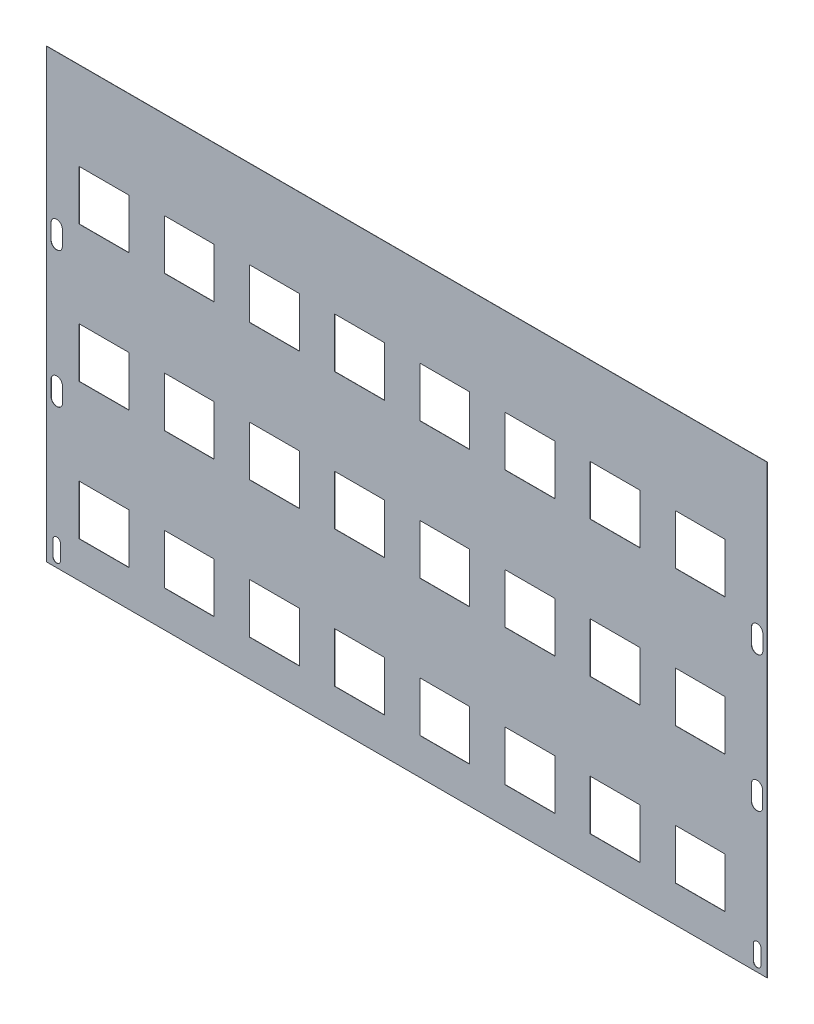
ISO-10303-21;
HEADER;
FILE_DESCRIPTION(('STEP AP214'),'2;1');
FILE_NAME('part.step','',(''),(''),'','','');
FILE_SCHEMA(('AUTOMOTIVE_DESIGN { 1 0 10303 214 1 1 1 1 }'));
ENDSEC;
DATA;
#1=APPLICATION_CONTEXT('core data for automotive mechanical design processes');
#2=APPLICATION_PROTOCOL_DEFINITION('international standard','automotive_design',2000,#1);
#3=PRODUCT_CONTEXT('',#1,'mechanical');
#4=PRODUCT('Part','Part','',(#3));
#5=PRODUCT_RELATED_PRODUCT_CATEGORY('part','',(#4));
#6=PRODUCT_DEFINITION_FORMATION('','',#4);
#7=PRODUCT_DEFINITION_CONTEXT('part definition',#1,'design');
#8=PRODUCT_DEFINITION('design','',#6,#7);
#9=PRODUCT_DEFINITION_SHAPE('','',#8);
#10=(LENGTH_UNIT() NAMED_UNIT(*) SI_UNIT(.MILLI.,.METRE.));
#11=(NAMED_UNIT(*) PLANE_ANGLE_UNIT() SI_UNIT($,.RADIAN.));
#12=(NAMED_UNIT(*) SI_UNIT($,.STERADIAN.) SOLID_ANGLE_UNIT());
#13=UNCERTAINTY_MEASURE_WITH_UNIT(LENGTH_MEASURE(1.E-05),#10,'distance_accuracy_value','');
#14=(GEOMETRIC_REPRESENTATION_CONTEXT(3) GLOBAL_UNCERTAINTY_ASSIGNED_CONTEXT((#13)) GLOBAL_UNIT_ASSIGNED_CONTEXT((#10,
#11,#12)) REPRESENTATION_CONTEXT('',''));
#15=CARTESIAN_POINT('',(0.,0.,0.));
#16=DIRECTION('',(0.,0.,1.));
#17=DIRECTION('',(1.,0.,0.));
#18=AXIS2_PLACEMENT_3D('',#15,#16,#17);
#19=CARTESIAN_POINT('',(0.,0.,-0.6));
#20=DIRECTION('',(0.,0.,1.));
#21=DIRECTION('',(1.,0.,0.));
#22=AXIS2_PLACEMENT_3D('',#19,#20,#21);
#23=PLANE('',#22);
#24=CARTESIAN_POINT('',(1812.00000000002,423.911611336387,-0.6));
#25=DIRECTION('',(0.,0.,1.));
#26=DIRECTION('',(1.,0.,0.));
#27=AXIS2_PLACEMENT_3D('',#24,#25,#26);
#28=CIRCLE('',#27,15.);
#29=CARTESIAN_POINT('',(1827.00000000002,423.911611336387,-0.6));
#30=VERTEX_POINT('',#29);
#31=CARTESIAN_POINT('',(1797.00000000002,423.911611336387,-0.6));
#32=VERTEX_POINT('',#31);
#33=EDGE_CURVE('E63',#30,#32,#28,.T.);
#34=ORIENTED_EDGE('',*,*,#33,.T.);
#35=DIRECTION('',(0.,-1.,0.));
#36=VECTOR('',#35,1.);
#37=CARTESIAN_POINT('',(1797.00000000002,423.911611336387,-0.6));
#38=LINE('',#37,#36);
#39=CARTESIAN_POINT('',(1797.00000000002,383.911611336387,-0.6));
#40=VERTEX_POINT('',#39);
#41=EDGE_CURVE('E841',#32,#40,#38,.T.);
#42=ORIENTED_EDGE('',*,*,#41,.T.);
#43=CARTESIAN_POINT('',(1812.00000000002,383.911611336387,-0.6));
#44=DIRECTION('',(0.,0.,1.));
#45=DIRECTION('',(1.,0.,0.));
#46=AXIS2_PLACEMENT_3D('',#43,#44,#45);
#47=CIRCLE('',#46,15.);
#48=CARTESIAN_POINT('',(1827.00000000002,383.911611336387,-0.6));
#49=VERTEX_POINT('',#48);
#50=EDGE_CURVE('E838',#40,#49,#47,.T.);
#51=ORIENTED_EDGE('',*,*,#50,.T.);
#52=DIRECTION('',(0.,1.,0.));
#53=VECTOR('',#52,1.);
#54=CARTESIAN_POINT('',(1827.00000000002,423.911611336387,-0.6));
#55=LINE('',#54,#53);
#56=EDGE_CURVE('E834',#49,#30,#55,.T.);
#57=ORIENTED_EDGE('',*,*,#56,.T.);
#58=EDGE_LOOP('',(#34,#42,#51,#57));
#59=FACE_BOUND('',#58,.T.);
#60=DIRECTION('',(-1.,0.,0.));
#61=VECTOR('',#60,1.);
#62=CARTESIAN_POINT('',(1870.,1180.,-0.6));
#63=LINE('',#62,#61);
#64=CARTESIAN_POINT('',(1839.,1180.,-0.600000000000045));
#65=VERTEX_POINT('',#64);
#66=CARTESIAN_POINT('',(-65.,1180.,-0.6));
#67=VERTEX_POINT('',#66);
#68=EDGE_CURVE('E1722',#65,#67,#63,.T.);
#69=ORIENTED_EDGE('',*,*,#68,.F.);
#70=DIRECTION('',(0.,-1.,0.));
#71=VECTOR('',#70,1.);
#72=CARTESIAN_POINT('',(1839.,4.44089209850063E-13,-0.6));
#73=LINE('',#72,#71);
#74=CARTESIAN_POINT('',(1839.,0.,-0.600000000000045));
#75=VERTEX_POINT('',#74);
#76=EDGE_CURVE('E937',#65,#75,#73,.T.);
#77=ORIENTED_EDGE('',*,*,#76,.T.);
#78=DIRECTION('',(1.,0.,0.));
#79=VECTOR('',#78,1.);
#80=CARTESIAN_POINT('',(0.,0.,-0.6));
#81=LINE('',#80,#79);
#82=CARTESIAN_POINT('',(-65.,0.,-0.6));
#83=VERTEX_POINT('',#82);
#84=EDGE_CURVE('E1724',#83,#75,#81,.T.);
#85=ORIENTED_EDGE('',*,*,#84,.F.);
#86=DIRECTION('',(0.,-1.,0.));
#87=VECTOR('',#86,1.);
#88=CARTESIAN_POINT('',(-65.,0.,-0.6));
#89=LINE('',#88,#87);
#90=EDGE_CURVE('E1710',#67,#83,#89,.T.);
#91=ORIENTED_EDGE('',*,*,#90,.F.);
#92=EDGE_LOOP('',(#69,#77,#85,#91));
#93=FACE_BOUND('',#92,.T.);
#94=DIRECTION('',(0.,1.,0.));
#95=VECTOR('',#94,1.);
#96=CARTESIAN_POINT('',(378.05073241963,0.,-0.6));
#97=LINE('',#96,#95);
#98=CARTESIAN_POINT('',(378.05073241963,815.911611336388,-0.6));
#99=VERTEX_POINT('',#98);
#100=CARTESIAN_POINT('',(378.05073241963,947.911611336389,-0.6));
#101=VERTEX_POINT('',#100);
#102=EDGE_CURVE('E1427',#99,#101,#97,.T.);
#103=ORIENTED_EDGE('',*,*,#102,.T.);
#104=DIRECTION('',(-1.,0.,0.));
#105=VECTOR('',#104,1.);
#106=CARTESIAN_POINT('',(0.,947.911611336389,-0.6));
#107=LINE('',#106,#105);
#108=CARTESIAN_POINT('',(246.05073241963,947.911611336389,-0.6));
#109=VERTEX_POINT('',#108);
#110=EDGE_CURVE('E1430',#101,#109,#107,.T.);
#111=ORIENTED_EDGE('',*,*,#110,.T.);
#112=DIRECTION('',(0.,-1.,0.));
#113=VECTOR('',#112,1.);
#114=CARTESIAN_POINT('',(246.05073241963,0.,-0.6));
#115=LINE('',#114,#113);
#116=CARTESIAN_POINT('',(246.05073241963,815.911611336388,-0.6));
#117=VERTEX_POINT('',#116);
#118=EDGE_CURVE('E1415',#109,#117,#115,.T.);
#119=ORIENTED_EDGE('',*,*,#118,.T.);
#120=DIRECTION('',(1.,0.,0.));
#121=VECTOR('',#120,1.);
#122=CARTESIAN_POINT('',(0.,815.911611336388,-0.6));
#123=LINE('',#122,#121);
#124=EDGE_CURVE('E1424',#117,#99,#123,.T.);
#125=ORIENTED_EDGE('',*,*,#124,.T.);
#126=EDGE_LOOP('',(#103,#111,#119,#125));
#127=FACE_BOUND('',#126,.T.);
#128=DIRECTION('',(0.,1.,0.));
#129=VECTOR('',#128,1.);
#130=CARTESIAN_POINT('',(1728.05073241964,0.,-0.6));
#131=LINE('',#130,#129);
#132=CARTESIAN_POINT('',(1728.05073241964,95.9116113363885,-0.6));
#133=VERTEX_POINT('',#132);
#134=CARTESIAN_POINT('',(1728.05073241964,227.911611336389,-0.6));
#135=VERTEX_POINT('',#134);
#136=EDGE_CURVE('E1439',#133,#135,#131,.T.);
#137=ORIENTED_EDGE('',*,*,#136,.T.);
#138=DIRECTION('',(-1.,0.,0.));
#139=VECTOR('',#138,1.);
#140=CARTESIAN_POINT('',(0.,227.911611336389,-0.6));
#141=LINE('',#140,#139);
#142=CARTESIAN_POINT('',(1596.05073241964,227.911611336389,-0.6));
#143=VERTEX_POINT('',#142);
#144=EDGE_CURVE('E1442',#135,#143,#141,.T.);
#145=ORIENTED_EDGE('',*,*,#144,.T.);
#146=DIRECTION('',(0.,-1.,0.));
#147=VECTOR('',#146,1.);
#148=CARTESIAN_POINT('',(1596.05073241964,0.,-0.6));
#149=LINE('',#148,#147);
#150=CARTESIAN_POINT('',(1596.05073241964,95.9116113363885,-0.6));
#151=VERTEX_POINT('',#150);
#152=EDGE_CURVE('E1433',#143,#151,#149,.T.);
#153=ORIENTED_EDGE('',*,*,#152,.T.);
#154=DIRECTION('',(1.,0.,0.));
#155=VECTOR('',#154,1.);
#156=CARTESIAN_POINT('',(0.,95.9116113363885,-0.6));
#157=LINE('',#156,#155);
#158=EDGE_CURVE('E1436',#151,#133,#157,.T.);
#159=ORIENTED_EDGE('',*,*,#158,.T.);
#160=EDGE_LOOP('',(#137,#145,#153,#159));
#161=FACE_BOUND('',#160,.T.);
#162=DIRECTION('',(0.,1.,0.));
#163=VECTOR('',#162,1.);
#164=CARTESIAN_POINT('',(1728.05073241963,0.,-0.6));
#165=LINE('',#164,#163);
#166=CARTESIAN_POINT('',(1728.05073241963,455.911611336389,-0.6));
#167=VERTEX_POINT('',#166);
#168=CARTESIAN_POINT('',(1728.05073241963,587.911611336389,-0.6));
#169=VERTEX_POINT('',#168);
#170=EDGE_CURVE('E1451',#167,#169,#165,.T.);
#171=ORIENTED_EDGE('',*,*,#170,.T.);
#172=DIRECTION('',(-1.,0.,0.));
#173=VECTOR('',#172,1.);
#174=CARTESIAN_POINT('',(0.,587.911611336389,-0.6));
#175=LINE('',#174,#173);
#176=CARTESIAN_POINT('',(1596.05073241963,587.911611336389,-0.6));
#177=VERTEX_POINT('',#176);
#178=EDGE_CURVE('E1454',#169,#177,#175,.T.);
#179=ORIENTED_EDGE('',*,*,#178,.T.);
#180=DIRECTION('',(0.,-1.,0.));
#181=VECTOR('',#180,1.);
#182=CARTESIAN_POINT('',(1596.05073241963,0.,-0.6));
#183=LINE('',#182,#181);
#184=CARTESIAN_POINT('',(1596.05073241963,455.911611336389,-0.6));
#185=VERTEX_POINT('',#184);
#186=EDGE_CURVE('E1445',#177,#185,#183,.T.);
#187=ORIENTED_EDGE('',*,*,#186,.T.);
#188=DIRECTION('',(1.,0.,0.));
#189=VECTOR('',#188,1.);
#190=CARTESIAN_POINT('',(0.,455.911611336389,-0.6));
#191=LINE('',#190,#189);
#192=EDGE_CURVE('E1448',#185,#167,#191,.T.);
#193=ORIENTED_EDGE('',*,*,#192,.T.);
#194=EDGE_LOOP('',(#171,#179,#187,#193));
#195=FACE_BOUND('',#194,.T.);
#196=DIRECTION('',(0.,1.,0.));
#197=VECTOR('',#196,1.);
#198=CARTESIAN_POINT('',(1728.05073241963,0.,-0.6));
#199=LINE('',#198,#197);
#200=CARTESIAN_POINT('',(1728.05073241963,815.911611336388,-0.6));
#201=VERTEX_POINT('',#200);
#202=CARTESIAN_POINT('',(1728.05073241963,947.911611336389,-0.6));
#203=VERTEX_POINT('',#202);
#204=EDGE_CURVE('E1463',#201,#203,#199,.T.);
#205=ORIENTED_EDGE('',*,*,#204,.T.);
#206=DIRECTION('',(-1.,0.,0.));
#207=VECTOR('',#206,1.);
#208=CARTESIAN_POINT('',(0.,947.911611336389,-0.6));
#209=LINE('',#208,#207);
#210=CARTESIAN_POINT('',(1596.05073241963,947.911611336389,-0.6));
#211=VERTEX_POINT('',#210);
#212=EDGE_CURVE('E1466',#203,#211,#209,.T.);
#213=ORIENTED_EDGE('',*,*,#212,.T.);
#214=DIRECTION('',(0.,-1.,0.));
#215=VECTOR('',#214,1.);
#216=CARTESIAN_POINT('',(1596.05073241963,0.,-0.6));
#217=LINE('',#216,#215);
#218=CARTESIAN_POINT('',(1596.05073241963,815.911611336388,-0.6));
#219=VERTEX_POINT('',#218);
#220=EDGE_CURVE('E1457',#211,#219,#217,.T.);
#221=ORIENTED_EDGE('',*,*,#220,.T.);
#222=DIRECTION('',(1.,0.,0.));
#223=VECTOR('',#222,1.);
#224=CARTESIAN_POINT('',(0.,815.911611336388,-0.6));
#225=LINE('',#224,#223);
#226=EDGE_CURVE('E1460',#219,#201,#225,.T.);
#227=ORIENTED_EDGE('',*,*,#226,.T.);
#228=EDGE_LOOP('',(#205,#213,#221,#227));
#229=FACE_BOUND('',#228,.T.);
#230=DIRECTION('',(0.,1.,0.));
#231=VECTOR('',#230,1.);
#232=CARTESIAN_POINT('',(153.050732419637,0.,-0.6));
#233=LINE('',#232,#231);
#234=CARTESIAN_POINT('',(153.050732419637,95.9116113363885,-0.6));
#235=VERTEX_POINT('',#234);
#236=CARTESIAN_POINT('',(153.050732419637,227.911611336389,-0.6));
#237=VERTEX_POINT('',#236);
#238=EDGE_CURVE('E1475',#235,#237,#233,.T.);
#239=ORIENTED_EDGE('',*,*,#238,.T.);
#240=DIRECTION('',(-1.,0.,0.));
#241=VECTOR('',#240,1.);
#242=CARTESIAN_POINT('',(0.,227.911611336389,-0.6));
#243=LINE('',#242,#241);
#244=CARTESIAN_POINT('',(21.0507324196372,227.911611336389,-0.6));
#245=VERTEX_POINT('',#244);
#246=EDGE_CURVE('E1478',#237,#245,#243,.T.);
#247=ORIENTED_EDGE('',*,*,#246,.T.);
#248=DIRECTION('',(0.,-1.,0.));
#249=VECTOR('',#248,1.);
#250=CARTESIAN_POINT('',(21.0507324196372,0.,-0.6));
#251=LINE('',#250,#249);
#252=CARTESIAN_POINT('',(21.0507324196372,95.9116113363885,-0.6));
#253=VERTEX_POINT('',#252);
#254=EDGE_CURVE('E1469',#245,#253,#251,.T.);
#255=ORIENTED_EDGE('',*,*,#254,.T.);
#256=DIRECTION('',(1.,0.,0.));
#257=VECTOR('',#256,1.);
#258=CARTESIAN_POINT('',(0.,95.9116113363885,-0.6));
#259=LINE('',#258,#257);
#260=EDGE_CURVE('E1472',#253,#235,#259,.T.);
#261=ORIENTED_EDGE('',*,*,#260,.T.);
#262=EDGE_LOOP('',(#239,#247,#255,#261));
#263=FACE_BOUND('',#262,.T.);
#264=DIRECTION('',(0.,1.,0.));
#265=VECTOR('',#264,1.);
#266=CARTESIAN_POINT('',(1503.05073241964,0.,-0.6));
#267=LINE('',#266,#265);
#268=CARTESIAN_POINT('',(1503.05073241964,95.9116113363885,-0.6));
#269=VERTEX_POINT('',#268);
#270=CARTESIAN_POINT('',(1503.05073241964,227.911611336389,-0.6));
#271=VERTEX_POINT('',#270);
#272=EDGE_CURVE('E1487',#269,#271,#267,.T.);
#273=ORIENTED_EDGE('',*,*,#272,.T.);
#274=DIRECTION('',(-1.,0.,0.));
#275=VECTOR('',#274,1.);
#276=CARTESIAN_POINT('',(0.,227.911611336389,-0.6));
#277=LINE('',#276,#275);
#278=CARTESIAN_POINT('',(1371.05073241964,227.911611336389,-0.6));
#279=VERTEX_POINT('',#278);
#280=EDGE_CURVE('E1490',#271,#279,#277,.T.);
#281=ORIENTED_EDGE('',*,*,#280,.T.);
#282=DIRECTION('',(0.,-1.,0.));
#283=VECTOR('',#282,1.);
#284=CARTESIAN_POINT('',(1371.05073241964,0.,-0.6));
#285=LINE('',#284,#283);
#286=CARTESIAN_POINT('',(1371.05073241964,95.9116113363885,-0.6));
#287=VERTEX_POINT('',#286);
#288=EDGE_CURVE('E1481',#279,#287,#285,.T.);
#289=ORIENTED_EDGE('',*,*,#288,.T.);
#290=DIRECTION('',(1.,0.,0.));
#291=VECTOR('',#290,1.);
#292=CARTESIAN_POINT('',(0.,95.9116113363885,-0.6));
#293=LINE('',#292,#291);
#294=EDGE_CURVE('E1484',#287,#269,#293,.T.);
#295=ORIENTED_EDGE('',*,*,#294,.T.);
#296=EDGE_LOOP('',(#273,#281,#289,#295));
#297=FACE_BOUND('',#296,.T.);
#298=DIRECTION('',(0.,1.,0.));
#299=VECTOR('',#298,1.);
#300=CARTESIAN_POINT('',(1503.05073241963,0.,-0.6));
#301=LINE('',#300,#299);
#302=CARTESIAN_POINT('',(1503.05073241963,455.911611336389,-0.6));
#303=VERTEX_POINT('',#302);
#304=CARTESIAN_POINT('',(1503.05073241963,587.911611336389,-0.6));
#305=VERTEX_POINT('',#304);
#306=EDGE_CURVE('E1499',#303,#305,#301,.T.);
#307=ORIENTED_EDGE('',*,*,#306,.T.);
#308=DIRECTION('',(-1.,0.,0.));
#309=VECTOR('',#308,1.);
#310=CARTESIAN_POINT('',(0.,587.911611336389,-0.6));
#311=LINE('',#310,#309);
#312=CARTESIAN_POINT('',(1371.05073241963,587.911611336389,-0.6));
#313=VERTEX_POINT('',#312);
#314=EDGE_CURVE('E1502',#305,#313,#311,.T.);
#315=ORIENTED_EDGE('',*,*,#314,.T.);
#316=DIRECTION('',(0.,-1.,0.));
#317=VECTOR('',#316,1.);
#318=CARTESIAN_POINT('',(1371.05073241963,0.,-0.6));
#319=LINE('',#318,#317);
#320=CARTESIAN_POINT('',(1371.05073241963,455.911611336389,-0.6));
#321=VERTEX_POINT('',#320);
#322=EDGE_CURVE('E1493',#313,#321,#319,.T.);
#323=ORIENTED_EDGE('',*,*,#322,.T.);
#324=DIRECTION('',(1.,0.,0.));
#325=VECTOR('',#324,1.);
#326=CARTESIAN_POINT('',(0.,455.911611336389,-0.6));
#327=LINE('',#326,#325);
#328=EDGE_CURVE('E1496',#321,#303,#327,.T.);
#329=ORIENTED_EDGE('',*,*,#328,.T.);
#330=EDGE_LOOP('',(#307,#315,#323,#329));
#331=FACE_BOUND('',#330,.T.);
#332=DIRECTION('',(0.,1.,0.));
#333=VECTOR('',#332,1.);
#334=CARTESIAN_POINT('',(1503.05073241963,0.,-0.6));
#335=LINE('',#334,#333);
#336=CARTESIAN_POINT('',(1503.05073241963,815.911611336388,-0.6));
#337=VERTEX_POINT('',#336);
#338=CARTESIAN_POINT('',(1503.05073241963,947.911611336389,-0.6));
#339=VERTEX_POINT('',#338);
#340=EDGE_CURVE('E1511',#337,#339,#335,.T.);
#341=ORIENTED_EDGE('',*,*,#340,.T.);
#342=DIRECTION('',(-1.,0.,0.));
#343=VECTOR('',#342,1.);
#344=CARTESIAN_POINT('',(0.,947.911611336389,-0.6));
#345=LINE('',#344,#343);
#346=CARTESIAN_POINT('',(1371.05073241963,947.911611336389,-0.6));
#347=VERTEX_POINT('',#346);
#348=EDGE_CURVE('E1514',#339,#347,#345,.T.);
#349=ORIENTED_EDGE('',*,*,#348,.T.);
#350=DIRECTION('',(0.,-1.,0.));
#351=VECTOR('',#350,1.);
#352=CARTESIAN_POINT('',(1371.05073241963,0.,-0.6));
#353=LINE('',#352,#351);
#354=CARTESIAN_POINT('',(1371.05073241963,815.911611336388,-0.6));
#355=VERTEX_POINT('',#354);
#356=EDGE_CURVE('E1505',#347,#355,#353,.T.);
#357=ORIENTED_EDGE('',*,*,#356,.T.);
#358=DIRECTION('',(1.,0.,0.));
#359=VECTOR('',#358,1.);
#360=CARTESIAN_POINT('',(0.,815.911611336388,-0.6));
#361=LINE('',#360,#359);
#362=EDGE_CURVE('E1508',#355,#337,#361,.T.);
#363=ORIENTED_EDGE('',*,*,#362,.T.);
#364=EDGE_LOOP('',(#341,#349,#357,#363));
#365=FACE_BOUND('',#364,.T.);
#366=DIRECTION('',(0.,1.,0.));
#367=VECTOR('',#366,1.);
#368=CARTESIAN_POINT('',(828.050732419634,0.,-0.6));
#369=LINE('',#368,#367);
#370=CARTESIAN_POINT('',(828.050732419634,455.911611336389,-0.6));
#371=VERTEX_POINT('',#370);
#372=CARTESIAN_POINT('',(828.050732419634,587.911611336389,-0.6));
#373=VERTEX_POINT('',#372);
#374=EDGE_CURVE('E1523',#371,#373,#369,.T.);
#375=ORIENTED_EDGE('',*,*,#374,.T.);
#376=DIRECTION('',(-1.,0.,0.));
#377=VECTOR('',#376,1.);
#378=CARTESIAN_POINT('',(0.,587.911611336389,-0.6));
#379=LINE('',#378,#377);
#380=CARTESIAN_POINT('',(696.050732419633,587.911611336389,-0.6));
#381=VERTEX_POINT('',#380);
#382=EDGE_CURVE('E1526',#373,#381,#379,.T.);
#383=ORIENTED_EDGE('',*,*,#382,.T.);
#384=DIRECTION('',(0.,-1.,0.));
#385=VECTOR('',#384,1.);
#386=CARTESIAN_POINT('',(696.050732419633,0.,-0.6));
#387=LINE('',#386,#385);
#388=CARTESIAN_POINT('',(696.050732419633,455.911611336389,-0.6));
#389=VERTEX_POINT('',#388);
#390=EDGE_CURVE('E1517',#381,#389,#387,.T.);
#391=ORIENTED_EDGE('',*,*,#390,.T.);
#392=DIRECTION('',(1.,0.,0.));
#393=VECTOR('',#392,1.);
#394=CARTESIAN_POINT('',(0.,455.911611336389,-0.6));
#395=LINE('',#394,#393);
#396=EDGE_CURVE('E1520',#389,#371,#395,.T.);
#397=ORIENTED_EDGE('',*,*,#396,.T.);
#398=EDGE_LOOP('',(#375,#383,#391,#397));
#399=FACE_BOUND('',#398,.T.);
#400=DIRECTION('',(0.,1.,0.));
#401=VECTOR('',#400,1.);
#402=CARTESIAN_POINT('',(828.05073241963,0.,-0.6));
#403=LINE('',#402,#401);
#404=CARTESIAN_POINT('',(828.05073241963,815.911611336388,-0.6));
#405=VERTEX_POINT('',#404);
#406=CARTESIAN_POINT('',(828.05073241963,947.911611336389,-0.6));
#407=VERTEX_POINT('',#406);
#408=EDGE_CURVE('E1535',#405,#407,#403,.T.);
#409=ORIENTED_EDGE('',*,*,#408,.T.);
#410=DIRECTION('',(-1.,0.,0.));
#411=VECTOR('',#410,1.);
#412=CARTESIAN_POINT('',(0.,947.911611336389,-0.6));
#413=LINE('',#412,#411);
#414=CARTESIAN_POINT('',(696.05073241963,947.911611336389,-0.6));
#415=VERTEX_POINT('',#414);
#416=EDGE_CURVE('E1538',#407,#415,#413,.T.);
#417=ORIENTED_EDGE('',*,*,#416,.T.);
#418=DIRECTION('',(0.,-1.,0.));
#419=VECTOR('',#418,1.);
#420=CARTESIAN_POINT('',(696.05073241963,0.,-0.6));
#421=LINE('',#420,#419);
#422=CARTESIAN_POINT('',(696.05073241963,815.911611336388,-0.6));
#423=VERTEX_POINT('',#422);
#424=EDGE_CURVE('E1529',#415,#423,#421,.T.);
#425=ORIENTED_EDGE('',*,*,#424,.T.);
#426=DIRECTION('',(1.,0.,0.));
#427=VECTOR('',#426,1.);
#428=CARTESIAN_POINT('',(0.,815.911611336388,-0.6));
#429=LINE('',#428,#427);
#430=EDGE_CURVE('E1532',#423,#405,#429,.T.);
#431=ORIENTED_EDGE('',*,*,#430,.T.);
#432=EDGE_LOOP('',(#409,#417,#425,#431));
#433=FACE_BOUND('',#432,.T.);
#434=DIRECTION('',(0.,1.,0.));
#435=VECTOR('',#434,1.);
#436=CARTESIAN_POINT('',(153.05073241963,0.,-0.6));
#437=LINE('',#436,#435);
#438=CARTESIAN_POINT('',(153.05073241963,815.911611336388,-0.6));
#439=VERTEX_POINT('',#438);
#440=CARTESIAN_POINT('',(153.05073241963,947.911611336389,-0.6));
#441=VERTEX_POINT('',#440);
#442=EDGE_CURVE('E1547',#439,#441,#437,.T.);
#443=ORIENTED_EDGE('',*,*,#442,.T.);
#444=DIRECTION('',(-1.,0.,0.));
#445=VECTOR('',#444,1.);
#446=CARTESIAN_POINT('',(0.,947.911611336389,-0.6));
#447=LINE('',#446,#445);
#448=CARTESIAN_POINT('',(21.0507324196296,947.911611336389,-0.6));
#449=VERTEX_POINT('',#448);
#450=EDGE_CURVE('E1550',#441,#449,#447,.T.);
#451=ORIENTED_EDGE('',*,*,#450,.T.);
#452=DIRECTION('',(0.,-1.,0.));
#453=VECTOR('',#452,1.);
#454=CARTESIAN_POINT('',(21.0507324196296,0.,-0.6));
#455=LINE('',#454,#453);
#456=CARTESIAN_POINT('',(21.0507324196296,815.911611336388,-0.6));
#457=VERTEX_POINT('',#456);
#458=EDGE_CURVE('E1541',#449,#457,#455,.T.);
#459=ORIENTED_EDGE('',*,*,#458,.T.);
#460=DIRECTION('',(1.,0.,0.));
#461=VECTOR('',#460,1.);
#462=CARTESIAN_POINT('',(0.,815.911611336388,-0.6));
#463=LINE('',#462,#461);
#464=EDGE_CURVE('E1544',#457,#439,#463,.T.);
#465=ORIENTED_EDGE('',*,*,#464,.T.);
#466=EDGE_LOOP('',(#443,#451,#459,#465));
#467=FACE_BOUND('',#466,.T.);
#468=DIRECTION('',(0.,1.,0.));
#469=VECTOR('',#468,1.);
#470=CARTESIAN_POINT('',(603.050732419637,0.,-0.6));
#471=LINE('',#470,#469);
#472=CARTESIAN_POINT('',(603.050732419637,95.9116113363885,-0.6));
#473=VERTEX_POINT('',#472);
#474=CARTESIAN_POINT('',(603.050732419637,227.911611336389,-0.6));
#475=VERTEX_POINT('',#474);
#476=EDGE_CURVE('E1559',#473,#475,#471,.T.);
#477=ORIENTED_EDGE('',*,*,#476,.T.);
#478=DIRECTION('',(-1.,0.,0.));
#479=VECTOR('',#478,1.);
#480=CARTESIAN_POINT('',(0.,227.911611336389,-0.6));
#481=LINE('',#480,#479);
#482=CARTESIAN_POINT('',(471.050732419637,227.911611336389,-0.6));
#483=VERTEX_POINT('',#482);
#484=EDGE_CURVE('E1562',#475,#483,#481,.T.);
#485=ORIENTED_EDGE('',*,*,#484,.T.);
#486=DIRECTION('',(0.,-1.,0.));
#487=VECTOR('',#486,1.);
#488=CARTESIAN_POINT('',(471.050732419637,0.,-0.6));
#489=LINE('',#488,#487);
#490=CARTESIAN_POINT('',(471.050732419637,95.9116113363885,-0.6));
#491=VERTEX_POINT('',#490);
#492=EDGE_CURVE('E1553',#483,#491,#489,.T.);
#493=ORIENTED_EDGE('',*,*,#492,.T.);
#494=DIRECTION('',(1.,0.,0.));
#495=VECTOR('',#494,1.);
#496=CARTESIAN_POINT('',(0.,95.9116113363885,-0.6));
#497=LINE('',#496,#495);
#498=EDGE_CURVE('E1556',#491,#473,#497,.T.);
#499=ORIENTED_EDGE('',*,*,#498,.T.);
#500=EDGE_LOOP('',(#477,#485,#493,#499));
#501=FACE_BOUND('',#500,.T.);
#502=DIRECTION('',(0.,1.,0.));
#503=VECTOR('',#502,1.);
#504=CARTESIAN_POINT('',(603.050732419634,0.,-0.6));
#505=LINE('',#504,#503);
#506=CARTESIAN_POINT('',(603.050732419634,455.911611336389,-0.6));
#507=VERTEX_POINT('',#506);
#508=CARTESIAN_POINT('',(603.050732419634,587.911611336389,-0.6));
#509=VERTEX_POINT('',#508);
#510=EDGE_CURVE('E1571',#507,#509,#505,.T.);
#511=ORIENTED_EDGE('',*,*,#510,.T.);
#512=DIRECTION('',(-1.,0.,0.));
#513=VECTOR('',#512,1.);
#514=CARTESIAN_POINT('',(0.,587.911611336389,-0.6));
#515=LINE('',#514,#513);
#516=CARTESIAN_POINT('',(471.050732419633,587.911611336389,-0.6));
#517=VERTEX_POINT('',#516);
#518=EDGE_CURVE('E1574',#509,#517,#515,.T.);
#519=ORIENTED_EDGE('',*,*,#518,.T.);
#520=DIRECTION('',(0.,-1.,0.));
#521=VECTOR('',#520,1.);
#522=CARTESIAN_POINT('',(471.050732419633,0.,-0.6));
#523=LINE('',#522,#521);
#524=CARTESIAN_POINT('',(471.050732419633,455.911611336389,-0.6));
#525=VERTEX_POINT('',#524);
#526=EDGE_CURVE('E1565',#517,#525,#523,.T.);
#527=ORIENTED_EDGE('',*,*,#526,.T.);
#528=DIRECTION('',(1.,0.,0.));
#529=VECTOR('',#528,1.);
#530=CARTESIAN_POINT('',(0.,455.911611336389,-0.6));
#531=LINE('',#530,#529);
#532=EDGE_CURVE('E1568',#525,#507,#531,.T.);
#533=ORIENTED_EDGE('',*,*,#532,.T.);
#534=EDGE_LOOP('',(#511,#519,#527,#533));
#535=FACE_BOUND('',#534,.T.);
#536=DIRECTION('',(0.,1.,0.));
#537=VECTOR('',#536,1.);
#538=CARTESIAN_POINT('',(603.05073241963,0.,-0.6));
#539=LINE('',#538,#537);
#540=CARTESIAN_POINT('',(603.05073241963,815.911611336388,-0.6));
#541=VERTEX_POINT('',#540);
#542=CARTESIAN_POINT('',(603.05073241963,947.911611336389,-0.6));
#543=VERTEX_POINT('',#542);
#544=EDGE_CURVE('E1583',#541,#543,#539,.T.);
#545=ORIENTED_EDGE('',*,*,#544,.T.);
#546=DIRECTION('',(-1.,0.,0.));
#547=VECTOR('',#546,1.);
#548=CARTESIAN_POINT('',(0.,947.911611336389,-0.6));
#549=LINE('',#548,#547);
#550=CARTESIAN_POINT('',(471.05073241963,947.911611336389,-0.6));
#551=VERTEX_POINT('',#550);
#552=EDGE_CURVE('E1586',#543,#551,#549,.T.);
#553=ORIENTED_EDGE('',*,*,#552,.T.);
#554=DIRECTION('',(0.,-1.,0.));
#555=VECTOR('',#554,1.);
#556=CARTESIAN_POINT('',(471.05073241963,0.,-0.6));
#557=LINE('',#556,#555);
#558=CARTESIAN_POINT('',(471.05073241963,815.911611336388,-0.6));
#559=VERTEX_POINT('',#558);
#560=EDGE_CURVE('E1577',#551,#559,#557,.T.);
#561=ORIENTED_EDGE('',*,*,#560,.T.);
#562=DIRECTION('',(1.,0.,0.));
#563=VECTOR('',#562,1.);
#564=CARTESIAN_POINT('',(0.,815.911611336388,-0.6));
#565=LINE('',#564,#563);
#566=EDGE_CURVE('E1580',#559,#541,#565,.T.);
#567=ORIENTED_EDGE('',*,*,#566,.T.);
#568=EDGE_LOOP('',(#545,#553,#561,#567));
#569=FACE_BOUND('',#568,.T.);
#570=DIRECTION('',(0.,1.,0.));
#571=VECTOR('',#570,1.);
#572=CARTESIAN_POINT('',(378.050732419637,0.,-0.6));
#573=LINE('',#572,#571);
#574=CARTESIAN_POINT('',(378.050732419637,95.9116113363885,-0.6));
#575=VERTEX_POINT('',#574);
#576=CARTESIAN_POINT('',(378.050732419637,227.911611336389,-0.6));
#577=VERTEX_POINT('',#576);
#578=EDGE_CURVE('E1595',#575,#577,#573,.T.);
#579=ORIENTED_EDGE('',*,*,#578,.T.);
#580=DIRECTION('',(-1.,0.,0.));
#581=VECTOR('',#580,1.);
#582=CARTESIAN_POINT('',(0.,227.911611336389,-0.6));
#583=LINE('',#582,#581);
#584=CARTESIAN_POINT('',(246.050732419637,227.911611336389,-0.6));
#585=VERTEX_POINT('',#584);
#586=EDGE_CURVE('E1598',#577,#585,#583,.T.);
#587=ORIENTED_EDGE('',*,*,#586,.T.);
#588=DIRECTION('',(0.,-1.,0.));
#589=VECTOR('',#588,1.);
#590=CARTESIAN_POINT('',(246.050732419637,0.,-0.6));
#591=LINE('',#590,#589);
#592=CARTESIAN_POINT('',(246.050732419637,95.9116113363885,-0.6));
#593=VERTEX_POINT('',#592);
#594=EDGE_CURVE('E1589',#585,#593,#591,.T.);
#595=ORIENTED_EDGE('',*,*,#594,.T.);
#596=DIRECTION('',(1.,0.,0.));
#597=VECTOR('',#596,1.);
#598=CARTESIAN_POINT('',(0.,95.9116113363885,-0.6));
#599=LINE('',#598,#597);
#600=EDGE_CURVE('E1592',#593,#575,#599,.T.);
#601=ORIENTED_EDGE('',*,*,#600,.T.);
#602=EDGE_LOOP('',(#579,#587,#595,#601));
#603=FACE_BOUND('',#602,.T.);
#604=DIRECTION('',(0.,1.,0.));
#605=VECTOR('',#604,1.);
#606=CARTESIAN_POINT('',(378.050732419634,0.,-0.6));
#607=LINE('',#606,#605);
#608=CARTESIAN_POINT('',(378.050732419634,455.911611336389,-0.6));
#609=VERTEX_POINT('',#608);
#610=CARTESIAN_POINT('',(378.050732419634,587.911611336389,-0.6));
#611=VERTEX_POINT('',#610);
#612=EDGE_CURVE('E1607',#609,#611,#607,.T.);
#613=ORIENTED_EDGE('',*,*,#612,.T.);
#614=DIRECTION('',(-1.,0.,0.));
#615=VECTOR('',#614,1.);
#616=CARTESIAN_POINT('',(0.,587.911611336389,-0.6));
#617=LINE('',#616,#615);
#618=CARTESIAN_POINT('',(246.050732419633,587.911611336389,-0.6));
#619=VERTEX_POINT('',#618);
#620=EDGE_CURVE('E1610',#611,#619,#617,.T.);
#621=ORIENTED_EDGE('',*,*,#620,.T.);
#622=DIRECTION('',(0.,-1.,0.));
#623=VECTOR('',#622,1.);
#624=CARTESIAN_POINT('',(246.050732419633,0.,-0.6));
#625=LINE('',#624,#623);
#626=CARTESIAN_POINT('',(246.050732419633,455.911611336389,-0.6));
#627=VERTEX_POINT('',#626);
#628=EDGE_CURVE('E1601',#619,#627,#625,.T.);
#629=ORIENTED_EDGE('',*,*,#628,.T.);
#630=DIRECTION('',(1.,0.,0.));
#631=VECTOR('',#630,1.);
#632=CARTESIAN_POINT('',(0.,455.911611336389,-0.6));
#633=LINE('',#632,#631);
#634=EDGE_CURVE('E1604',#627,#609,#633,.T.);
#635=ORIENTED_EDGE('',*,*,#634,.T.);
#636=EDGE_LOOP('',(#613,#621,#629,#635));
#637=FACE_BOUND('',#636,.T.);
#638=DIRECTION('',(0.,1.,0.));
#639=VECTOR('',#638,1.);
#640=CARTESIAN_POINT('',(153.050732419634,0.,-0.6));
#641=LINE('',#640,#639);
#642=CARTESIAN_POINT('',(153.050732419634,455.911611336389,-0.6));
#643=VERTEX_POINT('',#642);
#644=CARTESIAN_POINT('',(153.050732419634,587.911611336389,-0.6));
#645=VERTEX_POINT('',#644);
#646=EDGE_CURVE('E1619',#643,#645,#641,.T.);
#647=ORIENTED_EDGE('',*,*,#646,.T.);
#648=DIRECTION('',(-1.,0.,0.));
#649=VECTOR('',#648,1.);
#650=CARTESIAN_POINT('',(0.,587.911611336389,-0.6));
#651=LINE('',#650,#649);
#652=CARTESIAN_POINT('',(21.0507324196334,587.911611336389,-0.6));
#653=VERTEX_POINT('',#652);
#654=EDGE_CURVE('E1622',#645,#653,#651,.T.);
#655=ORIENTED_EDGE('',*,*,#654,.T.);
#656=DIRECTION('',(0.,-1.,0.));
#657=VECTOR('',#656,1.);
#658=CARTESIAN_POINT('',(21.0507324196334,0.,-0.6));
#659=LINE('',#658,#657);
#660=CARTESIAN_POINT('',(21.0507324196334,455.911611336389,-0.6));
#661=VERTEX_POINT('',#660);
#662=EDGE_CURVE('E1613',#653,#661,#659,.T.);
#663=ORIENTED_EDGE('',*,*,#662,.T.);
#664=DIRECTION('',(1.,0.,0.));
#665=VECTOR('',#664,1.);
#666=CARTESIAN_POINT('',(0.,455.911611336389,-0.6));
#667=LINE('',#666,#665);
#668=EDGE_CURVE('E1616',#661,#643,#667,.T.);
#669=ORIENTED_EDGE('',*,*,#668,.T.);
#670=EDGE_LOOP('',(#647,#655,#663,#669));
#671=FACE_BOUND('',#670,.T.);
#672=DIRECTION('',(0.,1.,0.));
#673=VECTOR('',#672,1.);
#674=CARTESIAN_POINT('',(1278.05073241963,0.,-0.6));
#675=LINE('',#674,#673);
#676=CARTESIAN_POINT('',(1278.05073241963,815.911611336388,-0.6));
#677=VERTEX_POINT('',#676);
#678=CARTESIAN_POINT('',(1278.05073241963,947.911611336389,-0.6));
#679=VERTEX_POINT('',#678);
#680=EDGE_CURVE('E1631',#677,#679,#675,.T.);
#681=ORIENTED_EDGE('',*,*,#680,.T.);
#682=DIRECTION('',(-1.,0.,0.));
#683=VECTOR('',#682,1.);
#684=CARTESIAN_POINT('',(0.,947.911611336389,-0.6));
#685=LINE('',#684,#683);
#686=CARTESIAN_POINT('',(1146.05073241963,947.911611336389,-0.6));
#687=VERTEX_POINT('',#686);
#688=EDGE_CURVE('E1634',#679,#687,#685,.T.);
#689=ORIENTED_EDGE('',*,*,#688,.T.);
#690=DIRECTION('',(0.,-1.,0.));
#691=VECTOR('',#690,1.);
#692=CARTESIAN_POINT('',(1146.05073241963,0.,-0.6));
#693=LINE('',#692,#691);
#694=CARTESIAN_POINT('',(1146.05073241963,815.911611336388,-0.6));
#695=VERTEX_POINT('',#694);
#696=EDGE_CURVE('E1625',#687,#695,#693,.T.);
#697=ORIENTED_EDGE('',*,*,#696,.T.);
#698=DIRECTION('',(1.,0.,0.));
#699=VECTOR('',#698,1.);
#700=CARTESIAN_POINT('',(0.,815.911611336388,-0.6));
#701=LINE('',#700,#699);
#702=EDGE_CURVE('E1628',#695,#677,#701,.T.);
#703=ORIENTED_EDGE('',*,*,#702,.T.);
#704=EDGE_LOOP('',(#681,#689,#697,#703));
#705=FACE_BOUND('',#704,.T.);
#706=DIRECTION('',(0.,1.,0.));
#707=VECTOR('',#706,1.);
#708=CARTESIAN_POINT('',(1278.05073241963,0.,-0.6));
#709=LINE('',#708,#707);
#710=CARTESIAN_POINT('',(1278.05073241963,455.911611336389,-0.6));
#711=VERTEX_POINT('',#710);
#712=CARTESIAN_POINT('',(1278.05073241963,587.911611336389,-0.6));
#713=VERTEX_POINT('',#712);
#714=EDGE_CURVE('E1643',#711,#713,#709,.T.);
#715=ORIENTED_EDGE('',*,*,#714,.T.);
#716=DIRECTION('',(-1.,0.,0.));
#717=VECTOR('',#716,1.);
#718=CARTESIAN_POINT('',(0.,587.911611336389,-0.6));
#719=LINE('',#718,#717);
#720=CARTESIAN_POINT('',(1146.05073241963,587.911611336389,-0.6));
#721=VERTEX_POINT('',#720);
#722=EDGE_CURVE('E1646',#713,#721,#719,.T.);
#723=ORIENTED_EDGE('',*,*,#722,.T.);
#724=DIRECTION('',(0.,-1.,0.));
#725=VECTOR('',#724,1.);
#726=CARTESIAN_POINT('',(1146.05073241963,0.,-0.6));
#727=LINE('',#726,#725);
#728=CARTESIAN_POINT('',(1146.05073241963,455.911611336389,-0.6));
#729=VERTEX_POINT('',#728);
#730=EDGE_CURVE('E1637',#721,#729,#727,.T.);
#731=ORIENTED_EDGE('',*,*,#730,.T.);
#732=DIRECTION('',(1.,0.,0.));
#733=VECTOR('',#732,1.);
#734=CARTESIAN_POINT('',(0.,455.911611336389,-0.6));
#735=LINE('',#734,#733);
#736=EDGE_CURVE('E1640',#729,#711,#735,.T.);
#737=ORIENTED_EDGE('',*,*,#736,.T.);
#738=EDGE_LOOP('',(#715,#723,#731,#737));
#739=FACE_BOUND('',#738,.T.);
#740=DIRECTION('',(0.,1.,0.));
#741=VECTOR('',#740,1.);
#742=CARTESIAN_POINT('',(1278.05073241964,0.,-0.6));
#743=LINE('',#742,#741);
#744=CARTESIAN_POINT('',(1278.05073241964,95.9116113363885,-0.6));
#745=VERTEX_POINT('',#744);
#746=CARTESIAN_POINT('',(1278.05073241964,227.911611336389,-0.6));
#747=VERTEX_POINT('',#746);
#748=EDGE_CURVE('E1655',#745,#747,#743,.T.);
#749=ORIENTED_EDGE('',*,*,#748,.T.);
#750=DIRECTION('',(-1.,0.,0.));
#751=VECTOR('',#750,1.);
#752=CARTESIAN_POINT('',(0.,227.911611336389,-0.6));
#753=LINE('',#752,#751);
#754=CARTESIAN_POINT('',(1146.05073241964,227.911611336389,-0.6));
#755=VERTEX_POINT('',#754);
#756=EDGE_CURVE('E1658',#747,#755,#753,.T.);
#757=ORIENTED_EDGE('',*,*,#756,.T.);
#758=DIRECTION('',(0.,-1.,0.));
#759=VECTOR('',#758,1.);
#760=CARTESIAN_POINT('',(1146.05073241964,0.,-0.6));
#761=LINE('',#760,#759);
#762=CARTESIAN_POINT('',(1146.05073241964,95.9116113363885,-0.6));
#763=VERTEX_POINT('',#762);
#764=EDGE_CURVE('E1649',#755,#763,#761,.T.);
#765=ORIENTED_EDGE('',*,*,#764,.T.);
#766=DIRECTION('',(1.,0.,0.));
#767=VECTOR('',#766,1.);
#768=CARTESIAN_POINT('',(0.,95.9116113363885,-0.6));
#769=LINE('',#768,#767);
#770=EDGE_CURVE('E1652',#763,#745,#769,.T.);
#771=ORIENTED_EDGE('',*,*,#770,.T.);
#772=EDGE_LOOP('',(#749,#757,#765,#771));
#773=FACE_BOUND('',#772,.T.);
#774=DIRECTION('',(0.,1.,0.));
#775=VECTOR('',#774,1.);
#776=CARTESIAN_POINT('',(828.050732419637,0.,-0.6));
#777=LINE('',#776,#775);
#778=CARTESIAN_POINT('',(828.050732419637,95.9116113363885,-0.6));
#779=VERTEX_POINT('',#778);
#780=CARTESIAN_POINT('',(828.050732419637,227.911611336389,-0.6));
#781=VERTEX_POINT('',#780);
#782=EDGE_CURVE('E1667',#779,#781,#777,.T.);
#783=ORIENTED_EDGE('',*,*,#782,.T.);
#784=DIRECTION('',(-1.,0.,0.));
#785=VECTOR('',#784,1.);
#786=CARTESIAN_POINT('',(0.,227.911611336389,-0.6));
#787=LINE('',#786,#785);
#788=CARTESIAN_POINT('',(696.050732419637,227.911611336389,-0.6));
#789=VERTEX_POINT('',#788);
#790=EDGE_CURVE('E1670',#781,#789,#787,.T.);
#791=ORIENTED_EDGE('',*,*,#790,.T.);
#792=DIRECTION('',(0.,-1.,0.));
#793=VECTOR('',#792,1.);
#794=CARTESIAN_POINT('',(696.050732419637,0.,-0.6));
#795=LINE('',#794,#793);
#796=CARTESIAN_POINT('',(696.050732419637,95.9116113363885,-0.6));
#797=VERTEX_POINT('',#796);
#798=EDGE_CURVE('E1661',#789,#797,#795,.T.);
#799=ORIENTED_EDGE('',*,*,#798,.T.);
#800=DIRECTION('',(1.,0.,0.));
#801=VECTOR('',#800,1.);
#802=CARTESIAN_POINT('',(0.,95.9116113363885,-0.6));
#803=LINE('',#802,#801);
#804=EDGE_CURVE('E1664',#797,#779,#803,.T.);
#805=ORIENTED_EDGE('',*,*,#804,.T.);
#806=EDGE_LOOP('',(#783,#791,#799,#805));
#807=FACE_BOUND('',#806,.T.);
#808=DIRECTION('',(0.,1.,0.));
#809=VECTOR('',#808,1.);
#810=CARTESIAN_POINT('',(1053.05073241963,0.,-0.6));
#811=LINE('',#810,#809);
#812=CARTESIAN_POINT('',(1053.05073241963,815.911611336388,-0.6));
#813=VERTEX_POINT('',#812);
#814=CARTESIAN_POINT('',(1053.05073241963,947.911611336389,-0.6));
#815=VERTEX_POINT('',#814);
#816=EDGE_CURVE('E1679',#813,#815,#811,.T.);
#817=ORIENTED_EDGE('',*,*,#816,.T.);
#818=DIRECTION('',(-1.,0.,0.));
#819=VECTOR('',#818,1.);
#820=CARTESIAN_POINT('',(0.,947.911611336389,-0.6));
#821=LINE('',#820,#819);
#822=CARTESIAN_POINT('',(921.05073241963,947.911611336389,-0.6));
#823=VERTEX_POINT('',#822);
#824=EDGE_CURVE('E1682',#815,#823,#821,.T.);
#825=ORIENTED_EDGE('',*,*,#824,.T.);
#826=DIRECTION('',(0.,-1.,0.));
#827=VECTOR('',#826,1.);
#828=CARTESIAN_POINT('',(921.05073241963,0.,-0.6));
#829=LINE('',#828,#827);
#830=CARTESIAN_POINT('',(921.05073241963,815.911611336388,-0.6));
#831=VERTEX_POINT('',#830);
#832=EDGE_CURVE('E1673',#823,#831,#829,.T.);
#833=ORIENTED_EDGE('',*,*,#832,.T.);
#834=DIRECTION('',(1.,0.,0.));
#835=VECTOR('',#834,1.);
#836=CARTESIAN_POINT('',(0.,815.911611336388,-0.6));
#837=LINE('',#836,#835);
#838=EDGE_CURVE('E1676',#831,#813,#837,.T.);
#839=ORIENTED_EDGE('',*,*,#838,.T.);
#840=EDGE_LOOP('',(#817,#825,#833,#839));
#841=FACE_BOUND('',#840,.T.);
#842=DIRECTION('',(0.,1.,0.));
#843=VECTOR('',#842,1.);
#844=CARTESIAN_POINT('',(1053.05073241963,0.,-0.6));
#845=LINE('',#844,#843);
#846=CARTESIAN_POINT('',(1053.05073241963,455.911611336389,-0.6));
#847=VERTEX_POINT('',#846);
#848=CARTESIAN_POINT('',(1053.05073241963,587.911611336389,-0.6));
#849=VERTEX_POINT('',#848);
#850=EDGE_CURVE('E1691',#847,#849,#845,.T.);
#851=ORIENTED_EDGE('',*,*,#850,.T.);
#852=DIRECTION('',(-1.,0.,0.));
#853=VECTOR('',#852,1.);
#854=CARTESIAN_POINT('',(0.,587.911611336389,-0.6));
#855=LINE('',#854,#853);
#856=CARTESIAN_POINT('',(921.050732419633,587.911611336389,-0.6));
#857=VERTEX_POINT('',#856);
#858=EDGE_CURVE('E1694',#849,#857,#855,.T.);
#859=ORIENTED_EDGE('',*,*,#858,.T.);
#860=DIRECTION('',(0.,-1.,0.));
#861=VECTOR('',#860,1.);
#862=CARTESIAN_POINT('',(921.050732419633,0.,-0.6));
#863=LINE('',#862,#861);
#864=CARTESIAN_POINT('',(921.050732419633,455.911611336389,-0.6));
#865=VERTEX_POINT('',#864);
#866=EDGE_CURVE('E1685',#857,#865,#863,.T.);
#867=ORIENTED_EDGE('',*,*,#866,.T.);
#868=DIRECTION('',(1.,0.,0.));
#869=VECTOR('',#868,1.);
#870=CARTESIAN_POINT('',(0.,455.911611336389,-0.6));
#871=LINE('',#870,#869);
#872=EDGE_CURVE('E1688',#865,#847,#871,.T.);
#873=ORIENTED_EDGE('',*,*,#872,.T.);
#874=EDGE_LOOP('',(#851,#859,#867,#873));
#875=FACE_BOUND('',#874,.T.);
#876=DIRECTION('',(0.,1.,0.));
#877=VECTOR('',#876,1.);
#878=CARTESIAN_POINT('',(1053.05073241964,0.,-0.6));
#879=LINE('',#878,#877);
#880=CARTESIAN_POINT('',(1053.05073241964,95.9116113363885,-0.6));
#881=VERTEX_POINT('',#880);
#882=CARTESIAN_POINT('',(1053.05073241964,227.911611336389,-0.6));
#883=VERTEX_POINT('',#882);
#884=EDGE_CURVE('E1703',#881,#883,#879,.T.);
#885=ORIENTED_EDGE('',*,*,#884,.T.);
#886=DIRECTION('',(-1.,0.,0.));
#887=VECTOR('',#886,1.);
#888=CARTESIAN_POINT('',(0.,227.911611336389,-0.6));
#889=LINE('',#888,#887);
#890=CARTESIAN_POINT('',(921.050732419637,227.911611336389,-0.6));
#891=VERTEX_POINT('',#890);
#892=EDGE_CURVE('E1706',#883,#891,#889,.T.);
#893=ORIENTED_EDGE('',*,*,#892,.T.);
#894=DIRECTION('',(0.,-1.,0.));
#895=VECTOR('',#894,1.);
#896=CARTESIAN_POINT('',(921.050732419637,0.,-0.6));
#897=LINE('',#896,#895);
#898=CARTESIAN_POINT('',(921.050732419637,95.9116113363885,-0.6));
#899=VERTEX_POINT('',#898);
#900=EDGE_CURVE('E1697',#891,#899,#897,.T.);
#901=ORIENTED_EDGE('',*,*,#900,.T.);
#902=DIRECTION('',(1.,0.,0.));
#903=VECTOR('',#902,1.);
#904=CARTESIAN_POINT('',(0.,95.9116113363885,-0.6));
#905=LINE('',#904,#903);
#906=EDGE_CURVE('E1700',#899,#881,#905,.T.);
#907=ORIENTED_EDGE('',*,*,#906,.T.);
#908=EDGE_LOOP('',(#885,#893,#901,#907));
#909=FACE_BOUND('',#908,.T.);
#910=DIRECTION('',(0.,-1.,0.));
#911=VECTOR('',#910,1.);
#912=CARTESIAN_POINT('',(-28.2604124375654,60.6389418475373,-0.6));
#913=LINE('',#912,#911);
#914=CARTESIAN_POINT('',(-28.2604124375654,60.6389418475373,-0.6));
#915=VERTEX_POINT('',#914);
#916=CARTESIAN_POINT('',(-28.2604124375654,20.6389418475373,-0.6));
#917=VERTEX_POINT('',#916);
#918=EDGE_CURVE('E915',#915,#917,#913,.T.);
#919=ORIENTED_EDGE('',*,*,#918,.F.);
#920=CARTESIAN_POINT('',(-38.2604124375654,60.6389418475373,-0.6));
#921=DIRECTION('',(0.,0.,-1.));
#922=DIRECTION('',(-1.,0.,0.));
#923=AXIS2_PLACEMENT_3D('',#920,#921,#922);
#924=CIRCLE('',#923,9.99999999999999);
#925=CARTESIAN_POINT('',(-48.2604124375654,60.6389418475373,-0.6));
#926=VERTEX_POINT('',#925);
#927=EDGE_CURVE('E830',#926,#915,#924,.T.);
#928=ORIENTED_EDGE('',*,*,#927,.F.);
#929=DIRECTION('',(0.,1.,0.));
#930=VECTOR('',#929,1.);
#931=CARTESIAN_POINT('',(-48.2604124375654,60.6389418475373,-0.6));
#932=LINE('',#931,#930);
#933=CARTESIAN_POINT('',(-48.2604124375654,20.6389418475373,-0.6));
#934=VERTEX_POINT('',#933);
#935=EDGE_CURVE('E921',#934,#926,#932,.T.);
#936=ORIENTED_EDGE('',*,*,#935,.F.);
#937=CARTESIAN_POINT('',(-38.2604124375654,20.6389418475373,-0.6));
#938=DIRECTION('',(0.,0.,-1.));
#939=DIRECTION('',(-1.,0.,0.));
#940=AXIS2_PLACEMENT_3D('',#937,#938,#939);
#941=CIRCLE('',#940,10.);
#942=EDGE_CURVE('E918',#917,#934,#941,.T.);
#943=ORIENTED_EDGE('',*,*,#942,.F.);
#944=EDGE_LOOP('',(#919,#928,#936,#943));
#945=FACE_BOUND('',#944,.T.);
#946=DIRECTION('',(0.,-1.,0.));
#947=VECTOR('',#946,1.);
#948=CARTESIAN_POINT('',(-23.0000000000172,423.911611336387,-0.6));
#949=LINE('',#948,#947);
#950=CARTESIAN_POINT('',(-23.0000000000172,423.911611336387,-0.6));
#951=VERTEX_POINT('',#950);
#952=CARTESIAN_POINT('',(-23.0000000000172,383.911611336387,-0.6));
#953=VERTEX_POINT('',#952);
#954=EDGE_CURVE('E896',#951,#953,#949,.T.);
#955=ORIENTED_EDGE('',*,*,#954,.F.);
#956=CARTESIAN_POINT('',(-38.0000000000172,423.911611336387,-0.6));
#957=DIRECTION('',(0.,0.,-1.));
#958=DIRECTION('',(-1.,0.,0.));
#959=AXIS2_PLACEMENT_3D('',#956,#957,#958);
#960=CIRCLE('',#959,15.);
#961=CARTESIAN_POINT('',(-53.0000000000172,423.911611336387,-0.6));
#962=VERTEX_POINT('',#961);
#963=EDGE_CURVE('E894',#962,#951,#960,.T.);
#964=ORIENTED_EDGE('',*,*,#963,.F.);
#965=DIRECTION('',(0.,1.,0.));
#966=VECTOR('',#965,1.);
#967=CARTESIAN_POINT('',(-53.0000000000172,423.911611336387,-0.6));
#968=LINE('',#967,#966);
#969=CARTESIAN_POINT('',(-53.0000000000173,383.911611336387,-0.6));
#970=VERTEX_POINT('',#969);
#971=EDGE_CURVE('E903',#970,#962,#968,.T.);
#972=ORIENTED_EDGE('',*,*,#971,.F.);
#973=CARTESIAN_POINT('',(-38.0000000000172,383.911611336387,-0.6));
#974=DIRECTION('',(0.,0.,-1.));
#975=DIRECTION('',(-1.,0.,0.));
#976=AXIS2_PLACEMENT_3D('',#973,#974,#975);
#977=CIRCLE('',#976,15.);
#978=EDGE_CURVE('E900',#953,#970,#977,.T.);
#979=ORIENTED_EDGE('',*,*,#978,.F.);
#980=EDGE_LOOP('',(#955,#964,#972,#979));
#981=FACE_BOUND('',#980,.T.);
#982=DIRECTION('',(0.,-1.,0.));
#983=VECTOR('',#982,1.);
#984=CARTESIAN_POINT('',(-23.2604124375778,782.115638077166,-0.6));
#985=LINE('',#984,#983);
#986=CARTESIAN_POINT('',(-23.2604124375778,782.115638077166,-0.6));
#987=VERTEX_POINT('',#986);
#988=CARTESIAN_POINT('',(-23.2604124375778,742.115638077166,-0.6));
#989=VERTEX_POINT('',#988);
#990=EDGE_CURVE('E874',#987,#989,#985,.T.);
#991=ORIENTED_EDGE('',*,*,#990,.F.);
#992=CARTESIAN_POINT('',(-38.2604124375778,782.115638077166,-0.6));
#993=DIRECTION('',(0.,0.,-1.));
#994=DIRECTION('',(-1.,0.,0.));
#995=AXIS2_PLACEMENT_3D('',#992,#993,#994);
#996=CIRCLE('',#995,15.);
#997=CARTESIAN_POINT('',(-53.2604124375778,782.115638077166,-0.6));
#998=VERTEX_POINT('',#997);
#999=EDGE_CURVE('E872',#998,#987,#996,.T.);
#1000=ORIENTED_EDGE('',*,*,#999,.F.);
#1001=DIRECTION('',(0.,1.,0.));
#1002=VECTOR('',#1001,1.);
#1003=CARTESIAN_POINT('',(-53.2604124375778,782.115638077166,-0.6));
#1004=LINE('',#1003,#1002);
#1005=CARTESIAN_POINT('',(-53.2604124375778,742.115638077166,-0.6));
#1006=VERTEX_POINT('',#1005);
#1007=EDGE_CURVE('E881',#1006,#998,#1004,.T.);
#1008=ORIENTED_EDGE('',*,*,#1007,.F.);
#1009=CARTESIAN_POINT('',(-38.2604124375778,742.115638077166,-0.6));
#1010=DIRECTION('',(0.,0.,-1.));
#1011=DIRECTION('',(-1.,0.,0.));
#1012=AXIS2_PLACEMENT_3D('',#1009,#1010,#1011);
#1013=CIRCLE('',#1012,15.);
#1014=EDGE_CURVE('E878',#989,#1006,#1013,.T.);
#1015=ORIENTED_EDGE('',*,*,#1014,.F.);
#1016=EDGE_LOOP('',(#991,#1000,#1008,#1015));
#1017=FACE_BOUND('',#1016,.T.);
#1018=CARTESIAN_POINT('',(1812.26041243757,60.6389418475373,-0.6));
#1019=DIRECTION('',(0.,0.,1.));
#1020=DIRECTION('',(1.,0.,0.));
#1021=AXIS2_PLACEMENT_3D('',#1018,#1019,#1020);
#1022=CIRCLE('',#1021,9.99999999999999);
#1023=CARTESIAN_POINT('',(1822.26041243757,60.6389418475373,-0.6));
#1024=VERTEX_POINT('',#1023);
#1025=CARTESIAN_POINT('',(1802.26041243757,60.6389418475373,-0.6));
#1026=VERTEX_POINT('',#1025);
#1027=EDGE_CURVE('E852',#1024,#1026,#1022,.T.);
#1028=ORIENTED_EDGE('',*,*,#1027,.T.);
#1029=DIRECTION('',(0.,-1.,0.));
#1030=VECTOR('',#1029,1.);
#1031=CARTESIAN_POINT('',(1802.26041243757,60.6389418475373,-0.6));
#1032=LINE('',#1031,#1030);
#1033=CARTESIAN_POINT('',(1802.26041243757,20.6389418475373,-0.6));
#1034=VERTEX_POINT('',#1033);
#1035=EDGE_CURVE('E861',#1026,#1034,#1032,.T.);
#1036=ORIENTED_EDGE('',*,*,#1035,.T.);
#1037=CARTESIAN_POINT('',(1812.26041243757,20.6389418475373,-0.6));
#1038=DIRECTION('',(0.,0.,1.));
#1039=DIRECTION('',(1.,0.,0.));
#1040=AXIS2_PLACEMENT_3D('',#1037,#1038,#1039);
#1041=CIRCLE('',#1040,10.);
#1042=CARTESIAN_POINT('',(1822.26041243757,20.6389418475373,-0.6));
#1043=VERTEX_POINT('',#1042);
#1044=EDGE_CURVE('E858',#1034,#1043,#1041,.T.);
#1045=ORIENTED_EDGE('',*,*,#1044,.T.);
#1046=DIRECTION('',(0.,1.,0.));
#1047=VECTOR('',#1046,1.);
#1048=CARTESIAN_POINT('',(1822.26041243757,60.6389418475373,-0.6));
#1049=LINE('',#1048,#1047);
#1050=EDGE_CURVE('E855',#1043,#1024,#1049,.T.);
#1051=ORIENTED_EDGE('',*,*,#1050,.T.);
#1052=EDGE_LOOP('',(#1028,#1036,#1045,#1051));
#1053=FACE_BOUND('',#1052,.T.);
#1054=CARTESIAN_POINT('',(1812.26041243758,782.115638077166,-0.6));
#1055=DIRECTION('',(0.,0.,1.));
#1056=DIRECTION('',(1.,0.,0.));
#1057=AXIS2_PLACEMENT_3D('',#1054,#1055,#1056);
#1058=CIRCLE('',#1057,15.);
#1059=CARTESIAN_POINT('',(1827.26041243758,782.115638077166,-0.6));
#1060=VERTEX_POINT('',#1059);
#1061=CARTESIAN_POINT('',(1797.26041243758,782.115638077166,-0.6));
#1062=VERTEX_POINT('',#1061);
#1063=EDGE_CURVE('E55',#1060,#1062,#1058,.T.);
#1064=ORIENTED_EDGE('',*,*,#1063,.T.);
#1065=DIRECTION('',(0.,-1.,0.));
#1066=VECTOR('',#1065,1.);
#1067=CARTESIAN_POINT('',(1797.26041243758,782.115638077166,-0.6));
#1068=LINE('',#1067,#1066);
#1069=CARTESIAN_POINT('',(1797.26041243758,742.115638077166,-0.6));
#1070=VERTEX_POINT('',#1069);
#1071=EDGE_CURVE('E823',#1062,#1070,#1068,.T.);
#1072=ORIENTED_EDGE('',*,*,#1071,.T.);
#1073=CARTESIAN_POINT('',(1812.26041243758,742.115638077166,-0.6));
#1074=DIRECTION('',(0.,0.,1.));
#1075=DIRECTION('',(1.,0.,0.));
#1076=AXIS2_PLACEMENT_3D('',#1073,#1074,#1075);
#1077=CIRCLE('',#1076,15.);
#1078=CARTESIAN_POINT('',(1827.26041243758,742.115638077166,-0.6));
#1079=VERTEX_POINT('',#1078);
#1080=EDGE_CURVE('E808',#1070,#1079,#1077,.T.);
#1081=ORIENTED_EDGE('',*,*,#1080,.T.);
#1082=DIRECTION('',(0.,1.,0.));
#1083=VECTOR('',#1082,1.);
#1084=CARTESIAN_POINT('',(1827.26041243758,782.115638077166,-0.6));
#1085=LINE('',#1084,#1083);
#1086=EDGE_CURVE('E818',#1079,#1060,#1085,.T.);
#1087=ORIENTED_EDGE('',*,*,#1086,.T.);
#1088=EDGE_LOOP('',(#1064,#1072,#1081,#1087));
#1089=FACE_BOUND('',#1088,.T.);
#1090=ADVANCED_FACE('F40',(#59,#93,#127,#161,#195,#229,#263,#297,#331,#365,#399,#433,#467,#501,
#535,#569,#603,#637,#671,#705,#739,#773,#807,#841,#875,#909,#945,#981,#1017,#1053,#1089),#23,.F.);
#1091=CARTESIAN_POINT('',(0.,0.,0.));
#1092=DIRECTION('',(0.,0.,1.));
#1093=DIRECTION('',(1.,0.,0.));
#1094=AXIS2_PLACEMENT_3D('',#1091,#1092,#1093);
#1095=PLANE('',#1094);
#1096=CARTESIAN_POINT('',(-38.2604124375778,782.115638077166,0.));
#1097=DIRECTION('',(0.,0.,1.));
#1098=DIRECTION('',(1.,0.,0.));
#1099=AXIS2_PLACEMENT_3D('',#1096,#1097,#1098);
#1100=CIRCLE('',#1099,15.);
#1101=CARTESIAN_POINT('',(-23.2604124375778,782.115638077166,0.));
#1102=VERTEX_POINT('',#1101);
#1103=CARTESIAN_POINT('',(-53.2604124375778,782.115638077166,0.));
#1104=VERTEX_POINT('',#1103);
#1105=EDGE_CURVE('E1756',#1102,#1104,#1100,.T.);
#1106=ORIENTED_EDGE('',*,*,#1105,.F.);
#1107=DIRECTION('',(0.,1.,0.));
#1108=VECTOR('',#1107,1.);
#1109=CARTESIAN_POINT('',(-23.2604124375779,0.,0.));
#1110=LINE('',#1109,#1108);
#1111=CARTESIAN_POINT('',(-23.2604124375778,742.115638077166,0.));
#1112=VERTEX_POINT('',#1111);
#1113=EDGE_CURVE('E1749',#1112,#1102,#1110,.T.);
#1114=ORIENTED_EDGE('',*,*,#1113,.F.);
#1115=CARTESIAN_POINT('',(-38.2604124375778,742.115638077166,0.));
#1116=DIRECTION('',(0.,0.,1.));
#1117=DIRECTION('',(1.,0.,0.));
#1118=AXIS2_PLACEMENT_3D('',#1115,#1116,#1117);
#1119=CIRCLE('',#1118,15.);
#1120=CARTESIAN_POINT('',(-53.2604124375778,742.115638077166,0.));
#1121=VERTEX_POINT('',#1120);
#1122=EDGE_CURVE('E1751',#1121,#1112,#1119,.T.);
#1123=ORIENTED_EDGE('',*,*,#1122,.F.);
#1124=DIRECTION('',(0.,-1.,0.));
#1125=VECTOR('',#1124,1.);
#1126=CARTESIAN_POINT('',(-53.260412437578,0.,0.));
#1127=LINE('',#1126,#1125);
#1128=EDGE_CURVE('E1754',#1104,#1121,#1127,.T.);
#1129=ORIENTED_EDGE('',*,*,#1128,.F.);
#1130=EDGE_LOOP('',(#1106,#1114,#1123,#1129));
#1131=FACE_BOUND('',#1130,.T.);
#1132=CARTESIAN_POINT('',(-38.0000000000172,423.911611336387,0.));
#1133=DIRECTION('',(0.,0.,1.));
#1134=DIRECTION('',(1.,0.,0.));
#1135=AXIS2_PLACEMENT_3D('',#1132,#1133,#1134);
#1136=CIRCLE('',#1135,15.);
#1137=CARTESIAN_POINT('',(-23.0000000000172,423.911611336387,0.));
#1138=VERTEX_POINT('',#1137);
#1139=CARTESIAN_POINT('',(-53.0000000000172,423.911611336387,0.));
#1140=VERTEX_POINT('',#1139);
#1141=EDGE_CURVE('E1747',#1138,#1140,#1136,.T.);
#1142=ORIENTED_EDGE('',*,*,#1141,.F.);
#1143=DIRECTION('',(0.,1.,0.));
#1144=VECTOR('',#1143,1.);
#1145=CARTESIAN_POINT('',(-23.0000000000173,0.,0.));
#1146=LINE('',#1145,#1144);
#1147=CARTESIAN_POINT('',(-23.0000000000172,383.911611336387,0.));
#1148=VERTEX_POINT('',#1147);
#1149=EDGE_CURVE('E1740',#1148,#1138,#1146,.T.);
#1150=ORIENTED_EDGE('',*,*,#1149,.F.);
#1151=CARTESIAN_POINT('',(-38.0000000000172,383.911611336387,0.));
#1152=DIRECTION('',(0.,0.,1.));
#1153=DIRECTION('',(1.,0.,0.));
#1154=AXIS2_PLACEMENT_3D('',#1151,#1152,#1153);
#1155=CIRCLE('',#1154,15.);
#1156=CARTESIAN_POINT('',(-53.0000000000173,383.911611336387,0.));
#1157=VERTEX_POINT('',#1156);
#1158=EDGE_CURVE('E1742',#1157,#1148,#1155,.T.);
#1159=ORIENTED_EDGE('',*,*,#1158,.F.);
#1160=DIRECTION('',(0.,-1.,0.));
#1161=VECTOR('',#1160,1.);
#1162=CARTESIAN_POINT('',(-53.0000000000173,0.,0.));
#1163=LINE('',#1162,#1161);
#1164=EDGE_CURVE('E1745',#1140,#1157,#1163,.T.);
#1165=ORIENTED_EDGE('',*,*,#1164,.F.);
#1166=EDGE_LOOP('',(#1142,#1150,#1159,#1165));
#1167=FACE_BOUND('',#1166,.T.);
#1168=CARTESIAN_POINT('',(-38.2604124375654,60.6389418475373,0.));
#1169=DIRECTION('',(0.,0.,1.));
#1170=DIRECTION('',(1.,0.,0.));
#1171=AXIS2_PLACEMENT_3D('',#1168,#1169,#1170);
#1172=CIRCLE('',#1171,9.99999999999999);
#1173=CARTESIAN_POINT('',(-28.2604124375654,60.6389418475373,0.));
#1174=VERTEX_POINT('',#1173);
#1175=CARTESIAN_POINT('',(-48.2604124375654,60.6389418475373,0.));
#1176=VERTEX_POINT('',#1175);
#1177=EDGE_CURVE('E1738',#1174,#1176,#1172,.T.);
#1178=ORIENTED_EDGE('',*,*,#1177,.F.);
#1179=DIRECTION('',(0.,1.,0.));
#1180=VECTOR('',#1179,1.);
#1181=CARTESIAN_POINT('',(-28.2604124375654,0.,0.));
#1182=LINE('',#1181,#1180);
#1183=CARTESIAN_POINT('',(-28.2604124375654,20.6389418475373,0.));
#1184=VERTEX_POINT('',#1183);
#1185=EDGE_CURVE('E1728',#1184,#1174,#1182,.T.);
#1186=ORIENTED_EDGE('',*,*,#1185,.F.);
#1187=CARTESIAN_POINT('',(-38.2604124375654,20.6389418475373,0.));
#1188=DIRECTION('',(0.,0.,1.));
#1189=DIRECTION('',(1.,0.,0.));
#1190=AXIS2_PLACEMENT_3D('',#1187,#1188,#1189);
#1191=CIRCLE('',#1190,10.);
#1192=CARTESIAN_POINT('',(-48.2604124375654,20.6389418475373,0.));
#1193=VERTEX_POINT('',#1192);
#1194=EDGE_CURVE('E1733',#1193,#1184,#1191,.T.);
#1195=ORIENTED_EDGE('',*,*,#1194,.F.);
#1196=DIRECTION('',(0.,-1.,0.));
#1197=VECTOR('',#1196,1.);
#1198=CARTESIAN_POINT('',(-48.2604124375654,0.,0.));
#1199=LINE('',#1198,#1197);
#1200=EDGE_CURVE('E1736',#1176,#1193,#1199,.T.);
#1201=ORIENTED_EDGE('',*,*,#1200,.F.);
#1202=EDGE_LOOP('',(#1178,#1186,#1195,#1201));
#1203=FACE_BOUND('',#1202,.T.);
#1204=DIRECTION('',(0.,-1.,0.));
#1205=VECTOR('',#1204,1.);
#1206=CARTESIAN_POINT('',(1839.,1180.,0.));
#1207=LINE('',#1206,#1205);
#1208=CARTESIAN_POINT('',(1839.,1180.,0.));
#1209=VERTEX_POINT('',#1208);
#1210=CARTESIAN_POINT('',(1839.,0.,0.));
#1211=VERTEX_POINT('',#1210);
#1212=EDGE_CURVE('E887',#1209,#1211,#1207,.T.);
#1213=ORIENTED_EDGE('',*,*,#1212,.F.);
#1214=DIRECTION('',(-1.,0.,0.));
#1215=VECTOR('',#1214,1.);
#1216=CARTESIAN_POINT('',(1870.,1180.,0.));
#1217=LINE('',#1216,#1215);
#1218=CARTESIAN_POINT('',(-65.,1180.,0.));
#1219=VERTEX_POINT('',#1218);
#1220=EDGE_CURVE('E1719',#1209,#1219,#1217,.T.);
#1221=ORIENTED_EDGE('',*,*,#1220,.T.);
#1222=DIRECTION('',(0.,-1.,0.));
#1223=VECTOR('',#1222,1.);
#1224=CARTESIAN_POINT('',(-65.,0.,0.));
#1225=LINE('',#1224,#1223);
#1226=CARTESIAN_POINT('',(-65.,0.,0.));
#1227=VERTEX_POINT('',#1226);
#1228=EDGE_CURVE('E1709',#1219,#1227,#1225,.T.);
#1229=ORIENTED_EDGE('',*,*,#1228,.T.);
#1230=DIRECTION('',(1.,0.,0.));
#1231=VECTOR('',#1230,1.);
#1232=CARTESIAN_POINT('',(0.,0.,0.));
#1233=LINE('',#1232,#1231);
#1234=EDGE_CURVE('E1725',#1227,#1211,#1233,.T.);
#1235=ORIENTED_EDGE('',*,*,#1234,.T.);
#1236=EDGE_LOOP('',(#1213,#1221,#1229,#1235));
#1237=FACE_BOUND('',#1236,.T.);
#1238=DIRECTION('',(-1.,0.,0.));
#1239=VECTOR('',#1238,1.);
#1240=CARTESIAN_POINT('',(1053.05073241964,227.911611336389,0.));
#1241=LINE('',#1240,#1239);
#1242=CARTESIAN_POINT('',(1053.05073241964,227.911611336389,0.));
#1243=VERTEX_POINT('',#1242);
#1244=CARTESIAN_POINT('',(921.050732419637,227.911611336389,0.));
#1245=VERTEX_POINT('',#1244);
#1246=EDGE_CURVE('E1137',#1243,#1245,#1241,.T.);
#1247=ORIENTED_EDGE('',*,*,#1246,.F.);
#1248=DIRECTION('',(0.,1.,0.));
#1249=VECTOR('',#1248,1.);
#1250=CARTESIAN_POINT('',(1053.05073241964,95.9116113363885,0.));
#1251=LINE('',#1250,#1249);
#1252=CARTESIAN_POINT('',(1053.05073241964,95.9116113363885,0.));
#1253=VERTEX_POINT('',#1252);
#1254=EDGE_CURVE('E1191',#1253,#1243,#1251,.T.);
#1255=ORIENTED_EDGE('',*,*,#1254,.F.);
#1256=DIRECTION('',(1.,0.,0.));
#1257=VECTOR('',#1256,1.);
#1258=CARTESIAN_POINT('',(921.050732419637,95.9116113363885,0.));
#1259=LINE('',#1258,#1257);
#1260=CARTESIAN_POINT('',(921.050732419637,95.9116113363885,0.));
#1261=VERTEX_POINT('',#1260);
#1262=EDGE_CURVE('E1188',#1261,#1253,#1259,.T.);
#1263=ORIENTED_EDGE('',*,*,#1262,.F.);
#1264=DIRECTION('',(0.,-1.,0.));
#1265=VECTOR('',#1264,1.);
#1266=CARTESIAN_POINT('',(921.050732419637,227.911611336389,0.));
#1267=LINE('',#1266,#1265);
#1268=EDGE_CURVE('E1185',#1245,#1261,#1267,.T.);
#1269=ORIENTED_EDGE('',*,*,#1268,.F.);
#1270=EDGE_LOOP('',(#1247,#1255,#1263,#1269));
#1271=FACE_BOUND('',#1270,.T.);
#1272=DIRECTION('',(-1.,0.,0.));
#1273=VECTOR('',#1272,1.);
#1274=CARTESIAN_POINT('',(1053.05073241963,587.911611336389,0.));
#1275=LINE('',#1274,#1273);
#1276=CARTESIAN_POINT('',(1053.05073241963,587.911611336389,0.));
#1277=VERTEX_POINT('',#1276);
#1278=CARTESIAN_POINT('',(921.050732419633,587.911611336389,0.));
#1279=VERTEX_POINT('',#1278);
#1280=EDGE_CURVE('E1162',#1277,#1279,#1275,.T.);
#1281=ORIENTED_EDGE('',*,*,#1280,.F.);
#1282=DIRECTION('',(0.,1.,0.));
#1283=VECTOR('',#1282,1.);
#1284=CARTESIAN_POINT('',(1053.05073241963,455.911611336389,0.));
#1285=LINE('',#1284,#1283);
#1286=CARTESIAN_POINT('',(1053.05073241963,455.911611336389,0.));
#1287=VERTEX_POINT('',#1286);
#1288=EDGE_CURVE('E1171',#1287,#1277,#1285,.T.);
#1289=ORIENTED_EDGE('',*,*,#1288,.F.);
#1290=DIRECTION('',(1.,0.,0.));
#1291=VECTOR('',#1290,1.);
#1292=CARTESIAN_POINT('',(921.050732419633,455.911611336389,0.));
#1293=LINE('',#1292,#1291);
#1294=CARTESIAN_POINT('',(921.050732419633,455.911611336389,0.));
#1295=VERTEX_POINT('',#1294);
#1296=EDGE_CURVE('E1168',#1295,#1287,#1293,.T.);
#1297=ORIENTED_EDGE('',*,*,#1296,.F.);
#1298=DIRECTION('',(0.,-1.,0.));
#1299=VECTOR('',#1298,1.);
#1300=CARTESIAN_POINT('',(921.050732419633,587.911611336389,0.));
#1301=LINE('',#1300,#1299);
#1302=EDGE_CURVE('E1164',#1279,#1295,#1301,.T.);
#1303=ORIENTED_EDGE('',*,*,#1302,.F.);
#1304=EDGE_LOOP('',(#1281,#1289,#1297,#1303));
#1305=FACE_BOUND('',#1304,.T.);
#1306=DIRECTION('',(-1.,0.,0.));
#1307=VECTOR('',#1306,1.);
#1308=CARTESIAN_POINT('',(1053.05073241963,947.911611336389,0.));
#1309=LINE('',#1308,#1307);
#1310=CARTESIAN_POINT('',(1053.05073241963,947.911611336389,0.));
#1311=VERTEX_POINT('',#1310);
#1312=CARTESIAN_POINT('',(921.05073241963,947.911611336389,0.));
#1313=VERTEX_POINT('',#1312);
#1314=EDGE_CURVE('E1177',#1311,#1313,#1309,.T.);
#1315=ORIENTED_EDGE('',*,*,#1314,.F.);
#1316=DIRECTION('',(0.,1.,0.));
#1317=VECTOR('',#1316,1.);
#1318=CARTESIAN_POINT('',(1053.05073241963,815.911611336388,0.));
#1319=LINE('',#1318,#1317);
#1320=CARTESIAN_POINT('',(1053.05073241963,815.911611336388,0.));
#1321=VERTEX_POINT('',#1320);
#1322=EDGE_CURVE('E1231',#1321,#1311,#1319,.T.);
#1323=ORIENTED_EDGE('',*,*,#1322,.F.);
#1324=DIRECTION('',(1.,0.,0.));
#1325=VECTOR('',#1324,1.);
#1326=CARTESIAN_POINT('',(921.05073241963,815.911611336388,0.));
#1327=LINE('',#1326,#1325);
#1328=CARTESIAN_POINT('',(921.05073241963,815.911611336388,0.));
#1329=VERTEX_POINT('',#1328);
#1330=EDGE_CURVE('E1228',#1329,#1321,#1327,.T.);
#1331=ORIENTED_EDGE('',*,*,#1330,.F.);
#1332=DIRECTION('',(0.,-1.,0.));
#1333=VECTOR('',#1332,1.);
#1334=CARTESIAN_POINT('',(921.05073241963,947.911611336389,0.));
#1335=LINE('',#1334,#1333);
#1336=EDGE_CURVE('E1225',#1313,#1329,#1335,.T.);
#1337=ORIENTED_EDGE('',*,*,#1336,.F.);
#1338=EDGE_LOOP('',(#1315,#1323,#1331,#1337));
#1339=FACE_BOUND('',#1338,.T.);
#1340=DIRECTION('',(-1.,0.,0.));
#1341=VECTOR('',#1340,1.);
#1342=CARTESIAN_POINT('',(828.050732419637,227.911611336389,0.));
#1343=LINE('',#1342,#1341);
#1344=CARTESIAN_POINT('',(828.050732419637,227.911611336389,0.));
#1345=VERTEX_POINT('',#1344);
#1346=CARTESIAN_POINT('',(696.050732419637,227.911611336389,0.));
#1347=VERTEX_POINT('',#1346);
#1348=EDGE_CURVE('E1202',#1345,#1347,#1343,.T.);
#1349=ORIENTED_EDGE('',*,*,#1348,.F.);
#1350=DIRECTION('',(0.,1.,0.));
#1351=VECTOR('',#1350,1.);
#1352=CARTESIAN_POINT('',(828.050732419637,95.9116113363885,0.));
#1353=LINE('',#1352,#1351);
#1354=CARTESIAN_POINT('',(828.050732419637,95.9116113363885,0.));
#1355=VERTEX_POINT('',#1354);
#1356=EDGE_CURVE('E1211',#1355,#1345,#1353,.T.);
#1357=ORIENTED_EDGE('',*,*,#1356,.F.);
#1358=DIRECTION('',(1.,0.,0.));
#1359=VECTOR('',#1358,1.);
#1360=CARTESIAN_POINT('',(696.050732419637,95.9116113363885,0.));
#1361=LINE('',#1360,#1359);
#1362=CARTESIAN_POINT('',(696.050732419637,95.9116113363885,0.));
#1363=VERTEX_POINT('',#1362);
#1364=EDGE_CURVE('E1208',#1363,#1355,#1361,.T.);
#1365=ORIENTED_EDGE('',*,*,#1364,.F.);
#1366=DIRECTION('',(0.,-1.,0.));
#1367=VECTOR('',#1366,1.);
#1368=CARTESIAN_POINT('',(696.050732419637,227.911611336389,0.));
#1369=LINE('',#1368,#1367);
#1370=EDGE_CURVE('E1204',#1347,#1363,#1369,.T.);
#1371=ORIENTED_EDGE('',*,*,#1370,.F.);
#1372=EDGE_LOOP('',(#1349,#1357,#1365,#1371));
#1373=FACE_BOUND('',#1372,.T.);
#1374=DIRECTION('',(-1.,0.,0.));
#1375=VECTOR('',#1374,1.);
#1376=CARTESIAN_POINT('',(1278.05073241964,227.911611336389,0.));
#1377=LINE('',#1376,#1375);
#1378=CARTESIAN_POINT('',(1278.05073241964,227.911611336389,0.));
#1379=VERTEX_POINT('',#1378);
#1380=CARTESIAN_POINT('',(1146.05073241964,227.911611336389,0.));
#1381=VERTEX_POINT('',#1380);
#1382=EDGE_CURVE('E957',#1379,#1381,#1377,.T.);
#1383=ORIENTED_EDGE('',*,*,#1382,.F.);
#1384=DIRECTION('',(0.,1.,0.));
#1385=VECTOR('',#1384,1.);
#1386=CARTESIAN_POINT('',(1278.05073241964,95.9116113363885,0.));
#1387=LINE('',#1386,#1385);
#1388=CARTESIAN_POINT('',(1278.05073241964,95.9116113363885,0.));
#1389=VERTEX_POINT('',#1388);
#1390=EDGE_CURVE('E1111',#1389,#1379,#1387,.T.);
#1391=ORIENTED_EDGE('',*,*,#1390,.F.);
#1392=DIRECTION('',(1.,0.,0.));
#1393=VECTOR('',#1392,1.);
#1394=CARTESIAN_POINT('',(1146.05073241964,95.9116113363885,0.));
#1395=LINE('',#1394,#1393);
#1396=CARTESIAN_POINT('',(1146.05073241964,95.9116113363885,0.));
#1397=VERTEX_POINT('',#1396);
#1398=EDGE_CURVE('E1108',#1397,#1389,#1395,.T.);
#1399=ORIENTED_EDGE('',*,*,#1398,.F.);
#1400=DIRECTION('',(0.,-1.,0.));
#1401=VECTOR('',#1400,1.);
#1402=CARTESIAN_POINT('',(1146.05073241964,227.911611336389,0.));
#1403=LINE('',#1402,#1401);
#1404=EDGE_CURVE('E1105',#1381,#1397,#1403,.T.);
#1405=ORIENTED_EDGE('',*,*,#1404,.F.);
#1406=EDGE_LOOP('',(#1383,#1391,#1399,#1405));
#1407=FACE_BOUND('',#1406,.T.);
#1408=DIRECTION('',(-1.,0.,0.));
#1409=VECTOR('',#1408,1.);
#1410=CARTESIAN_POINT('',(1278.05073241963,587.911611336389,0.));
#1411=LINE('',#1410,#1409);
#1412=CARTESIAN_POINT('',(1278.05073241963,587.911611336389,0.));
#1413=VERTEX_POINT('',#1412);
#1414=CARTESIAN_POINT('',(1146.05073241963,587.911611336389,0.));
#1415=VERTEX_POINT('',#1414);
#1416=EDGE_CURVE('E1082',#1413,#1415,#1411,.T.);
#1417=ORIENTED_EDGE('',*,*,#1416,.F.);
#1418=DIRECTION('',(0.,1.,0.));
#1419=VECTOR('',#1418,1.);
#1420=CARTESIAN_POINT('',(1278.05073241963,455.911611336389,0.));
#1421=LINE('',#1420,#1419);
#1422=CARTESIAN_POINT('',(1278.05073241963,455.911611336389,0.));
#1423=VERTEX_POINT('',#1422);
#1424=EDGE_CURVE('E1091',#1423,#1413,#1421,.T.);
#1425=ORIENTED_EDGE('',*,*,#1424,.F.);
#1426=DIRECTION('',(1.,0.,0.));
#1427=VECTOR('',#1426,1.);
#1428=CARTESIAN_POINT('',(1146.05073241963,455.911611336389,0.));
#1429=LINE('',#1428,#1427);
#1430=CARTESIAN_POINT('',(1146.05073241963,455.911611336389,0.));
#1431=VERTEX_POINT('',#1430);
#1432=EDGE_CURVE('E1088',#1431,#1423,#1429,.T.);
#1433=ORIENTED_EDGE('',*,*,#1432,.F.);
#1434=DIRECTION('',(0.,-1.,0.));
#1435=VECTOR('',#1434,1.);
#1436=CARTESIAN_POINT('',(1146.05073241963,587.911611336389,0.));
#1437=LINE('',#1436,#1435);
#1438=EDGE_CURVE('E1084',#1415,#1431,#1437,.T.);
#1439=ORIENTED_EDGE('',*,*,#1438,.F.);
#1440=EDGE_LOOP('',(#1417,#1425,#1433,#1439));
#1441=FACE_BOUND('',#1440,.T.);
#1442=DIRECTION('',(-1.,0.,0.));
#1443=VECTOR('',#1442,1.);
#1444=CARTESIAN_POINT('',(1278.05073241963,947.911611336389,0.));
#1445=LINE('',#1444,#1443);
#1446=CARTESIAN_POINT('',(1278.05073241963,947.911611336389,0.));
#1447=VERTEX_POINT('',#1446);
#1448=CARTESIAN_POINT('',(1146.05073241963,947.911611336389,0.));
#1449=VERTEX_POINT('',#1448);
#1450=EDGE_CURVE('E1097',#1447,#1449,#1445,.T.);
#1451=ORIENTED_EDGE('',*,*,#1450,.F.);
#1452=DIRECTION('',(0.,1.,0.));
#1453=VECTOR('',#1452,1.);
#1454=CARTESIAN_POINT('',(1278.05073241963,815.911611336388,0.));
#1455=LINE('',#1454,#1453);
#1456=CARTESIAN_POINT('',(1278.05073241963,815.911611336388,0.));
#1457=VERTEX_POINT('',#1456);
#1458=EDGE_CURVE('E1151',#1457,#1447,#1455,.T.);
#1459=ORIENTED_EDGE('',*,*,#1458,.F.);
#1460=DIRECTION('',(1.,0.,0.));
#1461=VECTOR('',#1460,1.);
#1462=CARTESIAN_POINT('',(1146.05073241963,815.911611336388,0.));
#1463=LINE('',#1462,#1461);
#1464=CARTESIAN_POINT('',(1146.05073241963,815.911611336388,0.));
#1465=VERTEX_POINT('',#1464);
#1466=EDGE_CURVE('E1148',#1465,#1457,#1463,.T.);
#1467=ORIENTED_EDGE('',*,*,#1466,.F.);
#1468=DIRECTION('',(0.,-1.,0.));
#1469=VECTOR('',#1468,1.);
#1470=CARTESIAN_POINT('',(1146.05073241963,947.911611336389,0.));
#1471=LINE('',#1470,#1469);
#1472=EDGE_CURVE('E1145',#1449,#1465,#1471,.T.);
#1473=ORIENTED_EDGE('',*,*,#1472,.F.);
#1474=EDGE_LOOP('',(#1451,#1459,#1467,#1473));
#1475=FACE_BOUND('',#1474,.T.);
#1476=DIRECTION('',(-1.,0.,0.));
#1477=VECTOR('',#1476,1.);
#1478=CARTESIAN_POINT('',(153.050732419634,587.911611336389,0.));
#1479=LINE('',#1478,#1477);
#1480=CARTESIAN_POINT('',(153.050732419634,587.911611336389,0.));
#1481=VERTEX_POINT('',#1480);
#1482=CARTESIAN_POINT('',(21.0507324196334,587.911611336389,0.));
#1483=VERTEX_POINT('',#1482);
#1484=EDGE_CURVE('E1122',#1481,#1483,#1479,.T.);
#1485=ORIENTED_EDGE('',*,*,#1484,.F.);
#1486=DIRECTION('',(0.,1.,0.));
#1487=VECTOR('',#1486,1.);
#1488=CARTESIAN_POINT('',(153.050732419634,455.911611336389,0.));
#1489=LINE('',#1488,#1487);
#1490=CARTESIAN_POINT('',(153.050732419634,455.911611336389,0.));
#1491=VERTEX_POINT('',#1490);
#1492=EDGE_CURVE('E1131',#1491,#1481,#1489,.T.);
#1493=ORIENTED_EDGE('',*,*,#1492,.F.);
#1494=DIRECTION('',(1.,0.,0.));
#1495=VECTOR('',#1494,1.);
#1496=CARTESIAN_POINT('',(21.0507324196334,455.911611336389,0.));
#1497=LINE('',#1496,#1495);
#1498=CARTESIAN_POINT('',(21.0507324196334,455.911611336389,0.));
#1499=VERTEX_POINT('',#1498);
#1500=EDGE_CURVE('E1128',#1499,#1491,#1497,.T.);
#1501=ORIENTED_EDGE('',*,*,#1500,.F.);
#1502=DIRECTION('',(0.,-1.,0.));
#1503=VECTOR('',#1502,1.);
#1504=CARTESIAN_POINT('',(21.0507324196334,587.911611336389,0.));
#1505=LINE('',#1504,#1503);
#1506=EDGE_CURVE('E1124',#1483,#1499,#1505,.T.);
#1507=ORIENTED_EDGE('',*,*,#1506,.F.);
#1508=EDGE_LOOP('',(#1485,#1493,#1501,#1507));
#1509=FACE_BOUND('',#1508,.T.);
#1510=DIRECTION('',(-1.,0.,0.));
#1511=VECTOR('',#1510,1.);
#1512=CARTESIAN_POINT('',(378.050732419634,587.911611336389,0.));
#1513=LINE('',#1512,#1511);
#1514=CARTESIAN_POINT('',(378.050732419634,587.911611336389,0.));
#1515=VERTEX_POINT('',#1514);
#1516=CARTESIAN_POINT('',(246.050732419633,587.911611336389,0.));
#1517=VERTEX_POINT('',#1516);
#1518=EDGE_CURVE('E1322',#1515,#1517,#1513,.T.);
#1519=ORIENTED_EDGE('',*,*,#1518,.F.);
#1520=DIRECTION('',(0.,1.,0.));
#1521=VECTOR('',#1520,1.);
#1522=CARTESIAN_POINT('',(378.050732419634,455.911611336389,0.));
#1523=LINE('',#1522,#1521);
#1524=CARTESIAN_POINT('',(378.050732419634,455.911611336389,0.));
#1525=VERTEX_POINT('',#1524);
#1526=EDGE_CURVE('E1331',#1525,#1515,#1523,.T.);
#1527=ORIENTED_EDGE('',*,*,#1526,.F.);
#1528=DIRECTION('',(1.,0.,0.));
#1529=VECTOR('',#1528,1.);
#1530=CARTESIAN_POINT('',(246.050732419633,455.911611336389,0.));
#1531=LINE('',#1530,#1529);
#1532=CARTESIAN_POINT('',(246.050732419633,455.911611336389,0.));
#1533=VERTEX_POINT('',#1532);
#1534=EDGE_CURVE('E1328',#1533,#1525,#1531,.T.);
#1535=ORIENTED_EDGE('',*,*,#1534,.F.);
#1536=DIRECTION('',(0.,-1.,0.));
#1537=VECTOR('',#1536,1.);
#1538=CARTESIAN_POINT('',(246.050732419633,587.911611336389,0.));
#1539=LINE('',#1538,#1537);
#1540=EDGE_CURVE('E1324',#1517,#1533,#1539,.T.);
#1541=ORIENTED_EDGE('',*,*,#1540,.F.);
#1542=EDGE_LOOP('',(#1519,#1527,#1535,#1541));
#1543=FACE_BOUND('',#1542,.T.);
#1544=DIRECTION('',(-1.,0.,0.));
#1545=VECTOR('',#1544,1.);
#1546=CARTESIAN_POINT('',(378.050732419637,227.911611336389,0.));
#1547=LINE('',#1546,#1545);
#1548=CARTESIAN_POINT('',(378.050732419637,227.911611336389,0.));
#1549=VERTEX_POINT('',#1548);
#1550=CARTESIAN_POINT('',(246.050732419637,227.911611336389,0.));
#1551=VERTEX_POINT('',#1550);
#1552=EDGE_CURVE('E1344',#1549,#1551,#1547,.T.);
#1553=ORIENTED_EDGE('',*,*,#1552,.F.);
#1554=DIRECTION('',(0.,1.,0.));
#1555=VECTOR('',#1554,1.);
#1556=CARTESIAN_POINT('',(378.050732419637,95.9116113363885,0.));
#1557=LINE('',#1556,#1555);
#1558=CARTESIAN_POINT('',(378.050732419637,95.9116113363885,0.));
#1559=VERTEX_POINT('',#1558);
#1560=EDGE_CURVE('E1353',#1559,#1549,#1557,.T.);
#1561=ORIENTED_EDGE('',*,*,#1560,.F.);
#1562=DIRECTION('',(1.,0.,0.));
#1563=VECTOR('',#1562,1.);
#1564=CARTESIAN_POINT('',(246.050732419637,95.9116113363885,0.));
#1565=LINE('',#1564,#1563);
#1566=CARTESIAN_POINT('',(246.050732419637,95.9116113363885,0.));
#1567=VERTEX_POINT('',#1566);
#1568=EDGE_CURVE('E1350',#1567,#1559,#1565,.T.);
#1569=ORIENTED_EDGE('',*,*,#1568,.F.);
#1570=DIRECTION('',(0.,-1.,0.));
#1571=VECTOR('',#1570,1.);
#1572=CARTESIAN_POINT('',(246.050732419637,227.911611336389,0.));
#1573=LINE('',#1572,#1571);
#1574=EDGE_CURVE('E1346',#1551,#1567,#1573,.T.);
#1575=ORIENTED_EDGE('',*,*,#1574,.F.);
#1576=EDGE_LOOP('',(#1553,#1561,#1569,#1575));
#1577=FACE_BOUND('',#1576,.T.);
#1578=DIRECTION('',(-1.,0.,0.));
#1579=VECTOR('',#1578,1.);
#1580=CARTESIAN_POINT('',(603.05073241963,947.911611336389,0.));
#1581=LINE('',#1580,#1579);
#1582=CARTESIAN_POINT('',(603.05073241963,947.911611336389,0.));
#1583=VERTEX_POINT('',#1582);
#1584=CARTESIAN_POINT('',(471.05073241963,947.911611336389,0.));
#1585=VERTEX_POINT('',#1584);
#1586=EDGE_CURVE('E1364',#1583,#1585,#1581,.T.);
#1587=ORIENTED_EDGE('',*,*,#1586,.F.);
#1588=DIRECTION('',(0.,1.,0.));
#1589=VECTOR('',#1588,1.);
#1590=CARTESIAN_POINT('',(603.05073241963,815.911611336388,0.));
#1591=LINE('',#1590,#1589);
#1592=CARTESIAN_POINT('',(603.05073241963,815.911611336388,0.));
#1593=VERTEX_POINT('',#1592);
#1594=EDGE_CURVE('E1373',#1593,#1583,#1591,.T.);
#1595=ORIENTED_EDGE('',*,*,#1594,.F.);
#1596=DIRECTION('',(1.,0.,0.));
#1597=VECTOR('',#1596,1.);
#1598=CARTESIAN_POINT('',(471.05073241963,815.911611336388,0.));
#1599=LINE('',#1598,#1597);
#1600=CARTESIAN_POINT('',(471.05073241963,815.911611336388,0.));
#1601=VERTEX_POINT('',#1600);
#1602=EDGE_CURVE('E1370',#1601,#1593,#1599,.T.);
#1603=ORIENTED_EDGE('',*,*,#1602,.F.);
#1604=DIRECTION('',(0.,-1.,0.));
#1605=VECTOR('',#1604,1.);
#1606=CARTESIAN_POINT('',(471.05073241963,947.911611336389,0.));
#1607=LINE('',#1606,#1605);
#1608=EDGE_CURVE('E1366',#1585,#1601,#1607,.T.);
#1609=ORIENTED_EDGE('',*,*,#1608,.F.);
#1610=EDGE_LOOP('',(#1587,#1595,#1603,#1609));
#1611=FACE_BOUND('',#1610,.T.);
#1612=DIRECTION('',(-1.,0.,0.));
#1613=VECTOR('',#1612,1.);
#1614=CARTESIAN_POINT('',(603.050732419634,587.911611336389,0.));
#1615=LINE('',#1614,#1613);
#1616=CARTESIAN_POINT('',(603.050732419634,587.911611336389,0.));
#1617=VERTEX_POINT('',#1616);
#1618=CARTESIAN_POINT('',(471.050732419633,587.911611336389,0.));
#1619=VERTEX_POINT('',#1618);
#1620=EDGE_CURVE('E1257',#1617,#1619,#1615,.T.);
#1621=ORIENTED_EDGE('',*,*,#1620,.F.);
#1622=DIRECTION('',(0.,1.,0.));
#1623=VECTOR('',#1622,1.);
#1624=CARTESIAN_POINT('',(603.050732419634,455.911611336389,0.));
#1625=LINE('',#1624,#1623);
#1626=CARTESIAN_POINT('',(603.050732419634,455.911611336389,0.));
#1627=VERTEX_POINT('',#1626);
#1628=EDGE_CURVE('E1391',#1627,#1617,#1625,.T.);
#1629=ORIENTED_EDGE('',*,*,#1628,.F.);
#1630=DIRECTION('',(1.,0.,0.));
#1631=VECTOR('',#1630,1.);
#1632=CARTESIAN_POINT('',(471.050732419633,455.911611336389,0.));
#1633=LINE('',#1632,#1631);
#1634=CARTESIAN_POINT('',(471.050732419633,455.911611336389,0.));
#1635=VERTEX_POINT('',#1634);
#1636=EDGE_CURVE('E1388',#1635,#1627,#1633,.T.);
#1637=ORIENTED_EDGE('',*,*,#1636,.F.);
#1638=DIRECTION('',(0.,-1.,0.));
#1639=VECTOR('',#1638,1.);
#1640=CARTESIAN_POINT('',(471.050732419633,587.911611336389,0.));
#1641=LINE('',#1640,#1639);
#1642=EDGE_CURVE('E1385',#1619,#1635,#1641,.T.);
#1643=ORIENTED_EDGE('',*,*,#1642,.F.);
#1644=EDGE_LOOP('',(#1621,#1629,#1637,#1643));
#1645=FACE_BOUND('',#1644,.T.);
#1646=DIRECTION('',(-1.,0.,0.));
#1647=VECTOR('',#1646,1.);
#1648=CARTESIAN_POINT('',(603.050732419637,227.911611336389,0.));
#1649=LINE('',#1648,#1647);
#1650=CARTESIAN_POINT('',(603.050732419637,227.911611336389,0.));
#1651=VERTEX_POINT('',#1650);
#1652=CARTESIAN_POINT('',(471.050732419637,227.911611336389,0.));
#1653=VERTEX_POINT('',#1652);
#1654=EDGE_CURVE('E1242',#1651,#1653,#1649,.T.);
#1655=ORIENTED_EDGE('',*,*,#1654,.F.);
#1656=DIRECTION('',(0.,1.,0.));
#1657=VECTOR('',#1656,1.);
#1658=CARTESIAN_POINT('',(603.050732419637,95.9116113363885,0.));
#1659=LINE('',#1658,#1657);
#1660=CARTESIAN_POINT('',(603.050732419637,95.9116113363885,0.));
#1661=VERTEX_POINT('',#1660);
#1662=EDGE_CURVE('E1251',#1661,#1651,#1659,.T.);
#1663=ORIENTED_EDGE('',*,*,#1662,.F.);
#1664=DIRECTION('',(1.,0.,0.));
#1665=VECTOR('',#1664,1.);
#1666=CARTESIAN_POINT('',(471.050732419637,95.9116113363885,0.));
#1667=LINE('',#1666,#1665);
#1668=CARTESIAN_POINT('',(471.050732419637,95.9116113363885,0.));
#1669=VERTEX_POINT('',#1668);
#1670=EDGE_CURVE('E1248',#1669,#1661,#1667,.T.);
#1671=ORIENTED_EDGE('',*,*,#1670,.F.);
#1672=DIRECTION('',(0.,-1.,0.));
#1673=VECTOR('',#1672,1.);
#1674=CARTESIAN_POINT('',(471.050732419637,227.911611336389,0.));
#1675=LINE('',#1674,#1673);
#1676=EDGE_CURVE('E1244',#1653,#1669,#1675,.T.);
#1677=ORIENTED_EDGE('',*,*,#1676,.F.);
#1678=EDGE_LOOP('',(#1655,#1663,#1671,#1677));
#1679=FACE_BOUND('',#1678,.T.);
#1680=DIRECTION('',(-1.,0.,0.));
#1681=VECTOR('',#1680,1.);
#1682=CARTESIAN_POINT('',(153.05073241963,947.911611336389,0.));
#1683=LINE('',#1682,#1681);
#1684=CARTESIAN_POINT('',(153.05073241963,947.911611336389,0.));
#1685=VERTEX_POINT('',#1684);
#1686=CARTESIAN_POINT('',(21.0507324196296,947.911611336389,0.));
#1687=VERTEX_POINT('',#1686);
#1688=EDGE_CURVE('E1264',#1685,#1687,#1683,.T.);
#1689=ORIENTED_EDGE('',*,*,#1688,.F.);
#1690=DIRECTION('',(0.,1.,0.));
#1691=VECTOR('',#1690,1.);
#1692=CARTESIAN_POINT('',(153.05073241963,815.911611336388,0.));
#1693=LINE('',#1692,#1691);
#1694=CARTESIAN_POINT('',(153.05073241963,815.911611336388,0.));
#1695=VERTEX_POINT('',#1694);
#1696=EDGE_CURVE('E1273',#1695,#1685,#1693,.T.);
#1697=ORIENTED_EDGE('',*,*,#1696,.F.);
#1698=DIRECTION('',(1.,0.,0.));
#1699=VECTOR('',#1698,1.);
#1700=CARTESIAN_POINT('',(21.0507324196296,815.911611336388,0.));
#1701=LINE('',#1700,#1699);
#1702=CARTESIAN_POINT('',(21.0507324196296,815.911611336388,0.));
#1703=VERTEX_POINT('',#1702);
#1704=EDGE_CURVE('E1270',#1703,#1695,#1701,.T.);
#1705=ORIENTED_EDGE('',*,*,#1704,.F.);
#1706=DIRECTION('',(0.,-1.,0.));
#1707=VECTOR('',#1706,1.);
#1708=CARTESIAN_POINT('',(21.0507324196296,947.911611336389,0.));
#1709=LINE('',#1708,#1707);
#1710=EDGE_CURVE('E1266',#1687,#1703,#1709,.T.);
#1711=ORIENTED_EDGE('',*,*,#1710,.F.);
#1712=EDGE_LOOP('',(#1689,#1697,#1705,#1711));
#1713=FACE_BOUND('',#1712,.T.);
#1714=DIRECTION('',(-1.,0.,0.));
#1715=VECTOR('',#1714,1.);
#1716=CARTESIAN_POINT('',(828.05073241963,947.911611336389,0.));
#1717=LINE('',#1716,#1715);
#1718=CARTESIAN_POINT('',(828.05073241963,947.911611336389,0.));
#1719=VERTEX_POINT('',#1718);
#1720=CARTESIAN_POINT('',(696.05073241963,947.911611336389,0.));
#1721=VERTEX_POINT('',#1720);
#1722=EDGE_CURVE('E1284',#1719,#1721,#1717,.T.);
#1723=ORIENTED_EDGE('',*,*,#1722,.F.);
#1724=DIRECTION('',(0.,1.,0.));
#1725=VECTOR('',#1724,1.);
#1726=CARTESIAN_POINT('',(828.05073241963,815.911611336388,0.));
#1727=LINE('',#1726,#1725);
#1728=CARTESIAN_POINT('',(828.05073241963,815.911611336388,0.));
#1729=VERTEX_POINT('',#1728);
#1730=EDGE_CURVE('E1293',#1729,#1719,#1727,.T.);
#1731=ORIENTED_EDGE('',*,*,#1730,.F.);
#1732=DIRECTION('',(1.,0.,0.));
#1733=VECTOR('',#1732,1.);
#1734=CARTESIAN_POINT('',(696.05073241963,815.911611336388,0.));
#1735=LINE('',#1734,#1733);
#1736=CARTESIAN_POINT('',(696.05073241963,815.911611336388,0.));
#1737=VERTEX_POINT('',#1736);
#1738=EDGE_CURVE('E1290',#1737,#1729,#1735,.T.);
#1739=ORIENTED_EDGE('',*,*,#1738,.F.);
#1740=DIRECTION('',(0.,-1.,0.));
#1741=VECTOR('',#1740,1.);
#1742=CARTESIAN_POINT('',(696.05073241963,947.911611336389,0.));
#1743=LINE('',#1742,#1741);
#1744=EDGE_CURVE('E1286',#1721,#1737,#1743,.T.);
#1745=ORIENTED_EDGE('',*,*,#1744,.F.);
#1746=EDGE_LOOP('',(#1723,#1731,#1739,#1745));
#1747=FACE_BOUND('',#1746,.T.);
#1748=DIRECTION('',(-1.,0.,0.));
#1749=VECTOR('',#1748,1.);
#1750=CARTESIAN_POINT('',(828.050732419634,587.911611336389,0.));
#1751=LINE('',#1750,#1749);
#1752=CARTESIAN_POINT('',(828.050732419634,587.911611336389,0.));
#1753=VERTEX_POINT('',#1752);
#1754=CARTESIAN_POINT('',(696.050732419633,587.911611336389,0.));
#1755=VERTEX_POINT('',#1754);
#1756=EDGE_CURVE('E1217',#1753,#1755,#1751,.T.);
#1757=ORIENTED_EDGE('',*,*,#1756,.F.);
#1758=DIRECTION('',(0.,1.,0.));
#1759=VECTOR('',#1758,1.);
#1760=CARTESIAN_POINT('',(828.050732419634,455.911611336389,0.));
#1761=LINE('',#1760,#1759);
#1762=CARTESIAN_POINT('',(828.050732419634,455.911611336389,0.));
#1763=VERTEX_POINT('',#1762);
#1764=EDGE_CURVE('E1311',#1763,#1753,#1761,.T.);
#1765=ORIENTED_EDGE('',*,*,#1764,.F.);
#1766=DIRECTION('',(1.,0.,0.));
#1767=VECTOR('',#1766,1.);
#1768=CARTESIAN_POINT('',(696.050732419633,455.911611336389,0.));
#1769=LINE('',#1768,#1767);
#1770=CARTESIAN_POINT('',(696.050732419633,455.911611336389,0.));
#1771=VERTEX_POINT('',#1770);
#1772=EDGE_CURVE('E1308',#1771,#1763,#1769,.T.);
#1773=ORIENTED_EDGE('',*,*,#1772,.F.);
#1774=DIRECTION('',(0.,-1.,0.));
#1775=VECTOR('',#1774,1.);
#1776=CARTESIAN_POINT('',(696.050732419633,587.911611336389,0.));
#1777=LINE('',#1776,#1775);
#1778=EDGE_CURVE('E1305',#1755,#1771,#1777,.T.);
#1779=ORIENTED_EDGE('',*,*,#1778,.F.);
#1780=EDGE_LOOP('',(#1757,#1765,#1773,#1779));
#1781=FACE_BOUND('',#1780,.T.);
#1782=DIRECTION('',(-1.,0.,0.));
#1783=VECTOR('',#1782,1.);
#1784=CARTESIAN_POINT('',(1503.05073241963,947.911611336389,0.));
#1785=LINE('',#1784,#1783);
#1786=CARTESIAN_POINT('',(1503.05073241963,947.911611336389,0.));
#1787=VERTEX_POINT('',#1786);
#1788=CARTESIAN_POINT('',(1371.05073241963,947.911611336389,0.));
#1789=VERTEX_POINT('',#1788);
#1790=EDGE_CURVE('E942',#1787,#1789,#1785,.T.);
#1791=ORIENTED_EDGE('',*,*,#1790,.F.);
#1792=DIRECTION('',(0.,1.,0.));
#1793=VECTOR('',#1792,1.);
#1794=CARTESIAN_POINT('',(1503.05073241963,815.911611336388,0.));
#1795=LINE('',#1794,#1793);
#1796=CARTESIAN_POINT('',(1503.05073241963,815.911611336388,0.));
#1797=VERTEX_POINT('',#1796);
#1798=EDGE_CURVE('E951',#1797,#1787,#1795,.T.);
#1799=ORIENTED_EDGE('',*,*,#1798,.F.);
#1800=DIRECTION('',(1.,0.,0.));
#1801=VECTOR('',#1800,1.);
#1802=CARTESIAN_POINT('',(1371.05073241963,815.911611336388,0.));
#1803=LINE('',#1802,#1801);
#1804=CARTESIAN_POINT('',(1371.05073241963,815.911611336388,0.));
#1805=VERTEX_POINT('',#1804);
#1806=EDGE_CURVE('E948',#1805,#1797,#1803,.T.);
#1807=ORIENTED_EDGE('',*,*,#1806,.F.);
#1808=DIRECTION('',(0.,-1.,0.));
#1809=VECTOR('',#1808,1.);
#1810=CARTESIAN_POINT('',(1371.05073241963,947.911611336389,0.));
#1811=LINE('',#1810,#1809);
#1812=EDGE_CURVE('E944',#1789,#1805,#1811,.T.);
#1813=ORIENTED_EDGE('',*,*,#1812,.F.);
#1814=EDGE_LOOP('',(#1791,#1799,#1807,#1813));
#1815=FACE_BOUND('',#1814,.T.);
#1816=DIRECTION('',(-1.,0.,0.));
#1817=VECTOR('',#1816,1.);
#1818=CARTESIAN_POINT('',(1503.05073241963,587.911611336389,0.));
#1819=LINE('',#1818,#1817);
#1820=CARTESIAN_POINT('',(1503.05073241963,587.911611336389,0.));
#1821=VERTEX_POINT('',#1820);
#1822=CARTESIAN_POINT('',(1371.05073241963,587.911611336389,0.));
#1823=VERTEX_POINT('',#1822);
#1824=EDGE_CURVE('E964',#1821,#1823,#1819,.T.);
#1825=ORIENTED_EDGE('',*,*,#1824,.F.);
#1826=DIRECTION('',(0.,1.,0.));
#1827=VECTOR('',#1826,1.);
#1828=CARTESIAN_POINT('',(1503.05073241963,455.911611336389,0.));
#1829=LINE('',#1828,#1827);
#1830=CARTESIAN_POINT('',(1503.05073241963,455.911611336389,0.));
#1831=VERTEX_POINT('',#1830);
#1832=EDGE_CURVE('E973',#1831,#1821,#1829,.T.);
#1833=ORIENTED_EDGE('',*,*,#1832,.F.);
#1834=DIRECTION('',(1.,0.,0.));
#1835=VECTOR('',#1834,1.);
#1836=CARTESIAN_POINT('',(1371.05073241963,455.911611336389,0.));
#1837=LINE('',#1836,#1835);
#1838=CARTESIAN_POINT('',(1371.05073241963,455.911611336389,0.));
#1839=VERTEX_POINT('',#1838);
#1840=EDGE_CURVE('E970',#1839,#1831,#1837,.T.);
#1841=ORIENTED_EDGE('',*,*,#1840,.F.);
#1842=DIRECTION('',(0.,-1.,0.));
#1843=VECTOR('',#1842,1.);
#1844=CARTESIAN_POINT('',(1371.05073241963,587.911611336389,0.));
#1845=LINE('',#1844,#1843);
#1846=EDGE_CURVE('E966',#1823,#1839,#1845,.T.);
#1847=ORIENTED_EDGE('',*,*,#1846,.F.);
#1848=EDGE_LOOP('',(#1825,#1833,#1841,#1847));
#1849=FACE_BOUND('',#1848,.T.);
#1850=DIRECTION('',(-1.,0.,0.));
#1851=VECTOR('',#1850,1.);
#1852=CARTESIAN_POINT('',(1503.05073241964,227.911611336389,0.));
#1853=LINE('',#1852,#1851);
#1854=CARTESIAN_POINT('',(1503.05073241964,227.911611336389,0.));
#1855=VERTEX_POINT('',#1854);
#1856=CARTESIAN_POINT('',(1371.05073241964,227.911611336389,0.));
#1857=VERTEX_POINT('',#1856);
#1858=EDGE_CURVE('E984',#1855,#1857,#1853,.T.);
#1859=ORIENTED_EDGE('',*,*,#1858,.F.);
#1860=DIRECTION('',(0.,1.,0.));
#1861=VECTOR('',#1860,1.);
#1862=CARTESIAN_POINT('',(1503.05073241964,95.9116113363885,0.));
#1863=LINE('',#1862,#1861);
#1864=CARTESIAN_POINT('',(1503.05073241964,95.9116113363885,0.));
#1865=VERTEX_POINT('',#1864);
#1866=EDGE_CURVE('E993',#1865,#1855,#1863,.T.);
#1867=ORIENTED_EDGE('',*,*,#1866,.F.);
#1868=DIRECTION('',(1.,0.,0.));
#1869=VECTOR('',#1868,1.);
#1870=CARTESIAN_POINT('',(1371.05073241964,95.9116113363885,0.));
#1871=LINE('',#1870,#1869);
#1872=CARTESIAN_POINT('',(1371.05073241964,95.9116113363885,0.));
#1873=VERTEX_POINT('',#1872);
#1874=EDGE_CURVE('E990',#1873,#1865,#1871,.T.);
#1875=ORIENTED_EDGE('',*,*,#1874,.F.);
#1876=DIRECTION('',(0.,-1.,0.));
#1877=VECTOR('',#1876,1.);
#1878=CARTESIAN_POINT('',(1371.05073241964,227.911611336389,0.));
#1879=LINE('',#1878,#1877);
#1880=EDGE_CURVE('E986',#1857,#1873,#1879,.T.);
#1881=ORIENTED_EDGE('',*,*,#1880,.F.);
#1882=EDGE_LOOP('',(#1859,#1867,#1875,#1881));
#1883=FACE_BOUND('',#1882,.T.);
#1884=DIRECTION('',(-1.,0.,0.));
#1885=VECTOR('',#1884,1.);
#1886=CARTESIAN_POINT('',(153.050732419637,227.911611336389,0.));
#1887=LINE('',#1886,#1885);
#1888=CARTESIAN_POINT('',(153.050732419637,227.911611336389,0.));
#1889=VERTEX_POINT('',#1888);
#1890=CARTESIAN_POINT('',(21.0507324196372,227.911611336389,0.));
#1891=VERTEX_POINT('',#1890);
#1892=EDGE_CURVE('E1004',#1889,#1891,#1887,.T.);
#1893=ORIENTED_EDGE('',*,*,#1892,.F.);
#1894=DIRECTION('',(0.,1.,0.));
#1895=VECTOR('',#1894,1.);
#1896=CARTESIAN_POINT('',(153.050732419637,95.9116113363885,0.));
#1897=LINE('',#1896,#1895);
#1898=CARTESIAN_POINT('',(153.050732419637,95.9116113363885,0.));
#1899=VERTEX_POINT('',#1898);
#1900=EDGE_CURVE('E1013',#1899,#1889,#1897,.T.);
#1901=ORIENTED_EDGE('',*,*,#1900,.F.);
#1902=DIRECTION('',(1.,0.,0.));
#1903=VECTOR('',#1902,1.);
#1904=CARTESIAN_POINT('',(21.0507324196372,95.9116113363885,0.));
#1905=LINE('',#1904,#1903);
#1906=CARTESIAN_POINT('',(21.0507324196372,95.9116113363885,0.));
#1907=VERTEX_POINT('',#1906);
#1908=EDGE_CURVE('E1010',#1907,#1899,#1905,.T.);
#1909=ORIENTED_EDGE('',*,*,#1908,.F.);
#1910=DIRECTION('',(0.,-1.,0.));
#1911=VECTOR('',#1910,1.);
#1912=CARTESIAN_POINT('',(21.0507324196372,227.911611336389,0.));
#1913=LINE('',#1912,#1911);
#1914=EDGE_CURVE('E1006',#1891,#1907,#1913,.T.);
#1915=ORIENTED_EDGE('',*,*,#1914,.F.);
#1916=EDGE_LOOP('',(#1893,#1901,#1909,#1915));
#1917=FACE_BOUND('',#1916,.T.);
#1918=DIRECTION('',(-1.,0.,0.));
#1919=VECTOR('',#1918,1.);
#1920=CARTESIAN_POINT('',(1728.05073241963,947.911611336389,0.));
#1921=LINE('',#1920,#1919);
#1922=CARTESIAN_POINT('',(1728.05073241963,947.911611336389,0.));
#1923=VERTEX_POINT('',#1922);
#1924=CARTESIAN_POINT('',(1596.05073241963,947.911611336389,0.));
#1925=VERTEX_POINT('',#1924);
#1926=EDGE_CURVE('E1024',#1923,#1925,#1921,.T.);
#1927=ORIENTED_EDGE('',*,*,#1926,.F.);
#1928=DIRECTION('',(0.,1.,0.));
#1929=VECTOR('',#1928,1.);
#1930=CARTESIAN_POINT('',(1728.05073241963,815.911611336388,0.));
#1931=LINE('',#1930,#1929);
#1932=CARTESIAN_POINT('',(1728.05073241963,815.911611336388,0.));
#1933=VERTEX_POINT('',#1932);
#1934=EDGE_CURVE('E1033',#1933,#1923,#1931,.T.);
#1935=ORIENTED_EDGE('',*,*,#1934,.F.);
#1936=DIRECTION('',(1.,0.,0.));
#1937=VECTOR('',#1936,1.);
#1938=CARTESIAN_POINT('',(1596.05073241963,815.911611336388,0.));
#1939=LINE('',#1938,#1937);
#1940=CARTESIAN_POINT('',(1596.05073241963,815.911611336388,0.));
#1941=VERTEX_POINT('',#1940);
#1942=EDGE_CURVE('E1030',#1941,#1933,#1939,.T.);
#1943=ORIENTED_EDGE('',*,*,#1942,.F.);
#1944=DIRECTION('',(0.,-1.,0.));
#1945=VECTOR('',#1944,1.);
#1946=CARTESIAN_POINT('',(1596.05073241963,947.911611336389,0.));
#1947=LINE('',#1946,#1945);
#1948=EDGE_CURVE('E1026',#1925,#1941,#1947,.T.);
#1949=ORIENTED_EDGE('',*,*,#1948,.F.);
#1950=EDGE_LOOP('',(#1927,#1935,#1943,#1949));
#1951=FACE_BOUND('',#1950,.T.);
#1952=DIRECTION('',(-1.,0.,0.));
#1953=VECTOR('',#1952,1.);
#1954=CARTESIAN_POINT('',(1728.05073241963,587.911611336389,0.));
#1955=LINE('',#1954,#1953);
#1956=CARTESIAN_POINT('',(1728.05073241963,587.911611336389,0.));
#1957=VERTEX_POINT('',#1956);
#1958=CARTESIAN_POINT('',(1596.05073241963,587.911611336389,0.));
#1959=VERTEX_POINT('',#1958);
#1960=EDGE_CURVE('E1044',#1957,#1959,#1955,.T.);
#1961=ORIENTED_EDGE('',*,*,#1960,.F.);
#1962=DIRECTION('',(0.,1.,0.));
#1963=VECTOR('',#1962,1.);
#1964=CARTESIAN_POINT('',(1728.05073241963,455.911611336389,0.));
#1965=LINE('',#1964,#1963);
#1966=CARTESIAN_POINT('',(1728.05073241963,455.911611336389,0.));
#1967=VERTEX_POINT('',#1966);
#1968=EDGE_CURVE('E1053',#1967,#1957,#1965,.T.);
#1969=ORIENTED_EDGE('',*,*,#1968,.F.);
#1970=DIRECTION('',(1.,0.,0.));
#1971=VECTOR('',#1970,1.);
#1972=CARTESIAN_POINT('',(1596.05073241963,455.911611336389,0.));
#1973=LINE('',#1972,#1971);
#1974=CARTESIAN_POINT('',(1596.05073241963,455.911611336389,0.));
#1975=VERTEX_POINT('',#1974);
#1976=EDGE_CURVE('E1050',#1975,#1967,#1973,.T.);
#1977=ORIENTED_EDGE('',*,*,#1976,.F.);
#1978=DIRECTION('',(0.,-1.,0.));
#1979=VECTOR('',#1978,1.);
#1980=CARTESIAN_POINT('',(1596.05073241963,587.911611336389,0.));
#1981=LINE('',#1980,#1979);
#1982=EDGE_CURVE('E1046',#1959,#1975,#1981,.T.);
#1983=ORIENTED_EDGE('',*,*,#1982,.F.);
#1984=EDGE_LOOP('',(#1961,#1969,#1977,#1983));
#1985=FACE_BOUND('',#1984,.T.);
#1986=DIRECTION('',(-1.,0.,0.));
#1987=VECTOR('',#1986,1.);
#1988=CARTESIAN_POINT('',(1728.05073241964,227.911611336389,0.));
#1989=LINE('',#1988,#1987);
#1990=CARTESIAN_POINT('',(1728.05073241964,227.911611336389,0.));
#1991=VERTEX_POINT('',#1990);
#1992=CARTESIAN_POINT('',(1596.05073241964,227.911611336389,0.));
#1993=VERTEX_POINT('',#1992);
#1994=EDGE_CURVE('E941',#1991,#1993,#1989,.T.);
#1995=ORIENTED_EDGE('',*,*,#1994,.F.);
#1996=DIRECTION('',(0.,1.,0.));
#1997=VECTOR('',#1996,1.);
#1998=CARTESIAN_POINT('',(1728.05073241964,95.9116113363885,0.));
#1999=LINE('',#1998,#1997);
#2000=CARTESIAN_POINT('',(1728.05073241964,95.9116113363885,0.));
#2001=VERTEX_POINT('',#2000);
#2002=EDGE_CURVE('E1071',#2001,#1991,#1999,.T.);
#2003=ORIENTED_EDGE('',*,*,#2002,.F.);
#2004=DIRECTION('',(1.,0.,0.));
#2005=VECTOR('',#2004,1.);
#2006=CARTESIAN_POINT('',(1596.05073241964,95.9116113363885,0.));
#2007=LINE('',#2006,#2005);
#2008=CARTESIAN_POINT('',(1596.05073241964,95.9116113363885,0.));
#2009=VERTEX_POINT('',#2008);
#2010=EDGE_CURVE('E1068',#2009,#2001,#2007,.T.);
#2011=ORIENTED_EDGE('',*,*,#2010,.F.);
#2012=DIRECTION('',(0.,-1.,0.));
#2013=VECTOR('',#2012,1.);
#2014=CARTESIAN_POINT('',(1596.05073241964,227.911611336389,0.));
#2015=LINE('',#2014,#2013);
#2016=EDGE_CURVE('E1065',#1993,#2009,#2015,.T.);
#2017=ORIENTED_EDGE('',*,*,#2016,.F.);
#2018=EDGE_LOOP('',(#1995,#2003,#2011,#2017));
#2019=FACE_BOUND('',#2018,.T.);
#2020=DIRECTION('',(-1.,0.,0.));
#2021=VECTOR('',#2020,1.);
#2022=CARTESIAN_POINT('',(378.05073241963,947.911611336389,0.));
#2023=LINE('',#2022,#2021);
#2024=CARTESIAN_POINT('',(378.05073241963,947.911611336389,0.));
#2025=VERTEX_POINT('',#2024);
#2026=CARTESIAN_POINT('',(246.05073241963,947.911611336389,0.));
#2027=VERTEX_POINT('',#2026);
#2028=EDGE_CURVE('E1337',#2025,#2027,#2023,.T.);
#2029=ORIENTED_EDGE('',*,*,#2028,.F.);
#2030=DIRECTION('',(0.,1.,0.));
#2031=VECTOR('',#2030,1.);
#2032=CARTESIAN_POINT('',(378.05073241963,815.911611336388,0.));
#2033=LINE('',#2032,#2031);
#2034=CARTESIAN_POINT('',(378.05073241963,815.911611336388,0.));
#2035=VERTEX_POINT('',#2034);
#2036=EDGE_CURVE('E1409',#2035,#2025,#2033,.T.);
#2037=ORIENTED_EDGE('',*,*,#2036,.F.);
#2038=DIRECTION('',(1.,0.,0.));
#2039=VECTOR('',#2038,1.);
#2040=CARTESIAN_POINT('',(246.05073241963,815.911611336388,0.));
#2041=LINE('',#2040,#2039);
#2042=CARTESIAN_POINT('',(246.05073241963,815.911611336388,0.));
#2043=VERTEX_POINT('',#2042);
#2044=EDGE_CURVE('E1406',#2043,#2035,#2041,.T.);
#2045=ORIENTED_EDGE('',*,*,#2044,.F.);
#2046=DIRECTION('',(0.,-1.,0.));
#2047=VECTOR('',#2046,1.);
#2048=CARTESIAN_POINT('',(246.05073241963,947.911611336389,0.));
#2049=LINE('',#2048,#2047);
#2050=EDGE_CURVE('E1403',#2027,#2043,#2049,.T.);
#2051=ORIENTED_EDGE('',*,*,#2050,.F.);
#2052=EDGE_LOOP('',(#2029,#2037,#2045,#2051));
#2053=FACE_BOUND('',#2052,.T.);
#2054=DIRECTION('',(0.,1.,0.));
#2055=VECTOR('',#2054,1.);
#2056=CARTESIAN_POINT('',(1802.26041243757,-1.56321172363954E-13,0.));
#2057=LINE('',#2056,#2055);
#2058=CARTESIAN_POINT('',(1802.26041243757,20.6389418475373,0.));
#2059=VERTEX_POINT('',#2058);
#2060=CARTESIAN_POINT('',(1802.26041243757,60.6389418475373,0.));
#2061=VERTEX_POINT('',#2060);
#2062=EDGE_CURVE('E1764',#2059,#2061,#2057,.T.);
#2063=ORIENTED_EDGE('',*,*,#2062,.T.);
#2064=CARTESIAN_POINT('',(1812.26041243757,60.6389418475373,0.));
#2065=DIRECTION('',(0.,0.,1.));
#2066=DIRECTION('',(1.,0.,0.));
#2067=AXIS2_PLACEMENT_3D('',#2064,#2065,#2066);
#2068=CIRCLE('',#2067,9.99999999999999);
#2069=CARTESIAN_POINT('',(1822.26041243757,60.6389418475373,0.));
#2070=VERTEX_POINT('',#2069);
#2071=EDGE_CURVE('E1767',#2061,#2070,#2068,.F.);
#2072=ORIENTED_EDGE('',*,*,#2071,.T.);
#2073=DIRECTION('',(0.,-1.,0.));
#2074=VECTOR('',#2073,1.);
#2075=CARTESIAN_POINT('',(1822.26041243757,6.32223583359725E-13,0.));
#2076=LINE('',#2075,#2074);
#2077=CARTESIAN_POINT('',(1822.26041243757,20.6389418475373,0.));
#2078=VERTEX_POINT('',#2077);
#2079=EDGE_CURVE('E1758',#2070,#2078,#2076,.T.);
#2080=ORIENTED_EDGE('',*,*,#2079,.T.);
#2081=CARTESIAN_POINT('',(1812.26041243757,20.6389418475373,0.));
#2082=DIRECTION('',(0.,0.,1.));
#2083=DIRECTION('',(1.,0.,0.));
#2084=AXIS2_PLACEMENT_3D('',#2081,#2082,#2083);
#2085=CIRCLE('',#2084,10.);
#2086=EDGE_CURVE('E1761',#2078,#2059,#2085,.F.);
#2087=ORIENTED_EDGE('',*,*,#2086,.T.);
#2088=EDGE_LOOP('',(#2063,#2072,#2080,#2087));
#2089=FACE_BOUND('',#2088,.T.);
#2090=DIRECTION('',(0.,1.,0.));
#2091=VECTOR('',#2090,1.);
#2092=CARTESIAN_POINT('',(1797.00000000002,1.55864904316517E-13,0.));
#2093=LINE('',#2092,#2091);
#2094=CARTESIAN_POINT('',(1797.00000000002,383.911611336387,0.));
#2095=VERTEX_POINT('',#2094);
#2096=CARTESIAN_POINT('',(1797.00000000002,423.911611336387,0.));
#2097=VERTEX_POINT('',#2096);
#2098=EDGE_CURVE('E1776',#2095,#2097,#2093,.T.);
#2099=ORIENTED_EDGE('',*,*,#2098,.T.);
#2100=CARTESIAN_POINT('',(1812.00000000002,423.911611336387,0.));
#2101=DIRECTION('',(0.,0.,1.));
#2102=DIRECTION('',(1.,0.,0.));
#2103=AXIS2_PLACEMENT_3D('',#2100,#2101,#2102);
#2104=CIRCLE('',#2103,15.);
#2105=CARTESIAN_POINT('',(1827.00000000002,423.911611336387,0.));
#2106=VERTEX_POINT('',#2105);
#2107=EDGE_CURVE('E1779',#2097,#2106,#2104,.F.);
#2108=ORIENTED_EDGE('',*,*,#2107,.T.);
#2109=DIRECTION('',(0.,-1.,0.));
#2110=VECTOR('',#2109,1.);
#2111=CARTESIAN_POINT('',(1827.00000000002,3.16933979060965E-13,0.));
#2112=LINE('',#2111,#2110);
#2113=CARTESIAN_POINT('',(1827.00000000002,383.911611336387,0.));
#2114=VERTEX_POINT('',#2113);
#2115=EDGE_CURVE('E1770',#2106,#2114,#2112,.T.);
#2116=ORIENTED_EDGE('',*,*,#2115,.T.);
#2117=CARTESIAN_POINT('',(1812.00000000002,383.911611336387,0.));
#2118=DIRECTION('',(0.,0.,1.));
#2119=DIRECTION('',(1.,0.,0.));
#2120=AXIS2_PLACEMENT_3D('',#2117,#2118,#2119);
#2121=CIRCLE('',#2120,15.);
#2122=EDGE_CURVE('E1773',#2114,#2095,#2121,.F.);
#2123=ORIENTED_EDGE('',*,*,#2122,.T.);
#2124=EDGE_LOOP('',(#2099,#2108,#2116,#2123));
#2125=FACE_BOUND('',#2124,.T.);
#2126=DIRECTION('',(0.,1.,0.));
#2127=VECTOR('',#2126,1.);
#2128=CARTESIAN_POINT('',(1797.26041243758,1.55887491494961E-13,0.));
#2129=LINE('',#2128,#2127);
#2130=CARTESIAN_POINT('',(1797.26041243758,742.115638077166,0.));
#2131=VERTEX_POINT('',#2130);
#2132=CARTESIAN_POINT('',(1797.26041243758,782.115638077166,0.));
#2133=VERTEX_POINT('',#2132);
#2134=EDGE_CURVE('E48',#2131,#2133,#2129,.T.);
#2135=ORIENTED_EDGE('',*,*,#2134,.T.);
#2136=CARTESIAN_POINT('',(1812.26041243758,782.115638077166,0.));
#2137=DIRECTION('',(0.,0.,1.));
#2138=DIRECTION('',(1.,0.,0.));
#2139=AXIS2_PLACEMENT_3D('',#2136,#2137,#2138);
#2140=CIRCLE('',#2139,15.);
#2141=CARTESIAN_POINT('',(1827.26041243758,782.115638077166,0.));
#2142=VERTEX_POINT('',#2141);
#2143=EDGE_CURVE('E11',#2133,#2142,#2140,.F.);
#2144=ORIENTED_EDGE('',*,*,#2143,.T.);
#2145=DIRECTION('',(0.,-1.,0.));
#2146=VECTOR('',#2145,1.);
#2147=CARTESIAN_POINT('',(1827.26041243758,3.16979153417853E-13,0.));
#2148=LINE('',#2147,#2146);
#2149=CARTESIAN_POINT('',(1827.26041243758,742.115638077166,0.));
#2150=VERTEX_POINT('',#2149);
#2151=EDGE_CURVE('E1782',#2142,#2150,#2148,.T.);
#2152=ORIENTED_EDGE('',*,*,#2151,.T.);
#2153=CARTESIAN_POINT('',(1812.26041243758,742.115638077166,0.));
#2154=DIRECTION('',(0.,0.,1.));
#2155=DIRECTION('',(1.,0.,0.));
#2156=AXIS2_PLACEMENT_3D('',#2153,#2154,#2155);
#2157=CIRCLE('',#2156,15.);
#2158=EDGE_CURVE('E811',#2150,#2131,#2157,.F.);
#2159=ORIENTED_EDGE('',*,*,#2158,.T.);
#2160=EDGE_LOOP('',(#2135,#2144,#2152,#2159));
#2161=FACE_BOUND('',#2160,.T.);
#2162=ADVANCED_FACE('F1786',(#1131,#1167,#1203,#1237,#1271,#1305,#1339,#1373,#1407,#1441,#1475,
#1509,#1543,#1577,#1611,#1645,#1679,#1713,#1747,#1781,#1815,#1849,#1883,#1917,#1951,#1985,#2019,
#2053,#2089,#2125,#2161),#1095,.T.);
#2163=CARTESIAN_POINT('',(1870.,1180.,-0.6));
#2164=DIRECTION('',(0.,1.,0.));
#2165=DIRECTION('',(0.,0.,1.));
#2166=AXIS2_PLACEMENT_3D('',#2163,#2164,#2165);
#2167=PLANE('',#2166);
#2168=DIRECTION('',(0.,0.,1.));
#2169=VECTOR('',#2168,1.);
#2170=CARTESIAN_POINT('',(1839.,1180.,-506.));
#2171=LINE('',#2170,#2169);
#2172=EDGE_CURVE('E933',#65,#1209,#2171,.T.);
#2173=ORIENTED_EDGE('',*,*,#2172,.F.);
#2174=ORIENTED_EDGE('',*,*,#68,.T.);
#2175=DIRECTION('',(0.,0.,1.));
#2176=VECTOR('',#2175,1.);
#2177=CARTESIAN_POINT('',(-65.,1180.,-0.6));
#2178=LINE('',#2177,#2176);
#2179=EDGE_CURVE('E1713',#67,#1219,#2178,.T.);
#2180=ORIENTED_EDGE('',*,*,#2179,.T.);
#2181=ORIENTED_EDGE('',*,*,#1220,.F.);
#2182=EDGE_LOOP('',(#2173,#2174,#2180,#2181));
#2183=FACE_BOUND('',#2182,.T.);
#2184=ADVANCED_FACE('F42',(#2183),#2167,.T.);
#2185=CARTESIAN_POINT('',(0.,0.,-0.6));
#2186=DIRECTION('',(0.,-1.,0.));
#2187=DIRECTION('',(0.,0.,-1.));
#2188=AXIS2_PLACEMENT_3D('',#2185,#2186,#2187);
#2189=PLANE('',#2188);
#2190=DIRECTION('',(0.,0.,1.));
#2191=VECTOR('',#2190,1.);
#2192=CARTESIAN_POINT('',(1839.,0.,-506.));
#2193=LINE('',#2192,#2191);
#2194=EDGE_CURVE('E934',#75,#1211,#2193,.T.);
#2195=ORIENTED_EDGE('',*,*,#2194,.T.);
#2196=ORIENTED_EDGE('',*,*,#1234,.F.);
#2197=DIRECTION('',(0.,0.,1.));
#2198=VECTOR('',#2197,1.);
#2199=CARTESIAN_POINT('',(-65.,0.,-0.6));
#2200=LINE('',#2199,#2198);
#2201=EDGE_CURVE('E1716',#83,#1227,#2200,.T.);
#2202=ORIENTED_EDGE('',*,*,#2201,.F.);
#2203=ORIENTED_EDGE('',*,*,#84,.T.);
#2204=EDGE_LOOP('',(#2195,#2196,#2202,#2203));
#2205=FACE_BOUND('',#2204,.T.);
#2206=ADVANCED_FACE('F1817',(#2205),#2189,.T.);
#2207=CARTESIAN_POINT('',(-65.,0.,-0.6));
#2208=DIRECTION('',(-1.,0.,0.));
#2209=DIRECTION('',(0.,0.,1.));
#2210=AXIS2_PLACEMENT_3D('',#2207,#2208,#2209);
#2211=PLANE('',#2210);
#2212=ORIENTED_EDGE('',*,*,#1228,.F.);
#2213=ORIENTED_EDGE('',*,*,#2179,.F.);
#2214=ORIENTED_EDGE('',*,*,#90,.T.);
#2215=ORIENTED_EDGE('',*,*,#2201,.T.);
#2216=EDGE_LOOP('',(#2212,#2213,#2214,#2215));
#2217=FACE_BOUND('',#2216,.T.);
#2218=ADVANCED_FACE('F1815',(#2217),#2211,.T.);
#2219=CARTESIAN_POINT('',(378.05073241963,947.911611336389,-10.));
#2220=DIRECTION('',(0.,1.,0.));
#2221=DIRECTION('',(0.,0.,1.));
#2222=AXIS2_PLACEMENT_3D('',#2219,#2220,#2221);
#2223=PLANE('',#2222);
#2224=DIRECTION('',(0.,0.,1.));
#2225=VECTOR('',#2224,1.);
#2226=CARTESIAN_POINT('',(378.05073241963,947.911611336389,-10.));
#2227=LINE('',#2226,#2225);
#2228=EDGE_CURVE('E1413',#101,#2025,#2227,.T.);
#2229=ORIENTED_EDGE('',*,*,#2228,.T.);
#2230=ORIENTED_EDGE('',*,*,#2028,.T.);
#2231=DIRECTION('',(0.,0.,1.));
#2232=VECTOR('',#2231,1.);
#2233=CARTESIAN_POINT('',(246.05073241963,947.911611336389,-10.));
#2234=LINE('',#2233,#2232);
#2235=EDGE_CURVE('E1412',#109,#2027,#2234,.T.);
#2236=ORIENTED_EDGE('',*,*,#2235,.F.);
#2237=ORIENTED_EDGE('',*,*,#110,.F.);
#2238=EDGE_LOOP('',(#2229,#2230,#2236,#2237));
#2239=FACE_BOUND('',#2238,.T.);
#2240=ADVANCED_FACE('F1824',(#2239),#2223,.F.);
#2241=CARTESIAN_POINT('',(378.05073241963,815.911611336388,-10.));
#2242=DIRECTION('',(1.,0.,0.));
#2243=DIRECTION('',(0.,0.,-1.));
#2244=AXIS2_PLACEMENT_3D('',#2241,#2242,#2243);
#2245=PLANE('',#2244);
#2246=DIRECTION('',(0.,0.,1.));
#2247=VECTOR('',#2246,1.);
#2248=CARTESIAN_POINT('',(378.05073241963,815.911611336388,-10.));
#2249=LINE('',#2248,#2247);
#2250=EDGE_CURVE('E1416',#99,#2035,#2249,.T.);
#2251=ORIENTED_EDGE('',*,*,#2250,.T.);
#2252=ORIENTED_EDGE('',*,*,#2036,.T.);
#2253=ORIENTED_EDGE('',*,*,#2228,.F.);
#2254=ORIENTED_EDGE('',*,*,#102,.F.);
#2255=EDGE_LOOP('',(#2251,#2252,#2253,#2254));
#2256=FACE_BOUND('',#2255,.T.);
#2257=ADVANCED_FACE('F2221',(#2256),#2245,.F.);
#2258=CARTESIAN_POINT('',(246.05073241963,815.911611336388,-10.));
#2259=DIRECTION('',(0.,-1.,0.));
#2260=DIRECTION('',(0.,0.,-1.));
#2261=AXIS2_PLACEMENT_3D('',#2258,#2259,#2260);
#2262=PLANE('',#2261);
#2263=DIRECTION('',(0.,0.,1.));
#2264=VECTOR('',#2263,1.);
#2265=CARTESIAN_POINT('',(246.05073241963,815.911611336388,-10.));
#2266=LINE('',#2265,#2264);
#2267=EDGE_CURVE('E1418',#117,#2043,#2266,.T.);
#2268=ORIENTED_EDGE('',*,*,#2267,.T.);
#2269=ORIENTED_EDGE('',*,*,#2044,.T.);
#2270=ORIENTED_EDGE('',*,*,#2250,.F.);
#2271=ORIENTED_EDGE('',*,*,#124,.F.);
#2272=EDGE_LOOP('',(#2268,#2269,#2270,#2271));
#2273=FACE_BOUND('',#2272,.T.);
#2274=ADVANCED_FACE('F2224',(#2273),#2262,.F.);
#2275=CARTESIAN_POINT('',(246.05073241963,947.911611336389,-10.));
#2276=DIRECTION('',(-1.,0.,0.));
#2277=DIRECTION('',(0.,0.,1.));
#2278=AXIS2_PLACEMENT_3D('',#2275,#2276,#2277);
#2279=PLANE('',#2278);
#2280=ORIENTED_EDGE('',*,*,#2235,.T.);
#2281=ORIENTED_EDGE('',*,*,#2050,.T.);
#2282=ORIENTED_EDGE('',*,*,#2267,.F.);
#2283=ORIENTED_EDGE('',*,*,#118,.F.);
#2284=EDGE_LOOP('',(#2280,#2281,#2282,#2283));
#2285=FACE_BOUND('',#2284,.T.);
#2286=ADVANCED_FACE('F1969',(#2285),#2279,.F.);
#2287=CARTESIAN_POINT('',(1728.05073241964,227.911611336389,-10.));
#2288=DIRECTION('',(0.,1.,0.));
#2289=DIRECTION('',(0.,0.,1.));
#2290=AXIS2_PLACEMENT_3D('',#2287,#2288,#2289);
#2291=PLANE('',#2290);
#2292=DIRECTION('',(0.,0.,1.));
#2293=VECTOR('',#2292,1.);
#2294=CARTESIAN_POINT('',(1728.05073241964,227.911611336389,-10.));
#2295=LINE('',#2294,#2293);
#2296=EDGE_CURVE('E1047',#135,#1991,#2295,.T.);
#2297=ORIENTED_EDGE('',*,*,#2296,.T.);
#2298=ORIENTED_EDGE('',*,*,#1994,.T.);
#2299=DIRECTION('',(0.,0.,1.));
#2300=VECTOR('',#2299,1.);
#2301=CARTESIAN_POINT('',(1596.05073241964,227.911611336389,-10.));
#2302=LINE('',#2301,#2300);
#2303=EDGE_CURVE('E1074',#143,#1993,#2302,.T.);
#2304=ORIENTED_EDGE('',*,*,#2303,.F.);
#2305=ORIENTED_EDGE('',*,*,#144,.F.);
#2306=EDGE_LOOP('',(#2297,#2298,#2304,#2305));
#2307=FACE_BOUND('',#2306,.T.);
#2308=ADVANCED_FACE('F1959',(#2307),#2291,.F.);
#2309=CARTESIAN_POINT('',(1728.05073241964,95.9116113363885,-10.));
#2310=DIRECTION('',(1.,0.,0.));
#2311=DIRECTION('',(0.,0.,-1.));
#2312=AXIS2_PLACEMENT_3D('',#2309,#2310,#2311);
#2313=PLANE('',#2312);
#2314=DIRECTION('',(0.,0.,1.));
#2315=VECTOR('',#2314,1.);
#2316=CARTESIAN_POINT('',(1728.05073241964,95.9116113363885,-10.));
#2317=LINE('',#2316,#2315);
#2318=EDGE_CURVE('E1076',#133,#2001,#2317,.T.);
#2319=ORIENTED_EDGE('',*,*,#2318,.T.);
#2320=ORIENTED_EDGE('',*,*,#2002,.T.);
#2321=ORIENTED_EDGE('',*,*,#2296,.F.);
#2322=ORIENTED_EDGE('',*,*,#136,.F.);
#2323=EDGE_LOOP('',(#2319,#2320,#2321,#2322));
#2324=FACE_BOUND('',#2323,.T.);
#2325=ADVANCED_FACE('F1955',(#2324),#2313,.F.);
#2326=CARTESIAN_POINT('',(1596.05073241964,95.9116113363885,-10.));
#2327=DIRECTION('',(0.,-1.,0.));
#2328=DIRECTION('',(0.,0.,-1.));
#2329=AXIS2_PLACEMENT_3D('',#2326,#2327,#2328);
#2330=PLANE('',#2329);
#2331=DIRECTION('',(0.,0.,1.));
#2332=VECTOR('',#2331,1.);
#2333=CARTESIAN_POINT('',(1596.05073241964,95.9116113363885,-10.));
#2334=LINE('',#2333,#2332);
#2335=EDGE_CURVE('E1078',#151,#2009,#2334,.T.);
#2336=ORIENTED_EDGE('',*,*,#2335,.T.);
#2337=ORIENTED_EDGE('',*,*,#2010,.T.);
#2338=ORIENTED_EDGE('',*,*,#2318,.F.);
#2339=ORIENTED_EDGE('',*,*,#158,.F.);
#2340=EDGE_LOOP('',(#2336,#2337,#2338,#2339));
#2341=FACE_BOUND('',#2340,.T.);
#2342=ADVANCED_FACE('F1958',(#2341),#2330,.F.);
#2343=CARTESIAN_POINT('',(1596.05073241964,227.911611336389,-10.));
#2344=DIRECTION('',(-1.,0.,0.));
#2345=DIRECTION('',(0.,0.,1.));
#2346=AXIS2_PLACEMENT_3D('',#2343,#2344,#2345);
#2347=PLANE('',#2346);
#2348=ORIENTED_EDGE('',*,*,#2303,.T.);
#2349=ORIENTED_EDGE('',*,*,#2016,.T.);
#2350=ORIENTED_EDGE('',*,*,#2335,.F.);
#2351=ORIENTED_EDGE('',*,*,#152,.F.);
#2352=EDGE_LOOP('',(#2348,#2349,#2350,#2351));
#2353=FACE_BOUND('',#2352,.T.);
#2354=ADVANCED_FACE('F1953',(#2353),#2347,.F.);
#2355=CARTESIAN_POINT('',(1728.05073241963,587.911611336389,-10.));
#2356=DIRECTION('',(0.,1.,0.));
#2357=DIRECTION('',(0.,0.,1.));
#2358=AXIS2_PLACEMENT_3D('',#2355,#2356,#2357);
#2359=PLANE('',#2358);
#2360=DIRECTION('',(0.,0.,1.));
#2361=VECTOR('',#2360,1.);
#2362=CARTESIAN_POINT('',(1728.05073241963,587.911611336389,-10.));
#2363=LINE('',#2362,#2361);
#2364=EDGE_CURVE('E1027',#169,#1957,#2363,.T.);
#2365=ORIENTED_EDGE('',*,*,#2364,.T.);
#2366=ORIENTED_EDGE('',*,*,#1960,.T.);
#2367=DIRECTION('',(0.,0.,1.));
#2368=VECTOR('',#2367,1.);
#2369=CARTESIAN_POINT('',(1596.05073241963,587.911611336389,-10.));
#2370=LINE('',#2369,#2368);
#2371=EDGE_CURVE('E1056',#177,#1959,#2370,.T.);
#2372=ORIENTED_EDGE('',*,*,#2371,.F.);
#2373=ORIENTED_EDGE('',*,*,#178,.F.);
#2374=EDGE_LOOP('',(#2365,#2366,#2372,#2373));
#2375=FACE_BOUND('',#2374,.T.);
#2376=ADVANCED_FACE('F1943',(#2375),#2359,.F.);
#2377=CARTESIAN_POINT('',(1728.05073241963,455.911611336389,-10.));
#2378=DIRECTION('',(1.,0.,0.));
#2379=DIRECTION('',(0.,0.,-1.));
#2380=AXIS2_PLACEMENT_3D('',#2377,#2378,#2379);
#2381=PLANE('',#2380);
#2382=DIRECTION('',(0.,0.,1.));
#2383=VECTOR('',#2382,1.);
#2384=CARTESIAN_POINT('',(1728.05073241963,455.911611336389,-10.));
#2385=LINE('',#2384,#2383);
#2386=EDGE_CURVE('E1058',#167,#1967,#2385,.T.);
#2387=ORIENTED_EDGE('',*,*,#2386,.T.);
#2388=ORIENTED_EDGE('',*,*,#1968,.T.);
#2389=ORIENTED_EDGE('',*,*,#2364,.F.);
#2390=ORIENTED_EDGE('',*,*,#170,.F.);
#2391=EDGE_LOOP('',(#2387,#2388,#2389,#2390));
#2392=FACE_BOUND('',#2391,.T.);
#2393=ADVANCED_FACE('F1939',(#2392),#2381,.F.);
#2394=CARTESIAN_POINT('',(1596.05073241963,455.911611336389,-10.));
#2395=DIRECTION('',(0.,-1.,0.));
#2396=DIRECTION('',(0.,0.,-1.));
#2397=AXIS2_PLACEMENT_3D('',#2394,#2395,#2396);
#2398=PLANE('',#2397);
#2399=DIRECTION('',(0.,0.,1.));
#2400=VECTOR('',#2399,1.);
#2401=CARTESIAN_POINT('',(1596.05073241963,455.911611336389,-10.));
#2402=LINE('',#2401,#2400);
#2403=EDGE_CURVE('E1060',#185,#1975,#2402,.T.);
#2404=ORIENTED_EDGE('',*,*,#2403,.T.);
#2405=ORIENTED_EDGE('',*,*,#1976,.T.);
#2406=ORIENTED_EDGE('',*,*,#2386,.F.);
#2407=ORIENTED_EDGE('',*,*,#192,.F.);
#2408=EDGE_LOOP('',(#2404,#2405,#2406,#2407));
#2409=FACE_BOUND('',#2408,.T.);
#2410=ADVANCED_FACE('F1942',(#2409),#2398,.F.);
#2411=CARTESIAN_POINT('',(1596.05073241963,587.911611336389,-10.));
#2412=DIRECTION('',(-1.,0.,0.));
#2413=DIRECTION('',(0.,0.,1.));
#2414=AXIS2_PLACEMENT_3D('',#2411,#2412,#2413);
#2415=PLANE('',#2414);
#2416=ORIENTED_EDGE('',*,*,#2371,.T.);
#2417=ORIENTED_EDGE('',*,*,#1982,.T.);
#2418=ORIENTED_EDGE('',*,*,#2403,.F.);
#2419=ORIENTED_EDGE('',*,*,#186,.F.);
#2420=EDGE_LOOP('',(#2416,#2417,#2418,#2419));
#2421=FACE_BOUND('',#2420,.T.);
#2422=ADVANCED_FACE('F1937',(#2421),#2415,.F.);
#2423=CARTESIAN_POINT('',(1728.05073241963,947.911611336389,-10.));
#2424=DIRECTION('',(0.,1.,0.));
#2425=DIRECTION('',(0.,0.,1.));
#2426=AXIS2_PLACEMENT_3D('',#2423,#2424,#2425);
#2427=PLANE('',#2426);
#2428=DIRECTION('',(0.,0.,1.));
#2429=VECTOR('',#2428,1.);
#2430=CARTESIAN_POINT('',(1728.05073241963,947.911611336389,-10.));
#2431=LINE('',#2430,#2429);
#2432=EDGE_CURVE('E1007',#203,#1923,#2431,.T.);
#2433=ORIENTED_EDGE('',*,*,#2432,.T.);
#2434=ORIENTED_EDGE('',*,*,#1926,.T.);
#2435=DIRECTION('',(0.,0.,1.));
#2436=VECTOR('',#2435,1.);
#2437=CARTESIAN_POINT('',(1596.05073241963,947.911611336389,-10.));
#2438=LINE('',#2437,#2436);
#2439=EDGE_CURVE('E1036',#211,#1925,#2438,.T.);
#2440=ORIENTED_EDGE('',*,*,#2439,.F.);
#2441=ORIENTED_EDGE('',*,*,#212,.F.);
#2442=EDGE_LOOP('',(#2433,#2434,#2440,#2441));
#2443=FACE_BOUND('',#2442,.T.);
#2444=ADVANCED_FACE('F1927',(#2443),#2427,.F.);
#2445=CARTESIAN_POINT('',(1728.05073241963,815.911611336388,-10.));
#2446=DIRECTION('',(1.,0.,0.));
#2447=DIRECTION('',(0.,0.,-1.));
#2448=AXIS2_PLACEMENT_3D('',#2445,#2446,#2447);
#2449=PLANE('',#2448);
#2450=DIRECTION('',(0.,0.,1.));
#2451=VECTOR('',#2450,1.);
#2452=CARTESIAN_POINT('',(1728.05073241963,815.911611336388,-10.));
#2453=LINE('',#2452,#2451);
#2454=EDGE_CURVE('E1038',#201,#1933,#2453,.T.);
#2455=ORIENTED_EDGE('',*,*,#2454,.T.);
#2456=ORIENTED_EDGE('',*,*,#1934,.T.);
#2457=ORIENTED_EDGE('',*,*,#2432,.F.);
#2458=ORIENTED_EDGE('',*,*,#204,.F.);
#2459=EDGE_LOOP('',(#2455,#2456,#2457,#2458));
#2460=FACE_BOUND('',#2459,.T.);
#2461=ADVANCED_FACE('F1923',(#2460),#2449,.F.);
#2462=CARTESIAN_POINT('',(1596.05073241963,815.911611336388,-10.));
#2463=DIRECTION('',(0.,-1.,0.));
#2464=DIRECTION('',(0.,0.,-1.));
#2465=AXIS2_PLACEMENT_3D('',#2462,#2463,#2464);
#2466=PLANE('',#2465);
#2467=DIRECTION('',(0.,0.,1.));
#2468=VECTOR('',#2467,1.);
#2469=CARTESIAN_POINT('',(1596.05073241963,815.911611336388,-10.));
#2470=LINE('',#2469,#2468);
#2471=EDGE_CURVE('E1040',#219,#1941,#2470,.T.);
#2472=ORIENTED_EDGE('',*,*,#2471,.T.);
#2473=ORIENTED_EDGE('',*,*,#1942,.T.);
#2474=ORIENTED_EDGE('',*,*,#2454,.F.);
#2475=ORIENTED_EDGE('',*,*,#226,.F.);
#2476=EDGE_LOOP('',(#2472,#2473,#2474,#2475));
#2477=FACE_BOUND('',#2476,.T.);
#2478=ADVANCED_FACE('F1926',(#2477),#2466,.F.);
#2479=CARTESIAN_POINT('',(1596.05073241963,947.911611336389,-10.));
#2480=DIRECTION('',(-1.,0.,0.));
#2481=DIRECTION('',(0.,0.,1.));
#2482=AXIS2_PLACEMENT_3D('',#2479,#2480,#2481);
#2483=PLANE('',#2482);
#2484=ORIENTED_EDGE('',*,*,#2439,.T.);
#2485=ORIENTED_EDGE('',*,*,#1948,.T.);
#2486=ORIENTED_EDGE('',*,*,#2471,.F.);
#2487=ORIENTED_EDGE('',*,*,#220,.F.);
#2488=EDGE_LOOP('',(#2484,#2485,#2486,#2487));
#2489=FACE_BOUND('',#2488,.T.);
#2490=ADVANCED_FACE('F1921',(#2489),#2483,.F.);
#2491=CARTESIAN_POINT('',(153.050732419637,227.911611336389,-10.));
#2492=DIRECTION('',(0.,1.,0.));
#2493=DIRECTION('',(0.,0.,1.));
#2494=AXIS2_PLACEMENT_3D('',#2491,#2492,#2493);
#2495=PLANE('',#2494);
#2496=DIRECTION('',(0.,0.,1.));
#2497=VECTOR('',#2496,1.);
#2498=CARTESIAN_POINT('',(153.050732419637,227.911611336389,-10.));
#2499=LINE('',#2498,#2497);
#2500=EDGE_CURVE('E987',#237,#1889,#2499,.T.);
#2501=ORIENTED_EDGE('',*,*,#2500,.T.);
#2502=ORIENTED_EDGE('',*,*,#1892,.T.);
#2503=DIRECTION('',(0.,0.,1.));
#2504=VECTOR('',#2503,1.);
#2505=CARTESIAN_POINT('',(21.0507324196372,227.911611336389,-10.));
#2506=LINE('',#2505,#2504);
#2507=EDGE_CURVE('E1016',#245,#1891,#2506,.T.);
#2508=ORIENTED_EDGE('',*,*,#2507,.F.);
#2509=ORIENTED_EDGE('',*,*,#246,.F.);
#2510=EDGE_LOOP('',(#2501,#2502,#2508,#2509));
#2511=FACE_BOUND('',#2510,.T.);
#2512=ADVANCED_FACE('F1911',(#2511),#2495,.F.);
#2513=CARTESIAN_POINT('',(153.050732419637,95.9116113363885,-10.));
#2514=DIRECTION('',(1.,0.,0.));
#2515=DIRECTION('',(0.,0.,-1.));
#2516=AXIS2_PLACEMENT_3D('',#2513,#2514,#2515);
#2517=PLANE('',#2516);
#2518=DIRECTION('',(0.,0.,1.));
#2519=VECTOR('',#2518,1.);
#2520=CARTESIAN_POINT('',(153.050732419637,95.9116113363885,-10.));
#2521=LINE('',#2520,#2519);
#2522=EDGE_CURVE('E1018',#235,#1899,#2521,.T.);
#2523=ORIENTED_EDGE('',*,*,#2522,.T.);
#2524=ORIENTED_EDGE('',*,*,#1900,.T.);
#2525=ORIENTED_EDGE('',*,*,#2500,.F.);
#2526=ORIENTED_EDGE('',*,*,#238,.F.);
#2527=EDGE_LOOP('',(#2523,#2524,#2525,#2526));
#2528=FACE_BOUND('',#2527,.T.);
#2529=ADVANCED_FACE('F1907',(#2528),#2517,.F.);
#2530=CARTESIAN_POINT('',(21.0507324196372,95.9116113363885,-10.));
#2531=DIRECTION('',(0.,-1.,0.));
#2532=DIRECTION('',(0.,0.,-1.));
#2533=AXIS2_PLACEMENT_3D('',#2530,#2531,#2532);
#2534=PLANE('',#2533);
#2535=DIRECTION('',(0.,0.,1.));
#2536=VECTOR('',#2535,1.);
#2537=CARTESIAN_POINT('',(21.0507324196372,95.9116113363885,-10.));
#2538=LINE('',#2537,#2536);
#2539=EDGE_CURVE('E1020',#253,#1907,#2538,.T.);
#2540=ORIENTED_EDGE('',*,*,#2539,.T.);
#2541=ORIENTED_EDGE('',*,*,#1908,.T.);
#2542=ORIENTED_EDGE('',*,*,#2522,.F.);
#2543=ORIENTED_EDGE('',*,*,#260,.F.);
#2544=EDGE_LOOP('',(#2540,#2541,#2542,#2543));
#2545=FACE_BOUND('',#2544,.T.);
#2546=ADVANCED_FACE('F1910',(#2545),#2534,.F.);
#2547=CARTESIAN_POINT('',(21.0507324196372,227.911611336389,-10.));
#2548=DIRECTION('',(-1.,0.,0.));
#2549=DIRECTION('',(0.,0.,1.));
#2550=AXIS2_PLACEMENT_3D('',#2547,#2548,#2549);
#2551=PLANE('',#2550);
#2552=ORIENTED_EDGE('',*,*,#2507,.T.);
#2553=ORIENTED_EDGE('',*,*,#1914,.T.);
#2554=ORIENTED_EDGE('',*,*,#2539,.F.);
#2555=ORIENTED_EDGE('',*,*,#254,.F.);
#2556=EDGE_LOOP('',(#2552,#2553,#2554,#2555));
#2557=FACE_BOUND('',#2556,.T.);
#2558=ADVANCED_FACE('F1905',(#2557),#2551,.F.);
#2559=CARTESIAN_POINT('',(1503.05073241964,227.911611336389,-10.));
#2560=DIRECTION('',(0.,1.,0.));
#2561=DIRECTION('',(0.,0.,1.));
#2562=AXIS2_PLACEMENT_3D('',#2559,#2560,#2561);
#2563=PLANE('',#2562);
#2564=DIRECTION('',(0.,0.,1.));
#2565=VECTOR('',#2564,1.);
#2566=CARTESIAN_POINT('',(1503.05073241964,227.911611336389,-10.));
#2567=LINE('',#2566,#2565);
#2568=EDGE_CURVE('E967',#271,#1855,#2567,.T.);
#2569=ORIENTED_EDGE('',*,*,#2568,.T.);
#2570=ORIENTED_EDGE('',*,*,#1858,.T.);
#2571=DIRECTION('',(0.,0.,1.));
#2572=VECTOR('',#2571,1.);
#2573=CARTESIAN_POINT('',(1371.05073241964,227.911611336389,-10.));
#2574=LINE('',#2573,#2572);
#2575=EDGE_CURVE('E996',#279,#1857,#2574,.T.);
#2576=ORIENTED_EDGE('',*,*,#2575,.F.);
#2577=ORIENTED_EDGE('',*,*,#280,.F.);
#2578=EDGE_LOOP('',(#2569,#2570,#2576,#2577));
#2579=FACE_BOUND('',#2578,.T.);
#2580=ADVANCED_FACE('F1895',(#2579),#2563,.F.);
#2581=CARTESIAN_POINT('',(1503.05073241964,95.9116113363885,-10.));
#2582=DIRECTION('',(1.,0.,0.));
#2583=DIRECTION('',(0.,0.,-1.));
#2584=AXIS2_PLACEMENT_3D('',#2581,#2582,#2583);
#2585=PLANE('',#2584);
#2586=DIRECTION('',(0.,0.,1.));
#2587=VECTOR('',#2586,1.);
#2588=CARTESIAN_POINT('',(1503.05073241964,95.9116113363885,-10.));
#2589=LINE('',#2588,#2587);
#2590=EDGE_CURVE('E998',#269,#1865,#2589,.T.);
#2591=ORIENTED_EDGE('',*,*,#2590,.T.);
#2592=ORIENTED_EDGE('',*,*,#1866,.T.);
#2593=ORIENTED_EDGE('',*,*,#2568,.F.);
#2594=ORIENTED_EDGE('',*,*,#272,.F.);
#2595=EDGE_LOOP('',(#2591,#2592,#2593,#2594));
#2596=FACE_BOUND('',#2595,.T.);
#2597=ADVANCED_FACE('F1891',(#2596),#2585,.F.);
#2598=CARTESIAN_POINT('',(1371.05073241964,95.9116113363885,-10.));
#2599=DIRECTION('',(0.,-1.,0.));
#2600=DIRECTION('',(0.,0.,-1.));
#2601=AXIS2_PLACEMENT_3D('',#2598,#2599,#2600);
#2602=PLANE('',#2601);
#2603=DIRECTION('',(0.,0.,1.));
#2604=VECTOR('',#2603,1.);
#2605=CARTESIAN_POINT('',(1371.05073241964,95.9116113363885,-10.));
#2606=LINE('',#2605,#2604);
#2607=EDGE_CURVE('E1000',#287,#1873,#2606,.T.);
#2608=ORIENTED_EDGE('',*,*,#2607,.T.);
#2609=ORIENTED_EDGE('',*,*,#1874,.T.);
#2610=ORIENTED_EDGE('',*,*,#2590,.F.);
#2611=ORIENTED_EDGE('',*,*,#294,.F.);
#2612=EDGE_LOOP('',(#2608,#2609,#2610,#2611));
#2613=FACE_BOUND('',#2612,.T.);
#2614=ADVANCED_FACE('F1894',(#2613),#2602,.F.);
#2615=CARTESIAN_POINT('',(1371.05073241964,227.911611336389,-10.));
#2616=DIRECTION('',(-1.,0.,0.));
#2617=DIRECTION('',(0.,0.,1.));
#2618=AXIS2_PLACEMENT_3D('',#2615,#2616,#2617);
#2619=PLANE('',#2618);
#2620=ORIENTED_EDGE('',*,*,#2575,.T.);
#2621=ORIENTED_EDGE('',*,*,#1880,.T.);
#2622=ORIENTED_EDGE('',*,*,#2607,.F.);
#2623=ORIENTED_EDGE('',*,*,#288,.F.);
#2624=EDGE_LOOP('',(#2620,#2621,#2622,#2623));
#2625=FACE_BOUND('',#2624,.T.);
#2626=ADVANCED_FACE('F1889',(#2625),#2619,.F.);
#2627=CARTESIAN_POINT('',(1503.05073241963,587.911611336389,-10.));
#2628=DIRECTION('',(0.,1.,0.));
#2629=DIRECTION('',(0.,0.,1.));
#2630=AXIS2_PLACEMENT_3D('',#2627,#2628,#2629);
#2631=PLANE('',#2630);
#2632=DIRECTION('',(0.,0.,1.));
#2633=VECTOR('',#2632,1.);
#2634=CARTESIAN_POINT('',(1503.05073241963,587.911611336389,-10.));
#2635=LINE('',#2634,#2633);
#2636=EDGE_CURVE('E945',#305,#1821,#2635,.T.);
#2637=ORIENTED_EDGE('',*,*,#2636,.T.);
#2638=ORIENTED_EDGE('',*,*,#1824,.T.);
#2639=DIRECTION('',(0.,0.,1.));
#2640=VECTOR('',#2639,1.);
#2641=CARTESIAN_POINT('',(1371.05073241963,587.911611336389,-10.));
#2642=LINE('',#2641,#2640);
#2643=EDGE_CURVE('E976',#313,#1823,#2642,.T.);
#2644=ORIENTED_EDGE('',*,*,#2643,.F.);
#2645=ORIENTED_EDGE('',*,*,#314,.F.);
#2646=EDGE_LOOP('',(#2637,#2638,#2644,#2645));
#2647=FACE_BOUND('',#2646,.T.);
#2648=ADVANCED_FACE('F1879',(#2647),#2631,.F.);
#2649=CARTESIAN_POINT('',(1503.05073241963,455.911611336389,-10.));
#2650=DIRECTION('',(1.,0.,0.));
#2651=DIRECTION('',(0.,0.,-1.));
#2652=AXIS2_PLACEMENT_3D('',#2649,#2650,#2651);
#2653=PLANE('',#2652);
#2654=DIRECTION('',(0.,0.,1.));
#2655=VECTOR('',#2654,1.);
#2656=CARTESIAN_POINT('',(1503.05073241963,455.911611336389,-10.));
#2657=LINE('',#2656,#2655);
#2658=EDGE_CURVE('E978',#303,#1831,#2657,.T.);
#2659=ORIENTED_EDGE('',*,*,#2658,.T.);
#2660=ORIENTED_EDGE('',*,*,#1832,.T.);
#2661=ORIENTED_EDGE('',*,*,#2636,.F.);
#2662=ORIENTED_EDGE('',*,*,#306,.F.);
#2663=EDGE_LOOP('',(#2659,#2660,#2661,#2662));
#2664=FACE_BOUND('',#2663,.T.);
#2665=ADVANCED_FACE('F1875',(#2664),#2653,.F.);
#2666=CARTESIAN_POINT('',(1371.05073241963,455.911611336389,-10.));
#2667=DIRECTION('',(0.,-1.,0.));
#2668=DIRECTION('',(0.,0.,-1.));
#2669=AXIS2_PLACEMENT_3D('',#2666,#2667,#2668);
#2670=PLANE('',#2669);
#2671=DIRECTION('',(0.,0.,1.));
#2672=VECTOR('',#2671,1.);
#2673=CARTESIAN_POINT('',(1371.05073241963,455.911611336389,-10.));
#2674=LINE('',#2673,#2672);
#2675=EDGE_CURVE('E980',#321,#1839,#2674,.T.);
#2676=ORIENTED_EDGE('',*,*,#2675,.T.);
#2677=ORIENTED_EDGE('',*,*,#1840,.T.);
#2678=ORIENTED_EDGE('',*,*,#2658,.F.);
#2679=ORIENTED_EDGE('',*,*,#328,.F.);
#2680=EDGE_LOOP('',(#2676,#2677,#2678,#2679));
#2681=FACE_BOUND('',#2680,.T.);
#2682=ADVANCED_FACE('F1878',(#2681),#2670,.F.);
#2683=CARTESIAN_POINT('',(1371.05073241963,587.911611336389,-10.));
#2684=DIRECTION('',(-1.,0.,0.));
#2685=DIRECTION('',(0.,0.,1.));
#2686=AXIS2_PLACEMENT_3D('',#2683,#2684,#2685);
#2687=PLANE('',#2686);
#2688=ORIENTED_EDGE('',*,*,#2643,.T.);
#2689=ORIENTED_EDGE('',*,*,#1846,.T.);
#2690=ORIENTED_EDGE('',*,*,#2675,.F.);
#2691=ORIENTED_EDGE('',*,*,#322,.F.);
#2692=EDGE_LOOP('',(#2688,#2689,#2690,#2691));
#2693=FACE_BOUND('',#2692,.T.);
#2694=ADVANCED_FACE('F1873',(#2693),#2687,.F.);
#2695=CARTESIAN_POINT('',(1503.05073241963,947.911611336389,-10.));
#2696=DIRECTION('',(0.,1.,0.));
#2697=DIRECTION('',(0.,0.,1.));
#2698=AXIS2_PLACEMENT_3D('',#2695,#2696,#2697);
#2699=PLANE('',#2698);
#2700=DIRECTION('',(0.,0.,1.));
#2701=VECTOR('',#2700,1.);
#2702=CARTESIAN_POINT('',(1503.05073241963,947.911611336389,-10.));
#2703=LINE('',#2702,#2701);
#2704=EDGE_CURVE('E955',#339,#1787,#2703,.T.);
#2705=ORIENTED_EDGE('',*,*,#2704,.T.);
#2706=ORIENTED_EDGE('',*,*,#1790,.T.);
#2707=DIRECTION('',(0.,0.,1.));
#2708=VECTOR('',#2707,1.);
#2709=CARTESIAN_POINT('',(1371.05073241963,947.911611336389,-10.));
#2710=LINE('',#2709,#2708);
#2711=EDGE_CURVE('E954',#347,#1789,#2710,.T.);
#2712=ORIENTED_EDGE('',*,*,#2711,.F.);
#2713=ORIENTED_EDGE('',*,*,#348,.F.);
#2714=EDGE_LOOP('',(#2705,#2706,#2712,#2713));
#2715=FACE_BOUND('',#2714,.T.);
#2716=ADVANCED_FACE('F1861',(#2715),#2699,.F.);
#2717=CARTESIAN_POINT('',(1503.05073241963,815.911611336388,-10.));
#2718=DIRECTION('',(1.,0.,0.));
#2719=DIRECTION('',(0.,0.,-1.));
#2720=AXIS2_PLACEMENT_3D('',#2717,#2718,#2719);
#2721=PLANE('',#2720);
#2722=DIRECTION('',(0.,0.,1.));
#2723=VECTOR('',#2722,1.);
#2724=CARTESIAN_POINT('',(1503.05073241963,815.911611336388,-10.));
#2725=LINE('',#2724,#2723);
#2726=EDGE_CURVE('E958',#337,#1797,#2725,.T.);
#2727=ORIENTED_EDGE('',*,*,#2726,.T.);
#2728=ORIENTED_EDGE('',*,*,#1798,.T.);
#2729=ORIENTED_EDGE('',*,*,#2704,.F.);
#2730=ORIENTED_EDGE('',*,*,#340,.F.);
#2731=EDGE_LOOP('',(#2727,#2728,#2729,#2730));
#2732=FACE_BOUND('',#2731,.T.);
#2733=ADVANCED_FACE('F1857',(#2732),#2721,.F.);
#2734=CARTESIAN_POINT('',(1371.05073241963,815.911611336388,-10.));
#2735=DIRECTION('',(0.,-1.,0.));
#2736=DIRECTION('',(0.,0.,-1.));
#2737=AXIS2_PLACEMENT_3D('',#2734,#2735,#2736);
#2738=PLANE('',#2737);
#2739=DIRECTION('',(0.,0.,1.));
#2740=VECTOR('',#2739,1.);
#2741=CARTESIAN_POINT('',(1371.05073241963,815.911611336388,-10.));
#2742=LINE('',#2741,#2740);
#2743=EDGE_CURVE('E960',#355,#1805,#2742,.T.);
#2744=ORIENTED_EDGE('',*,*,#2743,.T.);
#2745=ORIENTED_EDGE('',*,*,#1806,.T.);
#2746=ORIENTED_EDGE('',*,*,#2726,.F.);
#2747=ORIENTED_EDGE('',*,*,#362,.F.);
#2748=EDGE_LOOP('',(#2744,#2745,#2746,#2747));
#2749=FACE_BOUND('',#2748,.T.);
#2750=ADVANCED_FACE('F1860',(#2749),#2738,.F.);
#2751=CARTESIAN_POINT('',(1371.05073241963,947.911611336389,-10.));
#2752=DIRECTION('',(-1.,0.,0.));
#2753=DIRECTION('',(0.,0.,1.));
#2754=AXIS2_PLACEMENT_3D('',#2751,#2752,#2753);
#2755=PLANE('',#2754);
#2756=ORIENTED_EDGE('',*,*,#2711,.T.);
#2757=ORIENTED_EDGE('',*,*,#1812,.T.);
#2758=ORIENTED_EDGE('',*,*,#2743,.F.);
#2759=ORIENTED_EDGE('',*,*,#356,.F.);
#2760=EDGE_LOOP('',(#2756,#2757,#2758,#2759));
#2761=FACE_BOUND('',#2760,.T.);
#2762=ADVANCED_FACE('F1865',(#2761),#2755,.F.);
#2763=CARTESIAN_POINT('',(828.050732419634,587.911611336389,-10.));
#2764=DIRECTION('',(0.,1.,0.));
#2765=DIRECTION('',(0.,0.,1.));
#2766=AXIS2_PLACEMENT_3D('',#2763,#2764,#2765);
#2767=PLANE('',#2766);
#2768=DIRECTION('',(0.,0.,1.));
#2769=VECTOR('',#2768,1.);
#2770=CARTESIAN_POINT('',(828.050732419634,587.911611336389,-10.));
#2771=LINE('',#2770,#2769);
#2772=EDGE_CURVE('E1287',#373,#1753,#2771,.T.);
#2773=ORIENTED_EDGE('',*,*,#2772,.T.);
#2774=ORIENTED_EDGE('',*,*,#1756,.T.);
#2775=DIRECTION('',(0.,0.,1.));
#2776=VECTOR('',#2775,1.);
#2777=CARTESIAN_POINT('',(696.050732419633,587.911611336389,-10.));
#2778=LINE('',#2777,#2776);
#2779=EDGE_CURVE('E1314',#381,#1755,#2778,.T.);
#2780=ORIENTED_EDGE('',*,*,#2779,.F.);
#2781=ORIENTED_EDGE('',*,*,#382,.F.);
#2782=EDGE_LOOP('',(#2773,#2774,#2780,#2781));
#2783=FACE_BOUND('',#2782,.T.);
#2784=ADVANCED_FACE('F1869',(#2783),#2767,.F.);
#2785=CARTESIAN_POINT('',(828.050732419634,455.911611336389,-10.));
#2786=DIRECTION('',(1.,0.,0.));
#2787=DIRECTION('',(0.,0.,-1.));
#2788=AXIS2_PLACEMENT_3D('',#2785,#2786,#2787);
#2789=PLANE('',#2788);
#2790=DIRECTION('',(0.,0.,1.));
#2791=VECTOR('',#2790,1.);
#2792=CARTESIAN_POINT('',(828.050732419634,455.911611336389,-10.));
#2793=LINE('',#2792,#2791);
#2794=EDGE_CURVE('E1316',#371,#1763,#2793,.T.);
#2795=ORIENTED_EDGE('',*,*,#2794,.T.);
#2796=ORIENTED_EDGE('',*,*,#1764,.T.);
#2797=ORIENTED_EDGE('',*,*,#2772,.F.);
#2798=ORIENTED_EDGE('',*,*,#374,.F.);
#2799=EDGE_LOOP('',(#2795,#2796,#2797,#2798));
#2800=FACE_BOUND('',#2799,.T.);
#2801=ADVANCED_FACE('F2145',(#2800),#2789,.F.);
#2802=CARTESIAN_POINT('',(696.050732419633,455.911611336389,-10.));
#2803=DIRECTION('',(0.,-1.,0.));
#2804=DIRECTION('',(0.,0.,-1.));
#2805=AXIS2_PLACEMENT_3D('',#2802,#2803,#2804);
#2806=PLANE('',#2805);
#2807=DIRECTION('',(0.,0.,1.));
#2808=VECTOR('',#2807,1.);
#2809=CARTESIAN_POINT('',(696.050732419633,455.911611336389,-10.));
#2810=LINE('',#2809,#2808);
#2811=EDGE_CURVE('E1318',#389,#1771,#2810,.T.);
#2812=ORIENTED_EDGE('',*,*,#2811,.T.);
#2813=ORIENTED_EDGE('',*,*,#1772,.T.);
#2814=ORIENTED_EDGE('',*,*,#2794,.F.);
#2815=ORIENTED_EDGE('',*,*,#396,.F.);
#2816=EDGE_LOOP('',(#2812,#2813,#2814,#2815));
#2817=FACE_BOUND('',#2816,.T.);
#2818=ADVANCED_FACE('F2148',(#2817),#2806,.F.);
#2819=CARTESIAN_POINT('',(696.050732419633,587.911611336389,-10.));
#2820=DIRECTION('',(-1.,0.,0.));
#2821=DIRECTION('',(0.,0.,1.));
#2822=AXIS2_PLACEMENT_3D('',#2819,#2820,#2821);
#2823=PLANE('',#2822);
#2824=ORIENTED_EDGE('',*,*,#2779,.T.);
#2825=ORIENTED_EDGE('',*,*,#1778,.T.);
#2826=ORIENTED_EDGE('',*,*,#2811,.F.);
#2827=ORIENTED_EDGE('',*,*,#390,.F.);
#2828=EDGE_LOOP('',(#2824,#2825,#2826,#2827));
#2829=FACE_BOUND('',#2828,.T.);
#2830=ADVANCED_FACE('F2143',(#2829),#2823,.F.);
#2831=CARTESIAN_POINT('',(828.05073241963,947.911611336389,-10.));
#2832=DIRECTION('',(0.,1.,0.));
#2833=DIRECTION('',(0.,0.,1.));
#2834=AXIS2_PLACEMENT_3D('',#2831,#2832,#2833);
#2835=PLANE('',#2834);
#2836=DIRECTION('',(0.,0.,1.));
#2837=VECTOR('',#2836,1.);
#2838=CARTESIAN_POINT('',(828.05073241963,947.911611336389,-10.));
#2839=LINE('',#2838,#2837);
#2840=EDGE_CURVE('E1267',#407,#1719,#2839,.T.);
#2841=ORIENTED_EDGE('',*,*,#2840,.T.);
#2842=ORIENTED_EDGE('',*,*,#1722,.T.);
#2843=DIRECTION('',(0.,0.,1.));
#2844=VECTOR('',#2843,1.);
#2845=CARTESIAN_POINT('',(696.05073241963,947.911611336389,-10.));
#2846=LINE('',#2845,#2844);
#2847=EDGE_CURVE('E1296',#415,#1721,#2846,.T.);
#2848=ORIENTED_EDGE('',*,*,#2847,.F.);
#2849=ORIENTED_EDGE('',*,*,#416,.F.);
#2850=EDGE_LOOP('',(#2841,#2842,#2848,#2849));
#2851=FACE_BOUND('',#2850,.T.);
#2852=ADVANCED_FACE('F2133',(#2851),#2835,.F.);
#2853=CARTESIAN_POINT('',(828.05073241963,815.911611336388,-10.));
#2854=DIRECTION('',(1.,0.,0.));
#2855=DIRECTION('',(0.,0.,-1.));
#2856=AXIS2_PLACEMENT_3D('',#2853,#2854,#2855);
#2857=PLANE('',#2856);
#2858=DIRECTION('',(0.,0.,1.));
#2859=VECTOR('',#2858,1.);
#2860=CARTESIAN_POINT('',(828.05073241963,815.911611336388,-10.));
#2861=LINE('',#2860,#2859);
#2862=EDGE_CURVE('E1298',#405,#1729,#2861,.T.);
#2863=ORIENTED_EDGE('',*,*,#2862,.T.);
#2864=ORIENTED_EDGE('',*,*,#1730,.T.);
#2865=ORIENTED_EDGE('',*,*,#2840,.F.);
#2866=ORIENTED_EDGE('',*,*,#408,.F.);
#2867=EDGE_LOOP('',(#2863,#2864,#2865,#2866));
#2868=FACE_BOUND('',#2867,.T.);
#2869=ADVANCED_FACE('F2129',(#2868),#2857,.F.);
#2870=CARTESIAN_POINT('',(696.05073241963,815.911611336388,-10.));
#2871=DIRECTION('',(0.,-1.,0.));
#2872=DIRECTION('',(0.,0.,-1.));
#2873=AXIS2_PLACEMENT_3D('',#2870,#2871,#2872);
#2874=PLANE('',#2873);
#2875=DIRECTION('',(0.,0.,1.));
#2876=VECTOR('',#2875,1.);
#2877=CARTESIAN_POINT('',(696.05073241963,815.911611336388,-10.));
#2878=LINE('',#2877,#2876);
#2879=EDGE_CURVE('E1300',#423,#1737,#2878,.T.);
#2880=ORIENTED_EDGE('',*,*,#2879,.T.);
#2881=ORIENTED_EDGE('',*,*,#1738,.T.);
#2882=ORIENTED_EDGE('',*,*,#2862,.F.);
#2883=ORIENTED_EDGE('',*,*,#430,.F.);
#2884=EDGE_LOOP('',(#2880,#2881,#2882,#2883));
#2885=FACE_BOUND('',#2884,.T.);
#2886=ADVANCED_FACE('F2132',(#2885),#2874,.F.);
#2887=CARTESIAN_POINT('',(696.05073241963,947.911611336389,-10.));
#2888=DIRECTION('',(-1.,0.,0.));
#2889=DIRECTION('',(0.,0.,1.));
#2890=AXIS2_PLACEMENT_3D('',#2887,#2888,#2889);
#2891=PLANE('',#2890);
#2892=ORIENTED_EDGE('',*,*,#2847,.T.);
#2893=ORIENTED_EDGE('',*,*,#1744,.T.);
#2894=ORIENTED_EDGE('',*,*,#2879,.F.);
#2895=ORIENTED_EDGE('',*,*,#424,.F.);
#2896=EDGE_LOOP('',(#2892,#2893,#2894,#2895));
#2897=FACE_BOUND('',#2896,.T.);
#2898=ADVANCED_FACE('F2127',(#2897),#2891,.F.);
#2899=CARTESIAN_POINT('',(153.05073241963,947.911611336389,-10.));
#2900=DIRECTION('',(0.,1.,0.));
#2901=DIRECTION('',(0.,0.,1.));
#2902=AXIS2_PLACEMENT_3D('',#2899,#2900,#2901);
#2903=PLANE('',#2902);
#2904=DIRECTION('',(0.,0.,1.));
#2905=VECTOR('',#2904,1.);
#2906=CARTESIAN_POINT('',(153.05073241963,947.911611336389,-10.));
#2907=LINE('',#2906,#2905);
#2908=EDGE_CURVE('E1245',#441,#1685,#2907,.T.);
#2909=ORIENTED_EDGE('',*,*,#2908,.T.);
#2910=ORIENTED_EDGE('',*,*,#1688,.T.);
#2911=DIRECTION('',(0.,0.,1.));
#2912=VECTOR('',#2911,1.);
#2913=CARTESIAN_POINT('',(21.0507324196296,947.911611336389,-10.));
#2914=LINE('',#2913,#2912);
#2915=EDGE_CURVE('E1276',#449,#1687,#2914,.T.);
#2916=ORIENTED_EDGE('',*,*,#2915,.F.);
#2917=ORIENTED_EDGE('',*,*,#450,.F.);
#2918=EDGE_LOOP('',(#2909,#2910,#2916,#2917));
#2919=FACE_BOUND('',#2918,.T.);
#2920=ADVANCED_FACE('F2117',(#2919),#2903,.F.);
#2921=CARTESIAN_POINT('',(153.05073241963,815.911611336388,-10.));
#2922=DIRECTION('',(1.,0.,0.));
#2923=DIRECTION('',(0.,0.,-1.));
#2924=AXIS2_PLACEMENT_3D('',#2921,#2922,#2923);
#2925=PLANE('',#2924);
#2926=DIRECTION('',(0.,0.,1.));
#2927=VECTOR('',#2926,1.);
#2928=CARTESIAN_POINT('',(153.05073241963,815.911611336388,-10.));
#2929=LINE('',#2928,#2927);
#2930=EDGE_CURVE('E1278',#439,#1695,#2929,.T.);
#2931=ORIENTED_EDGE('',*,*,#2930,.T.);
#2932=ORIENTED_EDGE('',*,*,#1696,.T.);
#2933=ORIENTED_EDGE('',*,*,#2908,.F.);
#2934=ORIENTED_EDGE('',*,*,#442,.F.);
#2935=EDGE_LOOP('',(#2931,#2932,#2933,#2934));
#2936=FACE_BOUND('',#2935,.T.);
#2937=ADVANCED_FACE('F2113',(#2936),#2925,.F.);
#2938=CARTESIAN_POINT('',(21.0507324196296,815.911611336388,-10.));
#2939=DIRECTION('',(0.,-1.,0.));
#2940=DIRECTION('',(0.,0.,-1.));
#2941=AXIS2_PLACEMENT_3D('',#2938,#2939,#2940);
#2942=PLANE('',#2941);
#2943=DIRECTION('',(0.,0.,1.));
#2944=VECTOR('',#2943,1.);
#2945=CARTESIAN_POINT('',(21.0507324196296,815.911611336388,-10.));
#2946=LINE('',#2945,#2944);
#2947=EDGE_CURVE('E1280',#457,#1703,#2946,.T.);
#2948=ORIENTED_EDGE('',*,*,#2947,.T.);
#2949=ORIENTED_EDGE('',*,*,#1704,.T.);
#2950=ORIENTED_EDGE('',*,*,#2930,.F.);
#2951=ORIENTED_EDGE('',*,*,#464,.F.);
#2952=EDGE_LOOP('',(#2948,#2949,#2950,#2951));
#2953=FACE_BOUND('',#2952,.T.);
#2954=ADVANCED_FACE('F2116',(#2953),#2942,.F.);
#2955=CARTESIAN_POINT('',(21.0507324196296,947.911611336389,-10.));
#2956=DIRECTION('',(-1.,0.,0.));
#2957=DIRECTION('',(0.,0.,1.));
#2958=AXIS2_PLACEMENT_3D('',#2955,#2956,#2957);
#2959=PLANE('',#2958);
#2960=ORIENTED_EDGE('',*,*,#2915,.T.);
#2961=ORIENTED_EDGE('',*,*,#1710,.T.);
#2962=ORIENTED_EDGE('',*,*,#2947,.F.);
#2963=ORIENTED_EDGE('',*,*,#458,.F.);
#2964=EDGE_LOOP('',(#2960,#2961,#2962,#2963));
#2965=FACE_BOUND('',#2964,.T.);
#2966=ADVANCED_FACE('F2111',(#2965),#2959,.F.);
#2967=CARTESIAN_POINT('',(603.050732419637,227.911611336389,-10.));
#2968=DIRECTION('',(0.,1.,0.));
#2969=DIRECTION('',(0.,0.,1.));
#2970=AXIS2_PLACEMENT_3D('',#2967,#2968,#2969);
#2971=PLANE('',#2970);
#2972=DIRECTION('',(0.,0.,1.));
#2973=VECTOR('',#2972,1.);
#2974=CARTESIAN_POINT('',(603.050732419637,227.911611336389,-10.));
#2975=LINE('',#2974,#2973);
#2976=EDGE_CURVE('E1255',#475,#1651,#2975,.T.);
#2977=ORIENTED_EDGE('',*,*,#2976,.T.);
#2978=ORIENTED_EDGE('',*,*,#1654,.T.);
#2979=DIRECTION('',(0.,0.,1.));
#2980=VECTOR('',#2979,1.);
#2981=CARTESIAN_POINT('',(471.050732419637,227.911611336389,-10.));
#2982=LINE('',#2981,#2980);
#2983=EDGE_CURVE('E1254',#483,#1653,#2982,.T.);
#2984=ORIENTED_EDGE('',*,*,#2983,.F.);
#2985=ORIENTED_EDGE('',*,*,#484,.F.);
#2986=EDGE_LOOP('',(#2977,#2978,#2984,#2985));
#2987=FACE_BOUND('',#2986,.T.);
#2988=ADVANCED_FACE('F2099',(#2987),#2971,.F.);
#2989=CARTESIAN_POINT('',(603.050732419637,95.9116113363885,-10.));
#2990=DIRECTION('',(1.,0.,0.));
#2991=DIRECTION('',(0.,0.,-1.));
#2992=AXIS2_PLACEMENT_3D('',#2989,#2990,#2991);
#2993=PLANE('',#2992);
#2994=DIRECTION('',(0.,0.,1.));
#2995=VECTOR('',#2994,1.);
#2996=CARTESIAN_POINT('',(603.050732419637,95.9116113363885,-10.));
#2997=LINE('',#2996,#2995);
#2998=EDGE_CURVE('E1258',#473,#1661,#2997,.T.);
#2999=ORIENTED_EDGE('',*,*,#2998,.T.);
#3000=ORIENTED_EDGE('',*,*,#1662,.T.);
#3001=ORIENTED_EDGE('',*,*,#2976,.F.);
#3002=ORIENTED_EDGE('',*,*,#476,.F.);
#3003=EDGE_LOOP('',(#2999,#3000,#3001,#3002));
#3004=FACE_BOUND('',#3003,.T.);
#3005=ADVANCED_FACE('F2095',(#3004),#2993,.F.);
#3006=CARTESIAN_POINT('',(471.050732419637,95.9116113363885,-10.));
#3007=DIRECTION('',(0.,-1.,0.));
#3008=DIRECTION('',(0.,0.,-1.));
#3009=AXIS2_PLACEMENT_3D('',#3006,#3007,#3008);
#3010=PLANE('',#3009);
#3011=DIRECTION('',(0.,0.,1.));
#3012=VECTOR('',#3011,1.);
#3013=CARTESIAN_POINT('',(471.050732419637,95.9116113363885,-10.));
#3014=LINE('',#3013,#3012);
#3015=EDGE_CURVE('E1260',#491,#1669,#3014,.T.);
#3016=ORIENTED_EDGE('',*,*,#3015,.T.);
#3017=ORIENTED_EDGE('',*,*,#1670,.T.);
#3018=ORIENTED_EDGE('',*,*,#2998,.F.);
#3019=ORIENTED_EDGE('',*,*,#498,.F.);
#3020=EDGE_LOOP('',(#3016,#3017,#3018,#3019));
#3021=FACE_BOUND('',#3020,.T.);
#3022=ADVANCED_FACE('F2098',(#3021),#3010,.F.);
#3023=CARTESIAN_POINT('',(471.050732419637,227.911611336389,-10.));
#3024=DIRECTION('',(-1.,0.,0.));
#3025=DIRECTION('',(0.,0.,1.));
#3026=AXIS2_PLACEMENT_3D('',#3023,#3024,#3025);
#3027=PLANE('',#3026);
#3028=ORIENTED_EDGE('',*,*,#2983,.T.);
#3029=ORIENTED_EDGE('',*,*,#1676,.T.);
#3030=ORIENTED_EDGE('',*,*,#3015,.F.);
#3031=ORIENTED_EDGE('',*,*,#492,.F.);
#3032=EDGE_LOOP('',(#3028,#3029,#3030,#3031));
#3033=FACE_BOUND('',#3032,.T.);
#3034=ADVANCED_FACE('F2103',(#3033),#3027,.F.);
#3035=CARTESIAN_POINT('',(603.050732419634,587.911611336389,-10.));
#3036=DIRECTION('',(0.,1.,0.));
#3037=DIRECTION('',(0.,0.,1.));
#3038=AXIS2_PLACEMENT_3D('',#3035,#3036,#3037);
#3039=PLANE('',#3038);
#3040=DIRECTION('',(0.,0.,1.));
#3041=VECTOR('',#3040,1.);
#3042=CARTESIAN_POINT('',(603.050732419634,587.911611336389,-10.));
#3043=LINE('',#3042,#3041);
#3044=EDGE_CURVE('E1367',#509,#1617,#3043,.T.);
#3045=ORIENTED_EDGE('',*,*,#3044,.T.);
#3046=ORIENTED_EDGE('',*,*,#1620,.T.);
#3047=DIRECTION('',(0.,0.,1.));
#3048=VECTOR('',#3047,1.);
#3049=CARTESIAN_POINT('',(471.050732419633,587.911611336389,-10.));
#3050=LINE('',#3049,#3048);
#3051=EDGE_CURVE('E1394',#517,#1619,#3050,.T.);
#3052=ORIENTED_EDGE('',*,*,#3051,.F.);
#3053=ORIENTED_EDGE('',*,*,#518,.F.);
#3054=EDGE_LOOP('',(#3045,#3046,#3052,#3053));
#3055=FACE_BOUND('',#3054,.T.);
#3056=ADVANCED_FACE('F2107',(#3055),#3039,.F.);
#3057=CARTESIAN_POINT('',(603.050732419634,455.911611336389,-10.));
#3058=DIRECTION('',(1.,0.,0.));
#3059=DIRECTION('',(0.,0.,-1.));
#3060=AXIS2_PLACEMENT_3D('',#3057,#3058,#3059);
#3061=PLANE('',#3060);
#3062=DIRECTION('',(0.,0.,1.));
#3063=VECTOR('',#3062,1.);
#3064=CARTESIAN_POINT('',(603.050732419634,455.911611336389,-10.));
#3065=LINE('',#3064,#3063);
#3066=EDGE_CURVE('E1396',#507,#1627,#3065,.T.);
#3067=ORIENTED_EDGE('',*,*,#3066,.T.);
#3068=ORIENTED_EDGE('',*,*,#1628,.T.);
#3069=ORIENTED_EDGE('',*,*,#3044,.F.);
#3070=ORIENTED_EDGE('',*,*,#510,.F.);
#3071=EDGE_LOOP('',(#3067,#3068,#3069,#3070));
#3072=FACE_BOUND('',#3071,.T.);
#3073=ADVANCED_FACE('F2207',(#3072),#3061,.F.);
#3074=CARTESIAN_POINT('',(471.050732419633,455.911611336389,-10.));
#3075=DIRECTION('',(0.,-1.,0.));
#3076=DIRECTION('',(0.,0.,-1.));
#3077=AXIS2_PLACEMENT_3D('',#3074,#3075,#3076);
#3078=PLANE('',#3077);
#3079=DIRECTION('',(0.,0.,1.));
#3080=VECTOR('',#3079,1.);
#3081=CARTESIAN_POINT('',(471.050732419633,455.911611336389,-10.));
#3082=LINE('',#3081,#3080);
#3083=EDGE_CURVE('E1398',#525,#1635,#3082,.T.);
#3084=ORIENTED_EDGE('',*,*,#3083,.T.);
#3085=ORIENTED_EDGE('',*,*,#1636,.T.);
#3086=ORIENTED_EDGE('',*,*,#3066,.F.);
#3087=ORIENTED_EDGE('',*,*,#532,.F.);
#3088=EDGE_LOOP('',(#3084,#3085,#3086,#3087));
#3089=FACE_BOUND('',#3088,.T.);
#3090=ADVANCED_FACE('F2210',(#3089),#3078,.F.);
#3091=CARTESIAN_POINT('',(471.050732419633,587.911611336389,-10.));
#3092=DIRECTION('',(-1.,0.,0.));
#3093=DIRECTION('',(0.,0.,1.));
#3094=AXIS2_PLACEMENT_3D('',#3091,#3092,#3093);
#3095=PLANE('',#3094);
#3096=ORIENTED_EDGE('',*,*,#3051,.T.);
#3097=ORIENTED_EDGE('',*,*,#1642,.T.);
#3098=ORIENTED_EDGE('',*,*,#3083,.F.);
#3099=ORIENTED_EDGE('',*,*,#526,.F.);
#3100=EDGE_LOOP('',(#3096,#3097,#3098,#3099));
#3101=FACE_BOUND('',#3100,.T.);
#3102=ADVANCED_FACE('F2205',(#3101),#3095,.F.);
#3103=CARTESIAN_POINT('',(603.05073241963,947.911611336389,-10.));
#3104=DIRECTION('',(0.,1.,0.));
#3105=DIRECTION('',(0.,0.,1.));
#3106=AXIS2_PLACEMENT_3D('',#3103,#3104,#3105);
#3107=PLANE('',#3106);
#3108=DIRECTION('',(0.,0.,1.));
#3109=VECTOR('',#3108,1.);
#3110=CARTESIAN_POINT('',(603.05073241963,947.911611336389,-10.));
#3111=LINE('',#3110,#3109);
#3112=EDGE_CURVE('E1347',#543,#1583,#3111,.T.);
#3113=ORIENTED_EDGE('',*,*,#3112,.T.);
#3114=ORIENTED_EDGE('',*,*,#1586,.T.);
#3115=DIRECTION('',(0.,0.,1.));
#3116=VECTOR('',#3115,1.);
#3117=CARTESIAN_POINT('',(471.05073241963,947.911611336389,-10.));
#3118=LINE('',#3117,#3116);
#3119=EDGE_CURVE('E1376',#551,#1585,#3118,.T.);
#3120=ORIENTED_EDGE('',*,*,#3119,.F.);
#3121=ORIENTED_EDGE('',*,*,#552,.F.);
#3122=EDGE_LOOP('',(#3113,#3114,#3120,#3121));
#3123=FACE_BOUND('',#3122,.T.);
#3124=ADVANCED_FACE('F2195',(#3123),#3107,.F.);
#3125=CARTESIAN_POINT('',(603.05073241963,815.911611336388,-10.));
#3126=DIRECTION('',(1.,0.,0.));
#3127=DIRECTION('',(0.,0.,-1.));
#3128=AXIS2_PLACEMENT_3D('',#3125,#3126,#3127);
#3129=PLANE('',#3128);
#3130=DIRECTION('',(0.,0.,1.));
#3131=VECTOR('',#3130,1.);
#3132=CARTESIAN_POINT('',(603.05073241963,815.911611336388,-10.));
#3133=LINE('',#3132,#3131);
#3134=EDGE_CURVE('E1378',#541,#1593,#3133,.T.);
#3135=ORIENTED_EDGE('',*,*,#3134,.T.);
#3136=ORIENTED_EDGE('',*,*,#1594,.T.);
#3137=ORIENTED_EDGE('',*,*,#3112,.F.);
#3138=ORIENTED_EDGE('',*,*,#544,.F.);
#3139=EDGE_LOOP('',(#3135,#3136,#3137,#3138));
#3140=FACE_BOUND('',#3139,.T.);
#3141=ADVANCED_FACE('F2191',(#3140),#3129,.F.);
#3142=CARTESIAN_POINT('',(471.05073241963,815.911611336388,-10.));
#3143=DIRECTION('',(0.,-1.,0.));
#3144=DIRECTION('',(0.,0.,-1.));
#3145=AXIS2_PLACEMENT_3D('',#3142,#3143,#3144);
#3146=PLANE('',#3145);
#3147=DIRECTION('',(0.,0.,1.));
#3148=VECTOR('',#3147,1.);
#3149=CARTESIAN_POINT('',(471.05073241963,815.911611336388,-10.));
#3150=LINE('',#3149,#3148);
#3151=EDGE_CURVE('E1380',#559,#1601,#3150,.T.);
#3152=ORIENTED_EDGE('',*,*,#3151,.T.);
#3153=ORIENTED_EDGE('',*,*,#1602,.T.);
#3154=ORIENTED_EDGE('',*,*,#3134,.F.);
#3155=ORIENTED_EDGE('',*,*,#566,.F.);
#3156=EDGE_LOOP('',(#3152,#3153,#3154,#3155));
#3157=FACE_BOUND('',#3156,.T.);
#3158=ADVANCED_FACE('F2194',(#3157),#3146,.F.);
#3159=CARTESIAN_POINT('',(471.05073241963,947.911611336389,-10.));
#3160=DIRECTION('',(-1.,0.,0.));
#3161=DIRECTION('',(0.,0.,1.));
#3162=AXIS2_PLACEMENT_3D('',#3159,#3160,#3161);
#3163=PLANE('',#3162);
#3164=ORIENTED_EDGE('',*,*,#3119,.T.);
#3165=ORIENTED_EDGE('',*,*,#1608,.T.);
#3166=ORIENTED_EDGE('',*,*,#3151,.F.);
#3167=ORIENTED_EDGE('',*,*,#560,.F.);
#3168=EDGE_LOOP('',(#3164,#3165,#3166,#3167));
#3169=FACE_BOUND('',#3168,.T.);
#3170=ADVANCED_FACE('F2189',(#3169),#3163,.F.);
#3171=CARTESIAN_POINT('',(378.050732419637,227.911611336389,-10.));
#3172=DIRECTION('',(0.,1.,0.));
#3173=DIRECTION('',(0.,0.,1.));
#3174=AXIS2_PLACEMENT_3D('',#3171,#3172,#3173);
#3175=PLANE('',#3174);
#3176=DIRECTION('',(0.,0.,1.));
#3177=VECTOR('',#3176,1.);
#3178=CARTESIAN_POINT('',(378.050732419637,227.911611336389,-10.));
#3179=LINE('',#3178,#3177);
#3180=EDGE_CURVE('E1325',#577,#1549,#3179,.T.);
#3181=ORIENTED_EDGE('',*,*,#3180,.T.);
#3182=ORIENTED_EDGE('',*,*,#1552,.T.);
#3183=DIRECTION('',(0.,0.,1.));
#3184=VECTOR('',#3183,1.);
#3185=CARTESIAN_POINT('',(246.050732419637,227.911611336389,-10.));
#3186=LINE('',#3185,#3184);
#3187=EDGE_CURVE('E1356',#585,#1551,#3186,.T.);
#3188=ORIENTED_EDGE('',*,*,#3187,.F.);
#3189=ORIENTED_EDGE('',*,*,#586,.F.);
#3190=EDGE_LOOP('',(#3181,#3182,#3188,#3189));
#3191=FACE_BOUND('',#3190,.T.);
#3192=ADVANCED_FACE('F2179',(#3191),#3175,.F.);
#3193=CARTESIAN_POINT('',(378.050732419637,95.9116113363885,-10.));
#3194=DIRECTION('',(1.,0.,0.));
#3195=DIRECTION('',(0.,0.,-1.));
#3196=AXIS2_PLACEMENT_3D('',#3193,#3194,#3195);
#3197=PLANE('',#3196);
#3198=DIRECTION('',(0.,0.,1.));
#3199=VECTOR('',#3198,1.);
#3200=CARTESIAN_POINT('',(378.050732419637,95.9116113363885,-10.));
#3201=LINE('',#3200,#3199);
#3202=EDGE_CURVE('E1358',#575,#1559,#3201,.T.);
#3203=ORIENTED_EDGE('',*,*,#3202,.T.);
#3204=ORIENTED_EDGE('',*,*,#1560,.T.);
#3205=ORIENTED_EDGE('',*,*,#3180,.F.);
#3206=ORIENTED_EDGE('',*,*,#578,.F.);
#3207=EDGE_LOOP('',(#3203,#3204,#3205,#3206));
#3208=FACE_BOUND('',#3207,.T.);
#3209=ADVANCED_FACE('F2175',(#3208),#3197,.F.);
#3210=CARTESIAN_POINT('',(246.050732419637,95.9116113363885,-10.));
#3211=DIRECTION('',(0.,-1.,0.));
#3212=DIRECTION('',(0.,0.,-1.));
#3213=AXIS2_PLACEMENT_3D('',#3210,#3211,#3212);
#3214=PLANE('',#3213);
#3215=DIRECTION('',(0.,0.,1.));
#3216=VECTOR('',#3215,1.);
#3217=CARTESIAN_POINT('',(246.050732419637,95.9116113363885,-10.));
#3218=LINE('',#3217,#3216);
#3219=EDGE_CURVE('E1360',#593,#1567,#3218,.T.);
#3220=ORIENTED_EDGE('',*,*,#3219,.T.);
#3221=ORIENTED_EDGE('',*,*,#1568,.T.);
#3222=ORIENTED_EDGE('',*,*,#3202,.F.);
#3223=ORIENTED_EDGE('',*,*,#600,.F.);
#3224=EDGE_LOOP('',(#3220,#3221,#3222,#3223));
#3225=FACE_BOUND('',#3224,.T.);
#3226=ADVANCED_FACE('F2178',(#3225),#3214,.F.);
#3227=CARTESIAN_POINT('',(246.050732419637,227.911611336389,-10.));
#3228=DIRECTION('',(-1.,0.,0.));
#3229=DIRECTION('',(0.,0.,1.));
#3230=AXIS2_PLACEMENT_3D('',#3227,#3228,#3229);
#3231=PLANE('',#3230);
#3232=ORIENTED_EDGE('',*,*,#3187,.T.);
#3233=ORIENTED_EDGE('',*,*,#1574,.T.);
#3234=ORIENTED_EDGE('',*,*,#3219,.F.);
#3235=ORIENTED_EDGE('',*,*,#594,.F.);
#3236=EDGE_LOOP('',(#3232,#3233,#3234,#3235));
#3237=FACE_BOUND('',#3236,.T.);
#3238=ADVANCED_FACE('F2173',(#3237),#3231,.F.);
#3239=CARTESIAN_POINT('',(378.050732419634,587.911611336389,-10.));
#3240=DIRECTION('',(0.,1.,0.));
#3241=DIRECTION('',(0.,0.,1.));
#3242=AXIS2_PLACEMENT_3D('',#3239,#3240,#3241);
#3243=PLANE('',#3242);
#3244=DIRECTION('',(0.,0.,1.));
#3245=VECTOR('',#3244,1.);
#3246=CARTESIAN_POINT('',(378.050732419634,587.911611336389,-10.));
#3247=LINE('',#3246,#3245);
#3248=EDGE_CURVE('E1335',#611,#1515,#3247,.T.);
#3249=ORIENTED_EDGE('',*,*,#3248,.T.);
#3250=ORIENTED_EDGE('',*,*,#1518,.T.);
#3251=DIRECTION('',(0.,0.,1.));
#3252=VECTOR('',#3251,1.);
#3253=CARTESIAN_POINT('',(246.050732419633,587.911611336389,-10.));
#3254=LINE('',#3253,#3252);
#3255=EDGE_CURVE('E1334',#619,#1517,#3254,.T.);
#3256=ORIENTED_EDGE('',*,*,#3255,.F.);
#3257=ORIENTED_EDGE('',*,*,#620,.F.);
#3258=EDGE_LOOP('',(#3249,#3250,#3256,#3257));
#3259=FACE_BOUND('',#3258,.T.);
#3260=ADVANCED_FACE('F2163',(#3259),#3243,.F.);
#3261=CARTESIAN_POINT('',(378.050732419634,455.911611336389,-10.));
#3262=DIRECTION('',(1.,0.,0.));
#3263=DIRECTION('',(0.,0.,-1.));
#3264=AXIS2_PLACEMENT_3D('',#3261,#3262,#3263);
#3265=PLANE('',#3264);
#3266=DIRECTION('',(0.,0.,1.));
#3267=VECTOR('',#3266,1.);
#3268=CARTESIAN_POINT('',(378.050732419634,455.911611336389,-10.));
#3269=LINE('',#3268,#3267);
#3270=EDGE_CURVE('E1338',#609,#1525,#3269,.T.);
#3271=ORIENTED_EDGE('',*,*,#3270,.T.);
#3272=ORIENTED_EDGE('',*,*,#1526,.T.);
#3273=ORIENTED_EDGE('',*,*,#3248,.F.);
#3274=ORIENTED_EDGE('',*,*,#612,.F.);
#3275=EDGE_LOOP('',(#3271,#3272,#3273,#3274));
#3276=FACE_BOUND('',#3275,.T.);
#3277=ADVANCED_FACE('F2159',(#3276),#3265,.F.);
#3278=CARTESIAN_POINT('',(246.050732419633,455.911611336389,-10.));
#3279=DIRECTION('',(0.,-1.,0.));
#3280=DIRECTION('',(0.,0.,-1.));
#3281=AXIS2_PLACEMENT_3D('',#3278,#3279,#3280);
#3282=PLANE('',#3281);
#3283=DIRECTION('',(0.,0.,1.));
#3284=VECTOR('',#3283,1.);
#3285=CARTESIAN_POINT('',(246.050732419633,455.911611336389,-10.));
#3286=LINE('',#3285,#3284);
#3287=EDGE_CURVE('E1340',#627,#1533,#3286,.T.);
#3288=ORIENTED_EDGE('',*,*,#3287,.T.);
#3289=ORIENTED_EDGE('',*,*,#1534,.T.);
#3290=ORIENTED_EDGE('',*,*,#3270,.F.);
#3291=ORIENTED_EDGE('',*,*,#634,.F.);
#3292=EDGE_LOOP('',(#3288,#3289,#3290,#3291));
#3293=FACE_BOUND('',#3292,.T.);
#3294=ADVANCED_FACE('F2162',(#3293),#3282,.F.);
#3295=CARTESIAN_POINT('',(246.050732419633,587.911611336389,-10.));
#3296=DIRECTION('',(-1.,0.,0.));
#3297=DIRECTION('',(0.,0.,1.));
#3298=AXIS2_PLACEMENT_3D('',#3295,#3296,#3297);
#3299=PLANE('',#3298);
#3300=ORIENTED_EDGE('',*,*,#3255,.T.);
#3301=ORIENTED_EDGE('',*,*,#1540,.T.);
#3302=ORIENTED_EDGE('',*,*,#3287,.F.);
#3303=ORIENTED_EDGE('',*,*,#628,.F.);
#3304=EDGE_LOOP('',(#3300,#3301,#3302,#3303));
#3305=FACE_BOUND('',#3304,.T.);
#3306=ADVANCED_FACE('F2021',(#3305),#3299,.F.);
#3307=CARTESIAN_POINT('',(153.050732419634,587.911611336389,-10.));
#3308=DIRECTION('',(0.,1.,0.));
#3309=DIRECTION('',(0.,0.,1.));
#3310=AXIS2_PLACEMENT_3D('',#3307,#3308,#3309);
#3311=PLANE('',#3310);
#3312=DIRECTION('',(0.,0.,1.));
#3313=VECTOR('',#3312,1.);
#3314=CARTESIAN_POINT('',(153.050732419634,587.911611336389,-10.));
#3315=LINE('',#3314,#3313);
#3316=EDGE_CURVE('E1135',#645,#1481,#3315,.T.);
#3317=ORIENTED_EDGE('',*,*,#3316,.T.);
#3318=ORIENTED_EDGE('',*,*,#1484,.T.);
#3319=DIRECTION('',(0.,0.,1.));
#3320=VECTOR('',#3319,1.);
#3321=CARTESIAN_POINT('',(21.0507324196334,587.911611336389,-10.));
#3322=LINE('',#3321,#3320);
#3323=EDGE_CURVE('E1134',#653,#1483,#3322,.T.);
#3324=ORIENTED_EDGE('',*,*,#3323,.F.);
#3325=ORIENTED_EDGE('',*,*,#654,.F.);
#3326=EDGE_LOOP('',(#3317,#3318,#3324,#3325));
#3327=FACE_BOUND('',#3326,.T.);
#3328=ADVANCED_FACE('F2009',(#3327),#3311,.F.);
#3329=CARTESIAN_POINT('',(153.050732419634,455.911611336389,-10.));
#3330=DIRECTION('',(1.,0.,0.));
#3331=DIRECTION('',(0.,0.,-1.));
#3332=AXIS2_PLACEMENT_3D('',#3329,#3330,#3331);
#3333=PLANE('',#3332);
#3334=DIRECTION('',(0.,0.,1.));
#3335=VECTOR('',#3334,1.);
#3336=CARTESIAN_POINT('',(153.050732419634,455.911611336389,-10.));
#3337=LINE('',#3336,#3335);
#3338=EDGE_CURVE('E1138',#643,#1491,#3337,.T.);
#3339=ORIENTED_EDGE('',*,*,#3338,.T.);
#3340=ORIENTED_EDGE('',*,*,#1492,.T.);
#3341=ORIENTED_EDGE('',*,*,#3316,.F.);
#3342=ORIENTED_EDGE('',*,*,#646,.F.);
#3343=EDGE_LOOP('',(#3339,#3340,#3341,#3342));
#3344=FACE_BOUND('',#3343,.T.);
#3345=ADVANCED_FACE('F2005',(#3344),#3333,.F.);
#3346=CARTESIAN_POINT('',(21.0507324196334,455.911611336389,-10.));
#3347=DIRECTION('',(0.,-1.,0.));
#3348=DIRECTION('',(0.,0.,-1.));
#3349=AXIS2_PLACEMENT_3D('',#3346,#3347,#3348);
#3350=PLANE('',#3349);
#3351=DIRECTION('',(0.,0.,1.));
#3352=VECTOR('',#3351,1.);
#3353=CARTESIAN_POINT('',(21.0507324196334,455.911611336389,-10.));
#3354=LINE('',#3353,#3352);
#3355=EDGE_CURVE('E1140',#661,#1499,#3354,.T.);
#3356=ORIENTED_EDGE('',*,*,#3355,.T.);
#3357=ORIENTED_EDGE('',*,*,#1500,.T.);
#3358=ORIENTED_EDGE('',*,*,#3338,.F.);
#3359=ORIENTED_EDGE('',*,*,#668,.F.);
#3360=EDGE_LOOP('',(#3356,#3357,#3358,#3359));
#3361=FACE_BOUND('',#3360,.T.);
#3362=ADVANCED_FACE('F2008',(#3361),#3350,.F.);
#3363=CARTESIAN_POINT('',(21.0507324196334,587.911611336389,-10.));
#3364=DIRECTION('',(-1.,0.,0.));
#3365=DIRECTION('',(0.,0.,1.));
#3366=AXIS2_PLACEMENT_3D('',#3363,#3364,#3365);
#3367=PLANE('',#3366);
#3368=ORIENTED_EDGE('',*,*,#3323,.T.);
#3369=ORIENTED_EDGE('',*,*,#1506,.T.);
#3370=ORIENTED_EDGE('',*,*,#3355,.F.);
#3371=ORIENTED_EDGE('',*,*,#662,.F.);
#3372=EDGE_LOOP('',(#3368,#3369,#3370,#3371));
#3373=FACE_BOUND('',#3372,.T.);
#3374=ADVANCED_FACE('F2013',(#3373),#3367,.F.);
#3375=CARTESIAN_POINT('',(1278.05073241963,947.911611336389,-10.));
#3376=DIRECTION('',(0.,1.,0.));
#3377=DIRECTION('',(0.,0.,1.));
#3378=AXIS2_PLACEMENT_3D('',#3375,#3376,#3377);
#3379=PLANE('',#3378);
#3380=DIRECTION('',(0.,0.,1.));
#3381=VECTOR('',#3380,1.);
#3382=CARTESIAN_POINT('',(1278.05073241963,947.911611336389,-10.));
#3383=LINE('',#3382,#3381);
#3384=EDGE_CURVE('E1125',#679,#1447,#3383,.T.);
#3385=ORIENTED_EDGE('',*,*,#3384,.T.);
#3386=ORIENTED_EDGE('',*,*,#1450,.T.);
#3387=DIRECTION('',(0.,0.,1.));
#3388=VECTOR('',#3387,1.);
#3389=CARTESIAN_POINT('',(1146.05073241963,947.911611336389,-10.));
#3390=LINE('',#3389,#3388);
#3391=EDGE_CURVE('E1154',#687,#1449,#3390,.T.);
#3392=ORIENTED_EDGE('',*,*,#3391,.F.);
#3393=ORIENTED_EDGE('',*,*,#688,.F.);
#3394=EDGE_LOOP('',(#3385,#3386,#3392,#3393));
#3395=FACE_BOUND('',#3394,.T.);
#3396=ADVANCED_FACE('F2017',(#3395),#3379,.F.);
#3397=CARTESIAN_POINT('',(1278.05073241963,815.911611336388,-10.));
#3398=DIRECTION('',(1.,0.,0.));
#3399=DIRECTION('',(0.,0.,-1.));
#3400=AXIS2_PLACEMENT_3D('',#3397,#3398,#3399);
#3401=PLANE('',#3400);
#3402=DIRECTION('',(0.,0.,1.));
#3403=VECTOR('',#3402,1.);
#3404=CARTESIAN_POINT('',(1278.05073241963,815.911611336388,-10.));
#3405=LINE('',#3404,#3403);
#3406=EDGE_CURVE('E1156',#677,#1457,#3405,.T.);
#3407=ORIENTED_EDGE('',*,*,#3406,.T.);
#3408=ORIENTED_EDGE('',*,*,#1458,.T.);
#3409=ORIENTED_EDGE('',*,*,#3384,.F.);
#3410=ORIENTED_EDGE('',*,*,#680,.F.);
#3411=EDGE_LOOP('',(#3407,#3408,#3409,#3410));
#3412=FACE_BOUND('',#3411,.T.);
#3413=ADVANCED_FACE('F2023',(#3412),#3401,.F.);
#3414=CARTESIAN_POINT('',(1146.05073241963,815.911611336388,-10.));
#3415=DIRECTION('',(0.,-1.,0.));
#3416=DIRECTION('',(0.,0.,-1.));
#3417=AXIS2_PLACEMENT_3D('',#3414,#3415,#3416);
#3418=PLANE('',#3417);
#3419=DIRECTION('',(0.,0.,1.));
#3420=VECTOR('',#3419,1.);
#3421=CARTESIAN_POINT('',(1146.05073241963,815.911611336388,-10.));
#3422=LINE('',#3421,#3420);
#3423=EDGE_CURVE('E1158',#695,#1465,#3422,.T.);
#3424=ORIENTED_EDGE('',*,*,#3423,.T.);
#3425=ORIENTED_EDGE('',*,*,#1466,.T.);
#3426=ORIENTED_EDGE('',*,*,#3406,.F.);
#3427=ORIENTED_EDGE('',*,*,#702,.F.);
#3428=EDGE_LOOP('',(#3424,#3425,#3426,#3427));
#3429=FACE_BOUND('',#3428,.T.);
#3430=ADVANCED_FACE('F2026',(#3429),#3418,.F.);
#3431=CARTESIAN_POINT('',(1146.05073241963,947.911611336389,-10.));
#3432=DIRECTION('',(-1.,0.,0.));
#3433=DIRECTION('',(0.,0.,1.));
#3434=AXIS2_PLACEMENT_3D('',#3431,#3432,#3433);
#3435=PLANE('',#3434);
#3436=ORIENTED_EDGE('',*,*,#3391,.T.);
#3437=ORIENTED_EDGE('',*,*,#1472,.T.);
#3438=ORIENTED_EDGE('',*,*,#3423,.F.);
#3439=ORIENTED_EDGE('',*,*,#696,.F.);
#3440=EDGE_LOOP('',(#3436,#3437,#3438,#3439));
#3441=FACE_BOUND('',#3440,.T.);
#3442=ADVANCED_FACE('F1987',(#3441),#3435,.F.);
#3443=CARTESIAN_POINT('',(1278.05073241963,587.911611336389,-10.));
#3444=DIRECTION('',(0.,1.,0.));
#3445=DIRECTION('',(0.,0.,1.));
#3446=AXIS2_PLACEMENT_3D('',#3443,#3444,#3445);
#3447=PLANE('',#3446);
#3448=DIRECTION('',(0.,0.,1.));
#3449=VECTOR('',#3448,1.);
#3450=CARTESIAN_POINT('',(1278.05073241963,587.911611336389,-10.));
#3451=LINE('',#3450,#3449);
#3452=EDGE_CURVE('E1095',#713,#1413,#3451,.T.);
#3453=ORIENTED_EDGE('',*,*,#3452,.T.);
#3454=ORIENTED_EDGE('',*,*,#1416,.T.);
#3455=DIRECTION('',(0.,0.,1.));
#3456=VECTOR('',#3455,1.);
#3457=CARTESIAN_POINT('',(1146.05073241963,587.911611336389,-10.));
#3458=LINE('',#3457,#3456);
#3459=EDGE_CURVE('E1094',#721,#1415,#3458,.T.);
#3460=ORIENTED_EDGE('',*,*,#3459,.F.);
#3461=ORIENTED_EDGE('',*,*,#722,.F.);
#3462=EDGE_LOOP('',(#3453,#3454,#3460,#3461));
#3463=FACE_BOUND('',#3462,.T.);
#3464=ADVANCED_FACE('F1975',(#3463),#3447,.F.);
#3465=CARTESIAN_POINT('',(1278.05073241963,455.911611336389,-10.));
#3466=DIRECTION('',(1.,0.,0.));
#3467=DIRECTION('',(0.,0.,-1.));
#3468=AXIS2_PLACEMENT_3D('',#3465,#3466,#3467);
#3469=PLANE('',#3468);
#3470=DIRECTION('',(0.,0.,1.));
#3471=VECTOR('',#3470,1.);
#3472=CARTESIAN_POINT('',(1278.05073241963,455.911611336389,-10.));
#3473=LINE('',#3472,#3471);
#3474=EDGE_CURVE('E1098',#711,#1423,#3473,.T.);
#3475=ORIENTED_EDGE('',*,*,#3474,.T.);
#3476=ORIENTED_EDGE('',*,*,#1424,.T.);
#3477=ORIENTED_EDGE('',*,*,#3452,.F.);
#3478=ORIENTED_EDGE('',*,*,#714,.F.);
#3479=EDGE_LOOP('',(#3475,#3476,#3477,#3478));
#3480=FACE_BOUND('',#3479,.T.);
#3481=ADVANCED_FACE('F1971',(#3480),#3469,.F.);
#3482=CARTESIAN_POINT('',(1146.05073241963,455.911611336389,-10.));
#3483=DIRECTION('',(0.,-1.,0.));
#3484=DIRECTION('',(0.,0.,-1.));
#3485=AXIS2_PLACEMENT_3D('',#3482,#3483,#3484);
#3486=PLANE('',#3485);
#3487=DIRECTION('',(0.,0.,1.));
#3488=VECTOR('',#3487,1.);
#3489=CARTESIAN_POINT('',(1146.05073241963,455.911611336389,-10.));
#3490=LINE('',#3489,#3488);
#3491=EDGE_CURVE('E1100',#729,#1431,#3490,.T.);
#3492=ORIENTED_EDGE('',*,*,#3491,.T.);
#3493=ORIENTED_EDGE('',*,*,#1432,.T.);
#3494=ORIENTED_EDGE('',*,*,#3474,.F.);
#3495=ORIENTED_EDGE('',*,*,#736,.F.);
#3496=EDGE_LOOP('',(#3492,#3493,#3494,#3495));
#3497=FACE_BOUND('',#3496,.T.);
#3498=ADVANCED_FACE('F1974',(#3497),#3486,.F.);
#3499=CARTESIAN_POINT('',(1146.05073241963,587.911611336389,-10.));
#3500=DIRECTION('',(-1.,0.,0.));
#3501=DIRECTION('',(0.,0.,1.));
#3502=AXIS2_PLACEMENT_3D('',#3499,#3500,#3501);
#3503=PLANE('',#3502);
#3504=ORIENTED_EDGE('',*,*,#3459,.T.);
#3505=ORIENTED_EDGE('',*,*,#1438,.T.);
#3506=ORIENTED_EDGE('',*,*,#3491,.F.);
#3507=ORIENTED_EDGE('',*,*,#730,.F.);
#3508=EDGE_LOOP('',(#3504,#3505,#3506,#3507));
#3509=FACE_BOUND('',#3508,.T.);
#3510=ADVANCED_FACE('F1979',(#3509),#3503,.F.);
#3511=CARTESIAN_POINT('',(1278.05073241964,227.911611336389,-10.));
#3512=DIRECTION('',(0.,1.,0.));
#3513=DIRECTION('',(0.,0.,1.));
#3514=AXIS2_PLACEMENT_3D('',#3511,#3512,#3513);
#3515=PLANE('',#3514);
#3516=DIRECTION('',(0.,0.,1.));
#3517=VECTOR('',#3516,1.);
#3518=CARTESIAN_POINT('',(1278.05073241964,227.911611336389,-10.));
#3519=LINE('',#3518,#3517);
#3520=EDGE_CURVE('E1085',#747,#1379,#3519,.T.);
#3521=ORIENTED_EDGE('',*,*,#3520,.T.);
#3522=ORIENTED_EDGE('',*,*,#1382,.T.);
#3523=DIRECTION('',(0.,0.,1.));
#3524=VECTOR('',#3523,1.);
#3525=CARTESIAN_POINT('',(1146.05073241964,227.911611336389,-10.));
#3526=LINE('',#3525,#3524);
#3527=EDGE_CURVE('E1114',#755,#1381,#3526,.T.);
#3528=ORIENTED_EDGE('',*,*,#3527,.F.);
#3529=ORIENTED_EDGE('',*,*,#756,.F.);
#3530=EDGE_LOOP('',(#3521,#3522,#3528,#3529));
#3531=FACE_BOUND('',#3530,.T.);
#3532=ADVANCED_FACE('F1983',(#3531),#3515,.F.);
#3533=CARTESIAN_POINT('',(1278.05073241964,95.9116113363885,-10.));
#3534=DIRECTION('',(1.,0.,0.));
#3535=DIRECTION('',(0.,0.,-1.));
#3536=AXIS2_PLACEMENT_3D('',#3533,#3534,#3535);
#3537=PLANE('',#3536);
#3538=DIRECTION('',(0.,0.,1.));
#3539=VECTOR('',#3538,1.);
#3540=CARTESIAN_POINT('',(1278.05073241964,95.9116113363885,-10.));
#3541=LINE('',#3540,#3539);
#3542=EDGE_CURVE('E1116',#745,#1389,#3541,.T.);
#3543=ORIENTED_EDGE('',*,*,#3542,.T.);
#3544=ORIENTED_EDGE('',*,*,#1390,.T.);
#3545=ORIENTED_EDGE('',*,*,#3520,.F.);
#3546=ORIENTED_EDGE('',*,*,#748,.F.);
#3547=EDGE_LOOP('',(#3543,#3544,#3545,#3546));
#3548=FACE_BOUND('',#3547,.T.);
#3549=ADVANCED_FACE('F1989',(#3548),#3537,.F.);
#3550=CARTESIAN_POINT('',(1146.05073241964,95.9116113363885,-10.));
#3551=DIRECTION('',(0.,-1.,0.));
#3552=DIRECTION('',(0.,0.,-1.));
#3553=AXIS2_PLACEMENT_3D('',#3550,#3551,#3552);
#3554=PLANE('',#3553);
#3555=DIRECTION('',(0.,0.,1.));
#3556=VECTOR('',#3555,1.);
#3557=CARTESIAN_POINT('',(1146.05073241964,95.9116113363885,-10.));
#3558=LINE('',#3557,#3556);
#3559=EDGE_CURVE('E1118',#763,#1397,#3558,.T.);
#3560=ORIENTED_EDGE('',*,*,#3559,.T.);
#3561=ORIENTED_EDGE('',*,*,#1398,.T.);
#3562=ORIENTED_EDGE('',*,*,#3542,.F.);
#3563=ORIENTED_EDGE('',*,*,#770,.F.);
#3564=EDGE_LOOP('',(#3560,#3561,#3562,#3563));
#3565=FACE_BOUND('',#3564,.T.);
#3566=ADVANCED_FACE('F1992',(#3565),#3554,.F.);
#3567=CARTESIAN_POINT('',(1146.05073241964,227.911611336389,-10.));
#3568=DIRECTION('',(-1.,0.,0.));
#3569=DIRECTION('',(0.,0.,1.));
#3570=AXIS2_PLACEMENT_3D('',#3567,#3568,#3569);
#3571=PLANE('',#3570);
#3572=ORIENTED_EDGE('',*,*,#3527,.T.);
#3573=ORIENTED_EDGE('',*,*,#1404,.T.);
#3574=ORIENTED_EDGE('',*,*,#3559,.F.);
#3575=ORIENTED_EDGE('',*,*,#764,.F.);
#3576=EDGE_LOOP('',(#3572,#3573,#3574,#3575));
#3577=FACE_BOUND('',#3576,.T.);
#3578=ADVANCED_FACE('F1996',(#3577),#3571,.F.);
#3579=CARTESIAN_POINT('',(828.050732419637,227.911611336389,-10.));
#3580=DIRECTION('',(0.,1.,0.));
#3581=DIRECTION('',(0.,0.,1.));
#3582=AXIS2_PLACEMENT_3D('',#3579,#3580,#3581);
#3583=PLANE('',#3582);
#3584=DIRECTION('',(0.,0.,1.));
#3585=VECTOR('',#3584,1.);
#3586=CARTESIAN_POINT('',(828.050732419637,227.911611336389,-10.));
#3587=LINE('',#3586,#3585);
#3588=EDGE_CURVE('E1215',#781,#1345,#3587,.T.);
#3589=ORIENTED_EDGE('',*,*,#3588,.T.);
#3590=ORIENTED_EDGE('',*,*,#1348,.T.);
#3591=DIRECTION('',(0.,0.,1.));
#3592=VECTOR('',#3591,1.);
#3593=CARTESIAN_POINT('',(696.050732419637,227.911611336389,-10.));
#3594=LINE('',#3593,#3592);
#3595=EDGE_CURVE('E1214',#789,#1347,#3594,.T.);
#3596=ORIENTED_EDGE('',*,*,#3595,.F.);
#3597=ORIENTED_EDGE('',*,*,#790,.F.);
#3598=EDGE_LOOP('',(#3589,#3590,#3596,#3597));
#3599=FACE_BOUND('',#3598,.T.);
#3600=ADVANCED_FACE('F2000',(#3599),#3583,.F.);
#3601=CARTESIAN_POINT('',(828.050732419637,95.9116113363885,-10.));
#3602=DIRECTION('',(1.,0.,0.));
#3603=DIRECTION('',(0.,0.,-1.));
#3604=AXIS2_PLACEMENT_3D('',#3601,#3602,#3603);
#3605=PLANE('',#3604);
#3606=DIRECTION('',(0.,0.,1.));
#3607=VECTOR('',#3606,1.);
#3608=CARTESIAN_POINT('',(828.050732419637,95.9116113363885,-10.));
#3609=LINE('',#3608,#3607);
#3610=EDGE_CURVE('E1218',#779,#1355,#3609,.T.);
#3611=ORIENTED_EDGE('',*,*,#3610,.T.);
#3612=ORIENTED_EDGE('',*,*,#1356,.T.);
#3613=ORIENTED_EDGE('',*,*,#3588,.F.);
#3614=ORIENTED_EDGE('',*,*,#782,.F.);
#3615=EDGE_LOOP('',(#3611,#3612,#3613,#3614));
#3616=FACE_BOUND('',#3615,.T.);
#3617=ADVANCED_FACE('F2065',(#3616),#3605,.F.);
#3618=CARTESIAN_POINT('',(696.050732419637,95.9116113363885,-10.));
#3619=DIRECTION('',(0.,-1.,0.));
#3620=DIRECTION('',(0.,0.,-1.));
#3621=AXIS2_PLACEMENT_3D('',#3618,#3619,#3620);
#3622=PLANE('',#3621);
#3623=DIRECTION('',(0.,0.,1.));
#3624=VECTOR('',#3623,1.);
#3625=CARTESIAN_POINT('',(696.050732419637,95.9116113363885,-10.));
#3626=LINE('',#3625,#3624);
#3627=EDGE_CURVE('E1220',#797,#1363,#3626,.T.);
#3628=ORIENTED_EDGE('',*,*,#3627,.T.);
#3629=ORIENTED_EDGE('',*,*,#1364,.T.);
#3630=ORIENTED_EDGE('',*,*,#3610,.F.);
#3631=ORIENTED_EDGE('',*,*,#804,.F.);
#3632=EDGE_LOOP('',(#3628,#3629,#3630,#3631));
#3633=FACE_BOUND('',#3632,.T.);
#3634=ADVANCED_FACE('F2068',(#3633),#3622,.F.);
#3635=CARTESIAN_POINT('',(696.050732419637,227.911611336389,-10.));
#3636=DIRECTION('',(-1.,0.,0.));
#3637=DIRECTION('',(0.,0.,1.));
#3638=AXIS2_PLACEMENT_3D('',#3635,#3636,#3637);
#3639=PLANE('',#3638);
#3640=ORIENTED_EDGE('',*,*,#3595,.T.);
#3641=ORIENTED_EDGE('',*,*,#1370,.T.);
#3642=ORIENTED_EDGE('',*,*,#3627,.F.);
#3643=ORIENTED_EDGE('',*,*,#798,.F.);
#3644=EDGE_LOOP('',(#3640,#3641,#3642,#3643));
#3645=FACE_BOUND('',#3644,.T.);
#3646=ADVANCED_FACE('F2072',(#3645),#3639,.F.);
#3647=CARTESIAN_POINT('',(1053.05073241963,947.911611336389,-10.));
#3648=DIRECTION('',(0.,1.,0.));
#3649=DIRECTION('',(0.,0.,1.));
#3650=AXIS2_PLACEMENT_3D('',#3647,#3648,#3649);
#3651=PLANE('',#3650);
#3652=DIRECTION('',(0.,0.,1.));
#3653=VECTOR('',#3652,1.);
#3654=CARTESIAN_POINT('',(1053.05073241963,947.911611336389,-10.));
#3655=LINE('',#3654,#3653);
#3656=EDGE_CURVE('E1205',#815,#1311,#3655,.T.);
#3657=ORIENTED_EDGE('',*,*,#3656,.T.);
#3658=ORIENTED_EDGE('',*,*,#1314,.T.);
#3659=DIRECTION('',(0.,0.,1.));
#3660=VECTOR('',#3659,1.);
#3661=CARTESIAN_POINT('',(921.05073241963,947.911611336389,-10.));
#3662=LINE('',#3661,#3660);
#3663=EDGE_CURVE('E1234',#823,#1313,#3662,.T.);
#3664=ORIENTED_EDGE('',*,*,#3663,.F.);
#3665=ORIENTED_EDGE('',*,*,#824,.F.);
#3666=EDGE_LOOP('',(#3657,#3658,#3664,#3665));
#3667=FACE_BOUND('',#3666,.T.);
#3668=ADVANCED_FACE('F2076',(#3667),#3651,.F.);
#3669=CARTESIAN_POINT('',(1053.05073241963,815.911611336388,-10.));
#3670=DIRECTION('',(1.,0.,0.));
#3671=DIRECTION('',(0.,0.,-1.));
#3672=AXIS2_PLACEMENT_3D('',#3669,#3670,#3671);
#3673=PLANE('',#3672);
#3674=DIRECTION('',(0.,0.,1.));
#3675=VECTOR('',#3674,1.);
#3676=CARTESIAN_POINT('',(1053.05073241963,815.911611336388,-10.));
#3677=LINE('',#3676,#3675);
#3678=EDGE_CURVE('E1236',#813,#1321,#3677,.T.);
#3679=ORIENTED_EDGE('',*,*,#3678,.T.);
#3680=ORIENTED_EDGE('',*,*,#1322,.T.);
#3681=ORIENTED_EDGE('',*,*,#3656,.F.);
#3682=ORIENTED_EDGE('',*,*,#816,.F.);
#3683=EDGE_LOOP('',(#3679,#3680,#3681,#3682));
#3684=FACE_BOUND('',#3683,.T.);
#3685=ADVANCED_FACE('F2081',(#3684),#3673,.F.);
#3686=CARTESIAN_POINT('',(921.05073241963,815.911611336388,-10.));
#3687=DIRECTION('',(0.,-1.,0.));
#3688=DIRECTION('',(0.,0.,-1.));
#3689=AXIS2_PLACEMENT_3D('',#3686,#3687,#3688);
#3690=PLANE('',#3689);
#3691=DIRECTION('',(0.,0.,1.));
#3692=VECTOR('',#3691,1.);
#3693=CARTESIAN_POINT('',(921.05073241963,815.911611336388,-10.));
#3694=LINE('',#3693,#3692);
#3695=EDGE_CURVE('E1238',#831,#1329,#3694,.T.);
#3696=ORIENTED_EDGE('',*,*,#3695,.T.);
#3697=ORIENTED_EDGE('',*,*,#1330,.T.);
#3698=ORIENTED_EDGE('',*,*,#3678,.F.);
#3699=ORIENTED_EDGE('',*,*,#838,.F.);
#3700=EDGE_LOOP('',(#3696,#3697,#3698,#3699));
#3701=FACE_BOUND('',#3700,.T.);
#3702=ADVANCED_FACE('F2084',(#3701),#3690,.F.);
#3703=CARTESIAN_POINT('',(921.05073241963,947.911611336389,-10.));
#3704=DIRECTION('',(-1.,0.,0.));
#3705=DIRECTION('',(0.,0.,1.));
#3706=AXIS2_PLACEMENT_3D('',#3703,#3704,#3705);
#3707=PLANE('',#3706);
#3708=ORIENTED_EDGE('',*,*,#3663,.T.);
#3709=ORIENTED_EDGE('',*,*,#1336,.T.);
#3710=ORIENTED_EDGE('',*,*,#3695,.F.);
#3711=ORIENTED_EDGE('',*,*,#832,.F.);
#3712=EDGE_LOOP('',(#3708,#3709,#3710,#3711));
#3713=FACE_BOUND('',#3712,.T.);
#3714=ADVANCED_FACE('F2053',(#3713),#3707,.F.);
#3715=CARTESIAN_POINT('',(1053.05073241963,587.911611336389,-10.));
#3716=DIRECTION('',(0.,1.,0.));
#3717=DIRECTION('',(0.,0.,1.));
#3718=AXIS2_PLACEMENT_3D('',#3715,#3716,#3717);
#3719=PLANE('',#3718);
#3720=DIRECTION('',(0.,0.,1.));
#3721=VECTOR('',#3720,1.);
#3722=CARTESIAN_POINT('',(1053.05073241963,587.911611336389,-10.));
#3723=LINE('',#3722,#3721);
#3724=EDGE_CURVE('E1175',#849,#1277,#3723,.T.);
#3725=ORIENTED_EDGE('',*,*,#3724,.T.);
#3726=ORIENTED_EDGE('',*,*,#1280,.T.);
#3727=DIRECTION('',(0.,0.,1.));
#3728=VECTOR('',#3727,1.);
#3729=CARTESIAN_POINT('',(921.050732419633,587.911611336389,-10.));
#3730=LINE('',#3729,#3728);
#3731=EDGE_CURVE('E1174',#857,#1279,#3730,.T.);
#3732=ORIENTED_EDGE('',*,*,#3731,.F.);
#3733=ORIENTED_EDGE('',*,*,#858,.F.);
#3734=EDGE_LOOP('',(#3725,#3726,#3732,#3733));
#3735=FACE_BOUND('',#3734,.T.);
#3736=ADVANCED_FACE('F2041',(#3735),#3719,.F.);
#3737=CARTESIAN_POINT('',(1053.05073241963,455.911611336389,-10.));
#3738=DIRECTION('',(1.,0.,0.));
#3739=DIRECTION('',(0.,0.,-1.));
#3740=AXIS2_PLACEMENT_3D('',#3737,#3738,#3739);
#3741=PLANE('',#3740);
#3742=DIRECTION('',(0.,0.,1.));
#3743=VECTOR('',#3742,1.);
#3744=CARTESIAN_POINT('',(1053.05073241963,455.911611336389,-10.));
#3745=LINE('',#3744,#3743);
#3746=EDGE_CURVE('E1178',#847,#1287,#3745,.T.);
#3747=ORIENTED_EDGE('',*,*,#3746,.T.);
#3748=ORIENTED_EDGE('',*,*,#1288,.T.);
#3749=ORIENTED_EDGE('',*,*,#3724,.F.);
#3750=ORIENTED_EDGE('',*,*,#850,.F.);
#3751=EDGE_LOOP('',(#3747,#3748,#3749,#3750));
#3752=FACE_BOUND('',#3751,.T.);
#3753=ADVANCED_FACE('F2037',(#3752),#3741,.F.);
#3754=CARTESIAN_POINT('',(921.050732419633,455.911611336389,-10.));
#3755=DIRECTION('',(0.,-1.,0.));
#3756=DIRECTION('',(0.,0.,-1.));
#3757=AXIS2_PLACEMENT_3D('',#3754,#3755,#3756);
#3758=PLANE('',#3757);
#3759=DIRECTION('',(0.,0.,1.));
#3760=VECTOR('',#3759,1.);
#3761=CARTESIAN_POINT('',(921.050732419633,455.911611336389,-10.));
#3762=LINE('',#3761,#3760);
#3763=EDGE_CURVE('E1180',#865,#1295,#3762,.T.);
#3764=ORIENTED_EDGE('',*,*,#3763,.T.);
#3765=ORIENTED_EDGE('',*,*,#1296,.T.);
#3766=ORIENTED_EDGE('',*,*,#3746,.F.);
#3767=ORIENTED_EDGE('',*,*,#872,.F.);
#3768=EDGE_LOOP('',(#3764,#3765,#3766,#3767));
#3769=FACE_BOUND('',#3768,.T.);
#3770=ADVANCED_FACE('F2040',(#3769),#3758,.F.);
#3771=CARTESIAN_POINT('',(921.050732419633,587.911611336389,-10.));
#3772=DIRECTION('',(-1.,0.,0.));
#3773=DIRECTION('',(0.,0.,1.));
#3774=AXIS2_PLACEMENT_3D('',#3771,#3772,#3773);
#3775=PLANE('',#3774);
#3776=ORIENTED_EDGE('',*,*,#3731,.T.);
#3777=ORIENTED_EDGE('',*,*,#1302,.T.);
#3778=ORIENTED_EDGE('',*,*,#3763,.F.);
#3779=ORIENTED_EDGE('',*,*,#866,.F.);
#3780=EDGE_LOOP('',(#3776,#3777,#3778,#3779));
#3781=FACE_BOUND('',#3780,.T.);
#3782=ADVANCED_FACE('F2045',(#3781),#3775,.F.);
#3783=CARTESIAN_POINT('',(1053.05073241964,227.911611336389,-10.));
#3784=DIRECTION('',(0.,1.,0.));
#3785=DIRECTION('',(0.,0.,1.));
#3786=AXIS2_PLACEMENT_3D('',#3783,#3784,#3785);
#3787=PLANE('',#3786);
#3788=DIRECTION('',(0.,0.,1.));
#3789=VECTOR('',#3788,1.);
#3790=CARTESIAN_POINT('',(1053.05073241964,227.911611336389,-10.));
#3791=LINE('',#3790,#3789);
#3792=EDGE_CURVE('E1165',#883,#1243,#3791,.T.);
#3793=ORIENTED_EDGE('',*,*,#3792,.T.);
#3794=ORIENTED_EDGE('',*,*,#1246,.T.);
#3795=DIRECTION('',(0.,0.,1.));
#3796=VECTOR('',#3795,1.);
#3797=CARTESIAN_POINT('',(921.050732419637,227.911611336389,-10.));
#3798=LINE('',#3797,#3796);
#3799=EDGE_CURVE('E1194',#891,#1245,#3798,.T.);
#3800=ORIENTED_EDGE('',*,*,#3799,.F.);
#3801=ORIENTED_EDGE('',*,*,#892,.F.);
#3802=EDGE_LOOP('',(#3793,#3794,#3800,#3801));
#3803=FACE_BOUND('',#3802,.T.);
#3804=ADVANCED_FACE('F2049',(#3803),#3787,.F.);
#3805=CARTESIAN_POINT('',(1053.05073241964,95.9116113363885,-10.));
#3806=DIRECTION('',(1.,0.,0.));
#3807=DIRECTION('',(0.,0.,-1.));
#3808=AXIS2_PLACEMENT_3D('',#3805,#3806,#3807);
#3809=PLANE('',#3808);
#3810=DIRECTION('',(0.,0.,1.));
#3811=VECTOR('',#3810,1.);
#3812=CARTESIAN_POINT('',(1053.05073241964,95.9116113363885,-10.));
#3813=LINE('',#3812,#3811);
#3814=EDGE_CURVE('E1196',#881,#1253,#3813,.T.);
#3815=ORIENTED_EDGE('',*,*,#3814,.T.);
#3816=ORIENTED_EDGE('',*,*,#1254,.T.);
#3817=ORIENTED_EDGE('',*,*,#3792,.F.);
#3818=ORIENTED_EDGE('',*,*,#884,.F.);
#3819=EDGE_LOOP('',(#3815,#3816,#3817,#3818));
#3820=FACE_BOUND('',#3819,.T.);
#3821=ADVANCED_FACE('F2055',(#3820),#3809,.F.);
#3822=CARTESIAN_POINT('',(921.050732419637,95.9116113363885,-10.));
#3823=DIRECTION('',(0.,-1.,0.));
#3824=DIRECTION('',(0.,0.,-1.));
#3825=AXIS2_PLACEMENT_3D('',#3822,#3823,#3824);
#3826=PLANE('',#3825);
#3827=DIRECTION('',(0.,0.,1.));
#3828=VECTOR('',#3827,1.);
#3829=CARTESIAN_POINT('',(921.050732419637,95.9116113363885,-10.));
#3830=LINE('',#3829,#3828);
#3831=EDGE_CURVE('E1198',#899,#1261,#3830,.T.);
#3832=ORIENTED_EDGE('',*,*,#3831,.T.);
#3833=ORIENTED_EDGE('',*,*,#1262,.T.);
#3834=ORIENTED_EDGE('',*,*,#3814,.F.);
#3835=ORIENTED_EDGE('',*,*,#906,.F.);
#3836=EDGE_LOOP('',(#3832,#3833,#3834,#3835));
#3837=FACE_BOUND('',#3836,.T.);
#3838=ADVANCED_FACE('F1852',(#3837),#3826,.F.);
#3839=CARTESIAN_POINT('',(921.050732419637,227.911611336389,-10.));
#3840=DIRECTION('',(-1.,0.,0.));
#3841=DIRECTION('',(0.,0.,1.));
#3842=AXIS2_PLACEMENT_3D('',#3839,#3840,#3841);
#3843=PLANE('',#3842);
#3844=ORIENTED_EDGE('',*,*,#3799,.T.);
#3845=ORIENTED_EDGE('',*,*,#1268,.T.);
#3846=ORIENTED_EDGE('',*,*,#3831,.F.);
#3847=ORIENTED_EDGE('',*,*,#900,.F.);
#3848=EDGE_LOOP('',(#3844,#3845,#3846,#3847));
#3849=FACE_BOUND('',#3848,.T.);
#3850=ADVANCED_FACE('F1842',(#3849),#3843,.F.);
#3851=CARTESIAN_POINT('',(1839.,1180.,-506.));
#3852=DIRECTION('',(-1.,0.,0.));
#3853=DIRECTION('',(0.,-1.,0.));
#3854=AXIS2_PLACEMENT_3D('',#3851,#3852,#3853);
#3855=PLANE('',#3854);
#3856=ORIENTED_EDGE('',*,*,#2172,.T.);
#3857=ORIENTED_EDGE('',*,*,#1212,.T.);
#3858=ORIENTED_EDGE('',*,*,#2194,.F.);
#3859=ORIENTED_EDGE('',*,*,#76,.F.);
#3860=EDGE_LOOP('',(#3856,#3857,#3858,#3859));
#3861=FACE_BOUND('',#3860,.T.);
#3862=ADVANCED_FACE('F1839',(#3861),#3855,.F.);
#3863=CARTESIAN_POINT('',(-38.2604124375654,60.6389418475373,9.4));
#3864=DIRECTION('',(0.,0.,-1.));
#3865=DIRECTION('',(-1.,0.,0.));
#3866=AXIS2_PLACEMENT_3D('',#3863,#3864,#3865);
#3867=CYLINDRICAL_SURFACE('',#3866,9.99999999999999);
#3868=ORIENTED_EDGE('',*,*,#1177,.T.);
#3869=DIRECTION('',(0.,0.,-1.));
#3870=VECTOR('',#3869,1.);
#3871=CARTESIAN_POINT('',(-48.2604124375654,60.6389418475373,9.4));
#3872=LINE('',#3871,#3870);
#3873=EDGE_CURVE('E897',#1176,#926,#3872,.T.);
#3874=ORIENTED_EDGE('',*,*,#3873,.T.);
#3875=ORIENTED_EDGE('',*,*,#927,.T.);
#3876=DIRECTION('',(0.,0.,-1.));
#3877=VECTOR('',#3876,1.);
#3878=CARTESIAN_POINT('',(-28.2604124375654,60.6389418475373,9.4));
#3879=LINE('',#3878,#3877);
#3880=EDGE_CURVE('E924',#1174,#915,#3879,.T.);
#3881=ORIENTED_EDGE('',*,*,#3880,.F.);
#3882=EDGE_LOOP('',(#3868,#3874,#3875,#3881));
#3883=FACE_BOUND('',#3882,.T.);
#3884=ADVANCED_FACE('F1841',(#3883),#3867,.F.);
#3885=CARTESIAN_POINT('',(-48.2604124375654,60.6389418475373,9.4));
#3886=DIRECTION('',(-1.,0.,0.));
#3887=DIRECTION('',(0.,-1.,0.));
#3888=AXIS2_PLACEMENT_3D('',#3885,#3886,#3887);
#3889=PLANE('',#3888);
#3890=ORIENTED_EDGE('',*,*,#1200,.T.);
#3891=DIRECTION('',(0.,0.,-1.));
#3892=VECTOR('',#3891,1.);
#3893=CARTESIAN_POINT('',(-48.2604124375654,20.6389418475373,9.4));
#3894=LINE('',#3893,#3892);
#3895=EDGE_CURVE('E926',#1193,#934,#3894,.T.);
#3896=ORIENTED_EDGE('',*,*,#3895,.T.);
#3897=ORIENTED_EDGE('',*,*,#935,.T.);
#3898=ORIENTED_EDGE('',*,*,#3873,.F.);
#3899=EDGE_LOOP('',(#3890,#3896,#3897,#3898));
#3900=FACE_BOUND('',#3899,.T.);
#3901=ADVANCED_FACE('F1849',(#3900),#3889,.F.);
#3902=CARTESIAN_POINT('',(-38.2604124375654,20.6389418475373,9.4));
#3903=DIRECTION('',(0.,0.,-1.));
#3904=DIRECTION('',(-1.,0.,0.));
#3905=AXIS2_PLACEMENT_3D('',#3902,#3903,#3904);
#3906=CYLINDRICAL_SURFACE('',#3905,10.);
#3907=ORIENTED_EDGE('',*,*,#1194,.T.);
#3908=DIRECTION('',(0.,0.,-1.));
#3909=VECTOR('',#3908,1.);
#3910=CARTESIAN_POINT('',(-28.2604124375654,20.6389418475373,9.4));
#3911=LINE('',#3910,#3909);
#3912=EDGE_CURVE('E928',#1184,#917,#3911,.T.);
#3913=ORIENTED_EDGE('',*,*,#3912,.T.);
#3914=ORIENTED_EDGE('',*,*,#942,.T.);
#3915=ORIENTED_EDGE('',*,*,#3895,.F.);
#3916=EDGE_LOOP('',(#3907,#3913,#3914,#3915));
#3917=FACE_BOUND('',#3916,.T.);
#3918=ADVANCED_FACE('F2345',(#3917),#3906,.F.);
#3919=CARTESIAN_POINT('',(-28.2604124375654,60.6389418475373,9.4));
#3920=DIRECTION('',(1.,0.,0.));
#3921=DIRECTION('',(0.,1.,0.));
#3922=AXIS2_PLACEMENT_3D('',#3919,#3920,#3921);
#3923=PLANE('',#3922);
#3924=ORIENTED_EDGE('',*,*,#1185,.T.);
#3925=ORIENTED_EDGE('',*,*,#3880,.T.);
#3926=ORIENTED_EDGE('',*,*,#918,.T.);
#3927=ORIENTED_EDGE('',*,*,#3912,.F.);
#3928=EDGE_LOOP('',(#3924,#3925,#3926,#3927));
#3929=FACE_BOUND('',#3928,.T.);
#3930=ADVANCED_FACE('F2341',(#3929),#3923,.F.);
#3931=CARTESIAN_POINT('',(-38.0000000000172,423.911611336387,9.4));
#3932=DIRECTION('',(0.,0.,-1.));
#3933=DIRECTION('',(-1.,0.,0.));
#3934=AXIS2_PLACEMENT_3D('',#3931,#3932,#3933);
#3935=CYLINDRICAL_SURFACE('',#3934,15.);
#3936=ORIENTED_EDGE('',*,*,#1141,.T.);
#3937=DIRECTION('',(0.,0.,-1.));
#3938=VECTOR('',#3937,1.);
#3939=CARTESIAN_POINT('',(-53.0000000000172,423.911611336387,9.4));
#3940=LINE('',#3939,#3938);
#3941=EDGE_CURVE('E875',#1140,#962,#3940,.T.);
#3942=ORIENTED_EDGE('',*,*,#3941,.T.);
#3943=ORIENTED_EDGE('',*,*,#963,.T.);
#3944=DIRECTION('',(0.,0.,-1.));
#3945=VECTOR('',#3944,1.);
#3946=CARTESIAN_POINT('',(-23.0000000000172,423.911611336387,9.4));
#3947=LINE('',#3946,#3945);
#3948=EDGE_CURVE('E906',#1138,#951,#3947,.T.);
#3949=ORIENTED_EDGE('',*,*,#3948,.F.);
#3950=EDGE_LOOP('',(#3936,#3942,#3943,#3949));
#3951=FACE_BOUND('',#3950,.T.);
#3952=ADVANCED_FACE('F2331',(#3951),#3935,.F.);
#3953=CARTESIAN_POINT('',(-53.0000000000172,423.911611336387,9.4));
#3954=DIRECTION('',(-1.,0.,0.));
#3955=DIRECTION('',(0.,-1.,0.));
#3956=AXIS2_PLACEMENT_3D('',#3953,#3954,#3955);
#3957=PLANE('',#3956);
#3958=ORIENTED_EDGE('',*,*,#1164,.T.);
#3959=DIRECTION('',(0.,0.,-1.));
#3960=VECTOR('',#3959,1.);
#3961=CARTESIAN_POINT('',(-53.0000000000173,383.911611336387,9.4));
#3962=LINE('',#3961,#3960);
#3963=EDGE_CURVE('E908',#1157,#970,#3962,.T.);
#3964=ORIENTED_EDGE('',*,*,#3963,.T.);
#3965=ORIENTED_EDGE('',*,*,#971,.T.);
#3966=ORIENTED_EDGE('',*,*,#3941,.F.);
#3967=EDGE_LOOP('',(#3958,#3964,#3965,#3966));
#3968=FACE_BOUND('',#3967,.T.);
#3969=ADVANCED_FACE('F2327',(#3968),#3957,.F.);
#3970=CARTESIAN_POINT('',(-38.0000000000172,383.911611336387,9.4));
#3971=DIRECTION('',(0.,0.,-1.));
#3972=DIRECTION('',(-1.,0.,0.));
#3973=AXIS2_PLACEMENT_3D('',#3970,#3971,#3972);
#3974=CYLINDRICAL_SURFACE('',#3973,15.);
#3975=ORIENTED_EDGE('',*,*,#1158,.T.);
#3976=DIRECTION('',(0.,0.,-1.));
#3977=VECTOR('',#3976,1.);
#3978=CARTESIAN_POINT('',(-23.0000000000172,383.911611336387,9.4));
#3979=LINE('',#3978,#3977);
#3980=EDGE_CURVE('E910',#1148,#953,#3979,.T.);
#3981=ORIENTED_EDGE('',*,*,#3980,.T.);
#3982=ORIENTED_EDGE('',*,*,#978,.T.);
#3983=ORIENTED_EDGE('',*,*,#3963,.F.);
#3984=EDGE_LOOP('',(#3975,#3981,#3982,#3983));
#3985=FACE_BOUND('',#3984,.T.);
#3986=ADVANCED_FACE('F2330',(#3985),#3974,.F.);
#3987=CARTESIAN_POINT('',(-23.0000000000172,423.911611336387,9.4));
#3988=DIRECTION('',(1.,0.,0.));
#3989=DIRECTION('',(0.,1.,0.));
#3990=AXIS2_PLACEMENT_3D('',#3987,#3988,#3989);
#3991=PLANE('',#3990);
#3992=ORIENTED_EDGE('',*,*,#1149,.T.);
#3993=ORIENTED_EDGE('',*,*,#3948,.T.);
#3994=ORIENTED_EDGE('',*,*,#954,.T.);
#3995=ORIENTED_EDGE('',*,*,#3980,.F.);
#3996=EDGE_LOOP('',(#3992,#3993,#3994,#3995));
#3997=FACE_BOUND('',#3996,.T.);
#3998=ADVANCED_FACE('F2325',(#3997),#3991,.F.);
#3999=CARTESIAN_POINT('',(-38.2604124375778,782.115638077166,9.4));
#4000=DIRECTION('',(0.,0.,-1.));
#4001=DIRECTION('',(-1.,0.,0.));
#4002=AXIS2_PLACEMENT_3D('',#3999,#4000,#4001);
#4003=CYLINDRICAL_SURFACE('',#4002,15.);
#4004=ORIENTED_EDGE('',*,*,#1105,.T.);
#4005=DIRECTION('',(0.,0.,-1.));
#4006=VECTOR('',#4005,1.);
#4007=CARTESIAN_POINT('',(-53.2604124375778,782.115638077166,9.4));
#4008=LINE('',#4007,#4006);
#4009=EDGE_CURVE('E885',#1104,#998,#4008,.T.);
#4010=ORIENTED_EDGE('',*,*,#4009,.T.);
#4011=ORIENTED_EDGE('',*,*,#999,.T.);
#4012=DIRECTION('',(0.,0.,-1.));
#4013=VECTOR('',#4012,1.);
#4014=CARTESIAN_POINT('',(-23.2604124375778,782.115638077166,9.4));
#4015=LINE('',#4014,#4013);
#4016=EDGE_CURVE('E884',#1102,#987,#4015,.T.);
#4017=ORIENTED_EDGE('',*,*,#4016,.F.);
#4018=EDGE_LOOP('',(#4004,#4010,#4011,#4017));
#4019=FACE_BOUND('',#4018,.T.);
#4020=ADVANCED_FACE('F2315',(#4019),#4003,.F.);
#4021=CARTESIAN_POINT('',(-53.2604124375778,782.115638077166,9.4));
#4022=DIRECTION('',(-1.,0.,0.));
#4023=DIRECTION('',(0.,-1.,0.));
#4024=AXIS2_PLACEMENT_3D('',#4021,#4022,#4023);
#4025=PLANE('',#4024);
#4026=ORIENTED_EDGE('',*,*,#1128,.T.);
#4027=DIRECTION('',(0.,0.,-1.));
#4028=VECTOR('',#4027,1.);
#4029=CARTESIAN_POINT('',(-53.2604124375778,742.115638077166,9.4));
#4030=LINE('',#4029,#4028);
#4031=EDGE_CURVE('E888',#1121,#1006,#4030,.T.);
#4032=ORIENTED_EDGE('',*,*,#4031,.T.);
#4033=ORIENTED_EDGE('',*,*,#1007,.T.);
#4034=ORIENTED_EDGE('',*,*,#4009,.F.);
#4035=EDGE_LOOP('',(#4026,#4032,#4033,#4034));
#4036=FACE_BOUND('',#4035,.T.);
#4037=ADVANCED_FACE('F2311',(#4036),#4025,.F.);
#4038=CARTESIAN_POINT('',(-38.2604124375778,742.115638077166,9.4));
#4039=DIRECTION('',(0.,0.,-1.));
#4040=DIRECTION('',(-1.,0.,0.));
#4041=AXIS2_PLACEMENT_3D('',#4038,#4039,#4040);
#4042=CYLINDRICAL_SURFACE('',#4041,15.);
#4043=ORIENTED_EDGE('',*,*,#1122,.T.);
#4044=DIRECTION('',(0.,0.,-1.));
#4045=VECTOR('',#4044,1.);
#4046=CARTESIAN_POINT('',(-23.2604124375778,742.115638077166,9.4));
#4047=LINE('',#4046,#4045);
#4048=EDGE_CURVE('E890',#1112,#989,#4047,.T.);
#4049=ORIENTED_EDGE('',*,*,#4048,.T.);
#4050=ORIENTED_EDGE('',*,*,#1014,.T.);
#4051=ORIENTED_EDGE('',*,*,#4031,.F.);
#4052=EDGE_LOOP('',(#4043,#4049,#4050,#4051));
#4053=FACE_BOUND('',#4052,.T.);
#4054=ADVANCED_FACE('F2314',(#4053),#4042,.F.);
#4055=CARTESIAN_POINT('',(-23.2604124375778,782.115638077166,9.4));
#4056=DIRECTION('',(1.,0.,0.));
#4057=DIRECTION('',(0.,1.,0.));
#4058=AXIS2_PLACEMENT_3D('',#4055,#4056,#4057);
#4059=PLANE('',#4058);
#4060=ORIENTED_EDGE('',*,*,#1113,.T.);
#4061=ORIENTED_EDGE('',*,*,#4016,.T.);
#4062=ORIENTED_EDGE('',*,*,#990,.T.);
#4063=ORIENTED_EDGE('',*,*,#4048,.F.);
#4064=EDGE_LOOP('',(#4060,#4061,#4062,#4063));
#4065=FACE_BOUND('',#4064,.T.);
#4066=ADVANCED_FACE('F2310',(#4065),#4059,.F.);
#4067=CARTESIAN_POINT('',(1812.26041243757,60.6389418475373,9.4));
#4068=DIRECTION('',(0.,0.,-1.));
#4069=DIRECTION('',(-1.,0.,0.));
#4070=AXIS2_PLACEMENT_3D('',#4067,#4068,#4069);
#4071=CYLINDRICAL_SURFACE('',#4070,9.99999999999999);
#4072=DIRECTION('',(0.,0.,-1.));
#4073=VECTOR('',#4072,1.);
#4074=CARTESIAN_POINT('',(1802.26041243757,60.6389418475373,9.4));
#4075=LINE('',#4074,#4073);
#4076=EDGE_CURVE('E835',#2061,#1026,#4075,.T.);
#4077=ORIENTED_EDGE('',*,*,#4076,.T.);
#4078=ORIENTED_EDGE('',*,*,#1027,.F.);
#4079=DIRECTION('',(0.,0.,-1.));
#4080=VECTOR('',#4079,1.);
#4081=CARTESIAN_POINT('',(1822.26041243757,60.6389418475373,9.4));
#4082=LINE('',#4081,#4080);
#4083=EDGE_CURVE('E864',#2070,#1024,#4082,.T.);
#4084=ORIENTED_EDGE('',*,*,#4083,.F.);
#4085=ORIENTED_EDGE('',*,*,#2071,.F.);
#4086=EDGE_LOOP('',(#4077,#4078,#4084,#4085));
#4087=FACE_BOUND('',#4086,.T.);
#4088=ADVANCED_FACE('F2285',(#4087),#4071,.F.);
#4089=CARTESIAN_POINT('',(1802.26041243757,60.6389418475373,9.4));
#4090=DIRECTION('',(1.,0.,0.));
#4091=DIRECTION('',(0.,1.,0.));
#4092=AXIS2_PLACEMENT_3D('',#4089,#4090,#4091);
#4093=PLANE('',#4092);
#4094=DIRECTION('',(0.,0.,-1.));
#4095=VECTOR('',#4094,1.);
#4096=CARTESIAN_POINT('',(1802.26041243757,20.6389418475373,9.4));
#4097=LINE('',#4096,#4095);
#4098=EDGE_CURVE('E866',#2059,#1034,#4097,.T.);
#4099=ORIENTED_EDGE('',*,*,#4098,.T.);
#4100=ORIENTED_EDGE('',*,*,#1035,.F.);
#4101=ORIENTED_EDGE('',*,*,#4076,.F.);
#4102=ORIENTED_EDGE('',*,*,#2062,.F.);
#4103=EDGE_LOOP('',(#4099,#4100,#4101,#4102));
#4104=FACE_BOUND('',#4103,.T.);
#4105=ADVANCED_FACE('F2292',(#4104),#4093,.T.);
#4106=CARTESIAN_POINT('',(1812.26041243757,20.6389418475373,9.4));
#4107=DIRECTION('',(0.,0.,-1.));
#4108=DIRECTION('',(-1.,0.,0.));
#4109=AXIS2_PLACEMENT_3D('',#4106,#4107,#4108);
#4110=CYLINDRICAL_SURFACE('',#4109,10.);
#4111=DIRECTION('',(0.,0.,-1.));
#4112=VECTOR('',#4111,1.);
#4113=CARTESIAN_POINT('',(1822.26041243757,20.6389418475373,9.4));
#4114=LINE('',#4113,#4112);
#4115=EDGE_CURVE('E868',#2078,#1043,#4114,.T.);
#4116=ORIENTED_EDGE('',*,*,#4115,.T.);
#4117=ORIENTED_EDGE('',*,*,#1044,.F.);
#4118=ORIENTED_EDGE('',*,*,#4098,.F.);
#4119=ORIENTED_EDGE('',*,*,#2086,.F.);
#4120=EDGE_LOOP('',(#4116,#4117,#4118,#4119));
#4121=FACE_BOUND('',#4120,.T.);
#4122=ADVANCED_FACE('F2296',(#4121),#4110,.F.);
#4123=CARTESIAN_POINT('',(1822.26041243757,60.6389418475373,9.4));
#4124=DIRECTION('',(-1.,0.,0.));
#4125=DIRECTION('',(0.,-1.,0.));
#4126=AXIS2_PLACEMENT_3D('',#4123,#4124,#4125);
#4127=PLANE('',#4126);
#4128=ORIENTED_EDGE('',*,*,#4083,.T.);
#4129=ORIENTED_EDGE('',*,*,#1050,.F.);
#4130=ORIENTED_EDGE('',*,*,#4115,.F.);
#4131=ORIENTED_EDGE('',*,*,#2079,.F.);
#4132=EDGE_LOOP('',(#4128,#4129,#4130,#4131));
#4133=FACE_BOUND('',#4132,.T.);
#4134=ADVANCED_FACE('F2288',(#4133),#4127,.T.);
#4135=CARTESIAN_POINT('',(1812.00000000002,423.911611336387,9.4));
#4136=DIRECTION('',(0.,0.,-1.));
#4137=DIRECTION('',(-1.,0.,0.));
#4138=AXIS2_PLACEMENT_3D('',#4135,#4136,#4137);
#4139=CYLINDRICAL_SURFACE('',#4138,15.);
#4140=DIRECTION('',(0.,0.,-1.));
#4141=VECTOR('',#4140,1.);
#4142=CARTESIAN_POINT('',(1797.00000000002,423.911611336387,9.4));
#4143=LINE('',#4142,#4141);
#4144=EDGE_CURVE('E845',#2097,#32,#4143,.T.);
#4145=ORIENTED_EDGE('',*,*,#4144,.T.);
#4146=ORIENTED_EDGE('',*,*,#33,.F.);
#4147=DIRECTION('',(0.,0.,-1.));
#4148=VECTOR('',#4147,1.);
#4149=CARTESIAN_POINT('',(1827.00000000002,423.911611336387,9.4));
#4150=LINE('',#4149,#4148);
#4151=EDGE_CURVE('E844',#2106,#30,#4150,.T.);
#4152=ORIENTED_EDGE('',*,*,#4151,.F.);
#4153=ORIENTED_EDGE('',*,*,#2107,.F.);
#4154=EDGE_LOOP('',(#4145,#4146,#4152,#4153));
#4155=FACE_BOUND('',#4154,.T.);
#4156=ADVANCED_FACE('F2303',(#4155),#4139,.F.);
#4157=CARTESIAN_POINT('',(1797.00000000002,423.911611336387,9.4));
#4158=DIRECTION('',(1.,0.,0.));
#4159=DIRECTION('',(0.,1.,0.));
#4160=AXIS2_PLACEMENT_3D('',#4157,#4158,#4159);
#4161=PLANE('',#4160);
#4162=DIRECTION('',(0.,0.,-1.));
#4163=VECTOR('',#4162,1.);
#4164=CARTESIAN_POINT('',(1797.00000000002,383.911611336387,9.4));
#4165=LINE('',#4164,#4163);
#4166=EDGE_CURVE('E847',#2095,#40,#4165,.T.);
#4167=ORIENTED_EDGE('',*,*,#4166,.T.);
#4168=ORIENTED_EDGE('',*,*,#41,.F.);
#4169=ORIENTED_EDGE('',*,*,#4144,.F.);
#4170=ORIENTED_EDGE('',*,*,#2098,.F.);
#4171=EDGE_LOOP('',(#4167,#4168,#4169,#4170));
#4172=FACE_BOUND('',#4171,.T.);
#4173=ADVANCED_FACE('F2425',(#4172),#4161,.T.);
#4174=CARTESIAN_POINT('',(1812.00000000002,383.911611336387,9.4));
#4175=DIRECTION('',(0.,0.,-1.));
#4176=DIRECTION('',(-1.,0.,0.));
#4177=AXIS2_PLACEMENT_3D('',#4174,#4175,#4176);
#4178=CYLINDRICAL_SURFACE('',#4177,15.);
#4179=DIRECTION('',(0.,0.,-1.));
#4180=VECTOR('',#4179,1.);
#4181=CARTESIAN_POINT('',(1827.00000000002,383.911611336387,9.4));
#4182=LINE('',#4181,#4180);
#4183=EDGE_CURVE('E849',#2114,#49,#4182,.T.);
#4184=ORIENTED_EDGE('',*,*,#4183,.T.);
#4185=ORIENTED_EDGE('',*,*,#50,.F.);
#4186=ORIENTED_EDGE('',*,*,#4166,.F.);
#4187=ORIENTED_EDGE('',*,*,#2122,.F.);
#4188=EDGE_LOOP('',(#4184,#4185,#4186,#4187));
#4189=FACE_BOUND('',#4188,.T.);
#4190=ADVANCED_FACE('F1799',(#4189),#4178,.F.);
#4191=CARTESIAN_POINT('',(1827.00000000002,423.911611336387,9.4));
#4192=DIRECTION('',(-1.,0.,0.));
#4193=DIRECTION('',(0.,-1.,0.));
#4194=AXIS2_PLACEMENT_3D('',#4191,#4192,#4193);
#4195=PLANE('',#4194);
#4196=ORIENTED_EDGE('',*,*,#4151,.T.);
#4197=ORIENTED_EDGE('',*,*,#56,.F.);
#4198=ORIENTED_EDGE('',*,*,#4183,.F.);
#4199=ORIENTED_EDGE('',*,*,#2115,.F.);
#4200=EDGE_LOOP('',(#4196,#4197,#4198,#4199));
#4201=FACE_BOUND('',#4200,.T.);
#4202=ADVANCED_FACE('F1792',(#4201),#4195,.T.);
#4203=CARTESIAN_POINT('',(1812.26041243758,782.115638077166,9.4));
#4204=DIRECTION('',(0.,0.,-1.));
#4205=DIRECTION('',(-1.,0.,0.));
#4206=AXIS2_PLACEMENT_3D('',#4203,#4204,#4205);
#4207=CYLINDRICAL_SURFACE('',#4206,15.);
#4208=DIRECTION('',(0.,0.,-1.));
#4209=VECTOR('',#4208,1.);
#4210=CARTESIAN_POINT('',(1797.26041243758,782.115638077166,9.4));
#4211=LINE('',#4210,#4209);
#4212=EDGE_CURVE('E828',#2133,#1062,#4211,.T.);
#4213=ORIENTED_EDGE('',*,*,#4212,.T.);
#4214=ORIENTED_EDGE('',*,*,#1063,.F.);
#4215=DIRECTION('',(0.,0.,-1.));
#4216=VECTOR('',#4215,1.);
#4217=CARTESIAN_POINT('',(1827.26041243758,782.115638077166,9.4));
#4218=LINE('',#4217,#4216);
#4219=EDGE_CURVE('E815',#2142,#1060,#4218,.T.);
#4220=ORIENTED_EDGE('',*,*,#4219,.F.);
#4221=ORIENTED_EDGE('',*,*,#2143,.F.);
#4222=EDGE_LOOP('',(#4213,#4214,#4220,#4221));
#4223=FACE_BOUND('',#4222,.T.);
#4224=ADVANCED_FACE('F1790',(#4223),#4207,.F.);
#4225=CARTESIAN_POINT('',(1797.26041243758,782.115638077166,9.4));
#4226=DIRECTION('',(1.,0.,0.));
#4227=DIRECTION('',(0.,1.,0.));
#4228=AXIS2_PLACEMENT_3D('',#4225,#4226,#4227);
#4229=PLANE('',#4228);
#4230=DIRECTION('',(0.,0.,-1.));
#4231=VECTOR('',#4230,1.);
#4232=CARTESIAN_POINT('',(1797.26041243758,742.115638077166,9.4));
#4233=LINE('',#4232,#4231);
#4234=EDGE_CURVE('E814',#2131,#1070,#4233,.T.);
#4235=ORIENTED_EDGE('',*,*,#4234,.T.);
#4236=ORIENTED_EDGE('',*,*,#1071,.F.);
#4237=ORIENTED_EDGE('',*,*,#4212,.F.);
#4238=ORIENTED_EDGE('',*,*,#2134,.F.);
#4239=EDGE_LOOP('',(#4235,#4236,#4237,#4238));
#4240=FACE_BOUND('',#4239,.T.);
#4241=ADVANCED_FACE('F1789',(#4240),#4229,.T.);
#4242=CARTESIAN_POINT('',(1812.26041243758,742.115638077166,9.4));
#4243=DIRECTION('',(0.,0.,-1.));
#4244=DIRECTION('',(-1.,0.,0.));
#4245=AXIS2_PLACEMENT_3D('',#4242,#4243,#4244);
#4246=CYLINDRICAL_SURFACE('',#4245,15.);
#4247=DIRECTION('',(0.,0.,-1.));
#4248=VECTOR('',#4247,1.);
#4249=CARTESIAN_POINT('',(1827.26041243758,742.115638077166,9.4));
#4250=LINE('',#4249,#4248);
#4251=EDGE_CURVE('E803',#2150,#1079,#4250,.T.);
#4252=ORIENTED_EDGE('',*,*,#4251,.T.);
#4253=ORIENTED_EDGE('',*,*,#1080,.F.);
#4254=ORIENTED_EDGE('',*,*,#4234,.F.);
#4255=ORIENTED_EDGE('',*,*,#2158,.F.);
#4256=EDGE_LOOP('',(#4252,#4253,#4254,#4255));
#4257=FACE_BOUND('',#4256,.T.);
#4258=ADVANCED_FACE('F805',(#4257),#4246,.F.);
#4259=CARTESIAN_POINT('',(1827.26041243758,782.115638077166,9.4));
#4260=DIRECTION('',(-1.,0.,0.));
#4261=DIRECTION('',(0.,-1.,0.));
#4262=AXIS2_PLACEMENT_3D('',#4259,#4260,#4261);
#4263=PLANE('',#4262);
#4264=ORIENTED_EDGE('',*,*,#4219,.T.);
#4265=ORIENTED_EDGE('',*,*,#1086,.F.);
#4266=ORIENTED_EDGE('',*,*,#4251,.F.);
#4267=ORIENTED_EDGE('',*,*,#2151,.F.);
#4268=EDGE_LOOP('',(#4264,#4265,#4266,#4267));
#4269=FACE_BOUND('',#4268,.T.);
#4270=ADVANCED_FACE('F819',(#4269),#4263,.T.);
#4271=CLOSED_SHELL('',(#1090,#2162,#2184,#2206,#2218,#2240,#2257,#2274,#2286,#2308,#2325,#2342,
#2354,#2376,#2393,#2410,#2422,#2444,#2461,#2478,#2490,#2512,#2529,#2546,#2558,#2580,#2597,#2614,
#2626,#2648,#2665,#2682,#2694,#2716,#2733,#2750,#2762,#2784,#2801,#2818,#2830,#2852,#2869,#2886,
#2898,#2920,#2937,#2954,#2966,#2988,#3005,#3022,#3034,#3056,#3073,#3090,#3102,#3124,#3141,#3158,
#3170,#3192,#3209,#3226,#3238,#3260,#3277,#3294,#3306,#3328,#3345,#3362,#3374,#3396,#3413,#3430,
#3442,#3464,#3481,#3498,#3510,#3532,#3549,#3566,#3578,#3600,#3617,#3634,#3646,#3668,#3685,#3702,
#3714,#3736,#3753,#3770,#3782,#3804,#3821,#3838,#3850,#3862,#3884,#3901,#3918,#3930,#3952,#3969,
#3986,#3998,#4020,#4037,#4054,#4066,#4088,#4105,#4122,#4134,#4156,#4173,#4190,#4202,#4224,#4241,
#4258,#4270));
#4272=MANIFOLD_SOLID_BREP('B2',#4271);
#4273=ADVANCED_BREP_SHAPE_REPRESENTATION('',(#18,#4272),#14);
#4274=SHAPE_DEFINITION_REPRESENTATION(#9,#4273);
ENDSEC;
END-ISO-10303-21;
